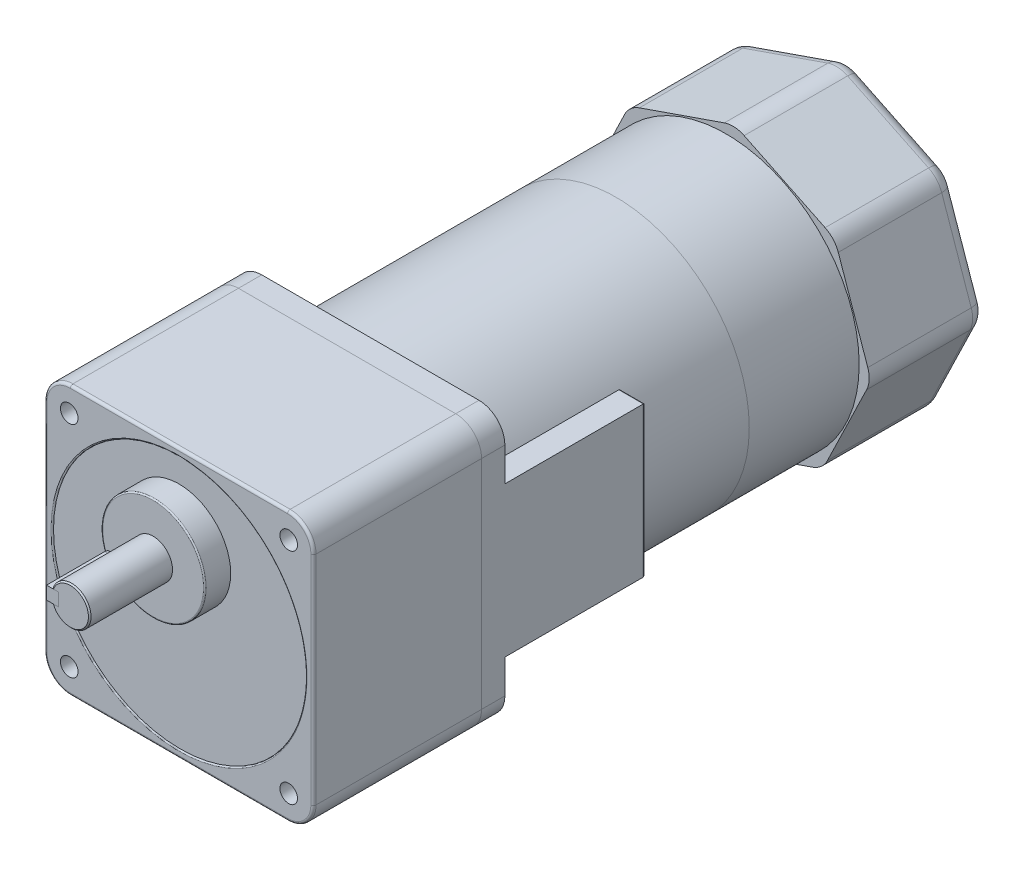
ISO-10303-21;
HEADER;
FILE_DESCRIPTION(('STEP AP214'),'2;1');
FILE_NAME('part.step','',(''),(''),'','','');
FILE_SCHEMA(('AUTOMOTIVE_DESIGN { 1 0 10303 214 1 1 1 1 }'));
ENDSEC;
DATA;
#1=APPLICATION_CONTEXT('core data for automotive mechanical design processes');
#2=APPLICATION_PROTOCOL_DEFINITION('international standard','automotive_design',2000,#1);
#3=PRODUCT_CONTEXT('',#1,'mechanical');
#4=PRODUCT('Part','Part','',(#3));
#5=PRODUCT_RELATED_PRODUCT_CATEGORY('part','',(#4));
#6=PRODUCT_DEFINITION_FORMATION('','',#4);
#7=PRODUCT_DEFINITION_CONTEXT('part definition',#1,'design');
#8=PRODUCT_DEFINITION('design','',#6,#7);
#9=PRODUCT_DEFINITION_SHAPE('','',#8);
#10=(LENGTH_UNIT() NAMED_UNIT(*) SI_UNIT(.MILLI.,.METRE.));
#11=(NAMED_UNIT(*) PLANE_ANGLE_UNIT() SI_UNIT($,.RADIAN.));
#12=(NAMED_UNIT(*) SI_UNIT($,.STERADIAN.) SOLID_ANGLE_UNIT());
#13=UNCERTAINTY_MEASURE_WITH_UNIT(LENGTH_MEASURE(1.E-05),#10,'distance_accuracy_value','');
#14=(GEOMETRIC_REPRESENTATION_CONTEXT(3) GLOBAL_UNCERTAINTY_ASSIGNED_CONTEXT((#13)) GLOBAL_UNIT_ASSIGNED_CONTEXT((#10,
#11,#12)) REPRESENTATION_CONTEXT('',''));
#15=CARTESIAN_POINT('',(0.,0.,0.));
#16=DIRECTION('',(0.,0.,1.));
#17=DIRECTION('',(1.,0.,0.));
#18=AXIS2_PLACEMENT_3D('',#15,#16,#17);
#19=CARTESIAN_POINT('',(-9.5,20.,84.5));
#20=DIRECTION('',(1.,0.,0.));
#21=DIRECTION('',(0.,0.,-1.));
#22=AXIS2_PLACEMENT_3D('',#19,#20,#21);
#23=CYLINDRICAL_SURFACE('',#22,2.5);
#24=DIRECTION('',(1.,0.,0.));
#25=VECTOR('',#24,1.);
#26=CARTESIAN_POINT('',(-9.5,17.5,84.5));
#27=LINE('',#26,#25);
#28=CARTESIAN_POINT('',(-9.20000000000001,17.5,84.5));
#29=VERTEX_POINT('',#28);
#30=CARTESIAN_POINT('',(-4.5,17.5,84.5));
#31=VERTEX_POINT('',#30);
#32=EDGE_CURVE('E102',#29,#31,#27,.T.);
#33=ORIENTED_EDGE('',*,*,#32,.F.);
#34=CARTESIAN_POINT('',(-9.20000000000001,20.,84.5));
#35=DIRECTION('',(-1.,0.,0.));
#36=DIRECTION('',(0.,0.,1.));
#37=AXIS2_PLACEMENT_3D('',#34,#35,#36);
#38=CIRCLE('',#37,2.5);
#39=CARTESIAN_POINT('',(-9.20000000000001,22.5,84.5));
#40=VERTEX_POINT('',#39);
#41=EDGE_CURVE('E12',#29,#40,#38,.F.);
#42=ORIENTED_EDGE('',*,*,#41,.T.);
#43=DIRECTION('',(1.,0.,0.));
#44=VECTOR('',#43,1.);
#45=CARTESIAN_POINT('',(-9.5,22.5,84.5));
#46=LINE('',#45,#44);
#47=CARTESIAN_POINT('',(-4.5,22.5,84.5));
#48=VERTEX_POINT('',#47);
#49=EDGE_CURVE('E122',#40,#48,#46,.T.);
#50=ORIENTED_EDGE('',*,*,#49,.T.);
#51=CARTESIAN_POINT('',(-4.5,20.,84.5));
#52=DIRECTION('',(-1.,0.,0.));
#53=DIRECTION('',(0.,0.,1.));
#54=AXIS2_PLACEMENT_3D('',#51,#52,#53);
#55=CIRCLE('',#54,2.5);
#56=EDGE_CURVE('E117',#48,#31,#55,.T.);
#57=ORIENTED_EDGE('',*,*,#56,.T.);
#58=EDGE_LOOP('',(#33,#42,#50,#57));
#59=FACE_BOUND('',#58,.T.);
#60=ADVANCED_FACE('F50',(#59),#23,.T.);
#61=CARTESIAN_POINT('',(-9.5,17.5,107.));
#62=DIRECTION('',(0.,1.,0.));
#63=DIRECTION('',(0.,0.,1.));
#64=AXIS2_PLACEMENT_3D('',#61,#62,#63);
#65=PLANE('',#64);
#66=DIRECTION('',(1.,0.,0.));
#67=VECTOR('',#66,1.);
#68=CARTESIAN_POINT('',(-9.5,17.5,107.));
#69=LINE('',#68,#67);
#70=CARTESIAN_POINT('',(-9.20000000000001,17.5,107.));
#71=VERTEX_POINT('',#70);
#72=CARTESIAN_POINT('',(-4.5,17.5,107.));
#73=VERTEX_POINT('',#72);
#74=EDGE_CURVE('E111',#71,#73,#69,.T.);
#75=ORIENTED_EDGE('',*,*,#74,.F.);
#76=DIRECTION('',(0.,0.,-1.));
#77=VECTOR('',#76,1.);
#78=CARTESIAN_POINT('',(-9.20000000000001,17.5,84.5));
#79=LINE('',#78,#77);
#80=EDGE_CURVE('E59',#71,#29,#79,.T.);
#81=ORIENTED_EDGE('',*,*,#80,.T.);
#82=ORIENTED_EDGE('',*,*,#32,.T.);
#83=DIRECTION('',(0.,0.,1.));
#84=VECTOR('',#83,1.);
#85=CARTESIAN_POINT('',(-4.5,17.5,107.));
#86=LINE('',#85,#84);
#87=EDGE_CURVE('E105',#31,#73,#86,.T.);
#88=ORIENTED_EDGE('',*,*,#87,.T.);
#89=EDGE_LOOP('',(#75,#81,#82,#88));
#90=FACE_BOUND('',#89,.T.);
#91=ADVANCED_FACE('F104',(#90),#65,.F.);
#92=CARTESIAN_POINT('',(-9.5,22.5,107.));
#93=DIRECTION('',(0.,0.,-1.));
#94=DIRECTION('',(-1.,0.,0.));
#95=AXIS2_PLACEMENT_3D('',#92,#93,#94);
#96=PLANE('',#95);
#97=DIRECTION('',(1.,0.,0.));
#98=VECTOR('',#97,1.);
#99=CARTESIAN_POINT('',(-9.5,22.5,107.));
#100=LINE('',#99,#98);
#101=CARTESIAN_POINT('',(-9.20000000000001,22.5,107.));
#102=VERTEX_POINT('',#101);
#103=CARTESIAN_POINT('',(-4.5,22.5,107.));
#104=VERTEX_POINT('',#103);
#105=EDGE_CURVE('E132',#102,#104,#100,.T.);
#106=ORIENTED_EDGE('',*,*,#105,.F.);
#107=DIRECTION('',(0.,-1.,0.));
#108=VECTOR('',#107,1.);
#109=CARTESIAN_POINT('',(-9.20000000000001,17.5,107.));
#110=LINE('',#109,#108);
#111=EDGE_CURVE('E74',#102,#71,#110,.T.);
#112=ORIENTED_EDGE('',*,*,#111,.T.);
#113=ORIENTED_EDGE('',*,*,#74,.T.);
#114=DIRECTION('',(0.,1.,0.));
#115=VECTOR('',#114,1.);
#116=CARTESIAN_POINT('',(-4.5,22.5,107.));
#117=LINE('',#116,#115);
#118=EDGE_CURVE('E119',#73,#104,#117,.T.);
#119=ORIENTED_EDGE('',*,*,#118,.T.);
#120=EDGE_LOOP('',(#106,#112,#113,#119));
#121=FACE_BOUND('',#120,.T.);
#122=ADVANCED_FACE('F170',(#121),#96,.F.);
#123=CARTESIAN_POINT('',(-9.5,22.5,84.5));
#124=DIRECTION('',(0.,-1.,0.));
#125=DIRECTION('',(0.,0.,-1.));
#126=AXIS2_PLACEMENT_3D('',#123,#124,#125);
#127=PLANE('',#126);
#128=ORIENTED_EDGE('',*,*,#49,.F.);
#129=DIRECTION('',(0.,0.,1.));
#130=VECTOR('',#129,1.);
#131=CARTESIAN_POINT('',(-9.20000000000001,22.5,107.));
#132=LINE('',#131,#130);
#133=EDGE_CURVE('E143',#40,#102,#132,.T.);
#134=ORIENTED_EDGE('',*,*,#133,.T.);
#135=ORIENTED_EDGE('',*,*,#105,.T.);
#136=DIRECTION('',(0.,0.,-1.));
#137=VECTOR('',#136,1.);
#138=CARTESIAN_POINT('',(-4.5,22.5,84.5));
#139=LINE('',#138,#137);
#140=EDGE_CURVE('E129',#104,#48,#139,.T.);
#141=ORIENTED_EDGE('',*,*,#140,.T.);
#142=EDGE_LOOP('',(#128,#134,#135,#141));
#143=FACE_BOUND('',#142,.T.);
#144=ADVANCED_FACE('F169',(#143),#127,.F.);
#145=CARTESIAN_POINT('',(-9.5,20.,84.5));
#146=DIRECTION('',(-1.,0.,0.));
#147=DIRECTION('',(0.,0.,1.));
#148=AXIS2_PLACEMENT_3D('',#145,#146,#147);
#149=PLANE('',#148);
#150=DIRECTION('',(0.,1.,0.));
#151=VECTOR('',#150,1.);
#152=CARTESIAN_POINT('',(-9.5,22.5,106.7));
#153=LINE('',#152,#151);
#154=CARTESIAN_POINT('',(-9.5,17.8,106.7));
#155=VERTEX_POINT('',#154);
#156=CARTESIAN_POINT('',(-9.5,22.2,106.7));
#157=VERTEX_POINT('',#156);
#158=EDGE_CURVE('E138',#155,#157,#153,.T.);
#159=ORIENTED_EDGE('',*,*,#158,.T.);
#160=DIRECTION('',(0.,0.,-1.));
#161=VECTOR('',#160,1.);
#162=CARTESIAN_POINT('',(-9.5,22.2,84.5));
#163=LINE('',#162,#161);
#164=CARTESIAN_POINT('',(-9.5,22.2,84.5));
#165=VERTEX_POINT('',#164);
#166=EDGE_CURVE('E140',#157,#165,#163,.T.);
#167=ORIENTED_EDGE('',*,*,#166,.T.);
#168=CARTESIAN_POINT('',(-9.5,20.,84.5));
#169=DIRECTION('',(-1.,0.,0.));
#170=DIRECTION('',(0.,0.,1.));
#171=AXIS2_PLACEMENT_3D('',#168,#169,#170);
#172=CIRCLE('',#171,2.2);
#173=CARTESIAN_POINT('',(-9.5,17.8,84.5));
#174=VERTEX_POINT('',#173);
#175=EDGE_CURVE('E110',#165,#174,#172,.T.);
#176=ORIENTED_EDGE('',*,*,#175,.T.);
#177=DIRECTION('',(0.,0.,1.));
#178=VECTOR('',#177,1.);
#179=CARTESIAN_POINT('',(-9.5,17.8,107.));
#180=LINE('',#179,#178);
#181=EDGE_CURVE('E136',#174,#155,#180,.T.);
#182=ORIENTED_EDGE('',*,*,#181,.T.);
#183=EDGE_LOOP('',(#159,#167,#176,#182));
#184=FACE_BOUND('',#183,.T.);
#185=ADVANCED_FACE('F162',(#184),#149,.T.);
#186=CARTESIAN_POINT('',(-4.5,20.,84.5));
#187=DIRECTION('',(-1.,0.,0.));
#188=DIRECTION('',(0.,0.,1.));
#189=AXIS2_PLACEMENT_3D('',#186,#187,#188);
#190=PLANE('',#189);
#191=ORIENTED_EDGE('',*,*,#56,.F.);
#192=ORIENTED_EDGE('',*,*,#140,.F.);
#193=ORIENTED_EDGE('',*,*,#118,.F.);
#194=ORIENTED_EDGE('',*,*,#87,.F.);
#195=EDGE_LOOP('',(#191,#192,#193,#194));
#196=FACE_BOUND('',#195,.T.);
#197=ADVANCED_FACE('F115',(#196),#190,.F.);
#198=CARTESIAN_POINT('',(-9.5,17.8,84.5));
#199=DIRECTION('',(-0.707106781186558,-0.707106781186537,0.));
#200=DIRECTION('',(0.,0.,-1.));
#201=AXIS2_PLACEMENT_3D('',#198,#199,#200);
#202=PLANE('',#201);
#203=DIRECTION('',(-0.707106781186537,0.707106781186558,0.));
#204=VECTOR('',#203,1.);
#205=CARTESIAN_POINT('',(-9.20000000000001,17.5,84.5));
#206=LINE('',#205,#204);
#207=EDGE_CURVE('E126',#29,#174,#206,.T.);
#208=ORIENTED_EDGE('',*,*,#207,.F.);
#209=ORIENTED_EDGE('',*,*,#80,.F.);
#210=DIRECTION('',(-0.577350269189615,0.577350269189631,-0.577350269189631));
#211=VECTOR('',#210,1.);
#212=CARTESIAN_POINT('',(-16.8999999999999,25.2000000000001,99.2999999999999));
#213=LINE('',#212,#211);
#214=EDGE_CURVE('E54',#155,#71,#213,.F.);
#215=ORIENTED_EDGE('',*,*,#214,.F.);
#216=ORIENTED_EDGE('',*,*,#181,.F.);
#217=EDGE_LOOP('',(#208,#209,#215,#216));
#218=FACE_BOUND('',#217,.T.);
#219=ADVANCED_FACE('F52',(#218),#202,.T.);
#220=CARTESIAN_POINT('',(-9.5,20.,106.7));
#221=DIRECTION('',(-0.707106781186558,0.,0.707106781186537));
#222=DIRECTION('',(0.,-1.,0.));
#223=AXIS2_PLACEMENT_3D('',#220,#221,#222);
#224=PLANE('',#223);
#225=ORIENTED_EDGE('',*,*,#214,.T.);
#226=ORIENTED_EDGE('',*,*,#111,.F.);
#227=DIRECTION('',(-0.577350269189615,-0.577350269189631,-0.577350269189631));
#228=VECTOR('',#227,1.);
#229=CARTESIAN_POINT('',(-10.2333333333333,21.4666666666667,105.966666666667));
#230=LINE('',#229,#228);
#231=EDGE_CURVE('E150',#157,#102,#230,.F.);
#232=ORIENTED_EDGE('',*,*,#231,.F.);
#233=ORIENTED_EDGE('',*,*,#158,.F.);
#234=EDGE_LOOP('',(#225,#226,#232,#233));
#235=FACE_BOUND('',#234,.T.);
#236=ADVANCED_FACE('F187',(#235),#224,.T.);
#237=CARTESIAN_POINT('',(-9.5,20.,84.5));
#238=DIRECTION('',(1.,0.,0.));
#239=DIRECTION('',(0.,0.,-1.));
#240=AXIS2_PLACEMENT_3D('',#237,#238,#239);
#241=CONICAL_SURFACE('',#240,2.2,0.785398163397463);
#242=ORIENTED_EDGE('',*,*,#207,.T.);
#243=ORIENTED_EDGE('',*,*,#175,.F.);
#244=DIRECTION('',(-0.707106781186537,-0.707106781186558,0.));
#245=VECTOR('',#244,1.);
#246=CARTESIAN_POINT('',(-9.20000000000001,22.5,84.5));
#247=LINE('',#246,#245);
#248=EDGE_CURVE('E148',#40,#165,#247,.T.);
#249=ORIENTED_EDGE('',*,*,#248,.F.);
#250=ORIENTED_EDGE('',*,*,#41,.F.);
#251=EDGE_LOOP('',(#242,#243,#249,#250));
#252=FACE_BOUND('',#251,.T.);
#253=ADVANCED_FACE('F155',(#252),#241,.T.);
#254=CARTESIAN_POINT('',(-9.5,22.2,84.5));
#255=DIRECTION('',(-0.707106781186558,0.707106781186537,0.));
#256=DIRECTION('',(0.,0.,1.));
#257=AXIS2_PLACEMENT_3D('',#254,#255,#256);
#258=PLANE('',#257);
#259=ORIENTED_EDGE('',*,*,#231,.T.);
#260=ORIENTED_EDGE('',*,*,#133,.F.);
#261=ORIENTED_EDGE('',*,*,#248,.T.);
#262=ORIENTED_EDGE('',*,*,#166,.F.);
#263=EDGE_LOOP('',(#259,#260,#261,#262));
#264=FACE_BOUND('',#263,.T.);
#265=ADVANCED_FACE('F166',(#264),#258,.T.);
#266=CLOSED_SHELL('',(#60,#91,#122,#144,#185,#197,#219,#236,#253,#265));
#267=MANIFOLD_SOLID_BREP('B2',#266);
#268=CARTESIAN_POINT('',(0.,20.,107.));
#269=DIRECTION('',(0.,0.,-1.));
#270=DIRECTION('',(-1.,0.,0.));
#271=AXIS2_PLACEMENT_3D('',#268,#269,#270);
#272=CYLINDRICAL_SURFACE('',#271,7.5);
#273=CARTESIAN_POINT('',(0.,20.,75.));
#274=DIRECTION('',(0.,0.,1.));
#275=DIRECTION('',(1.,0.,0.));
#276=AXIS2_PLACEMENT_3D('',#273,#274,#275);
#277=CIRCLE('',#276,7.5);
#278=CARTESIAN_POINT('',(7.5,20.,75.));
#279=VERTEX_POINT('',#278);
#280=EDGE_CURVE('E341',#279,#279,#277,.T.);
#281=ORIENTED_EDGE('',*,*,#280,.T.);
#282=EDGE_LOOP('',(#281));
#283=FACE_BOUND('',#282,.T.);
#284=CARTESIAN_POINT('',(-7.07106781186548,22.5,84.5));
#285=CARTESIAN_POINT('',(-7.07105693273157,22.500008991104,84.4317929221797));
#286=CARTESIAN_POINT('',(-7.07205443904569,22.4972088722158,84.3635919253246));
#287=CARTESIAN_POINT('',(-7.07598524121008,22.4860604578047,84.2277189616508));
#288=CARTESIAN_POINT('',(-7.07891801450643,22.477713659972,84.160046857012));
#289=CARTESIAN_POINT('',(-7.08662705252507,22.455574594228,84.0259095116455));
#290=CARTESIAN_POINT('',(-7.09139784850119,22.4417984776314,83.9594412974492));
#291=CARTESIAN_POINT('',(-7.10262619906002,22.4089418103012,83.8279917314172));
#292=CARTESIAN_POINT('',(-7.10908381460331,22.3898610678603,83.7630104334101));
#293=CARTESIAN_POINT('',(-7.13069940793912,22.324915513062,83.5710384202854));
#294=CARTESIAN_POINT('',(-7.14811243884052,22.2713141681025,83.44682084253));
#295=CARTESIAN_POINT('',(-7.1869703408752,22.1451778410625,83.2091231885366));
#296=CARTESIAN_POINT('',(-7.20841768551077,22.0726312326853,83.0956497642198));
#297=CARTESIAN_POINT('',(-7.25386182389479,21.9076299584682,82.8782070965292));
#298=CARTESIAN_POINT('',(-7.27792189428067,21.8145628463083,82.7747148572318));
#299=CARTESIAN_POINT('',(-7.32534626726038,21.6124707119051,82.5844828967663));
#300=CARTESIAN_POINT('',(-7.34871044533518,21.5034428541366,82.497746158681));
#301=CARTESIAN_POINT('',(-7.39284706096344,21.2690092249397,82.3413017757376));
#302=CARTESIAN_POINT('',(-7.41353593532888,21.1432502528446,82.2720976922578));
#303=CARTESIAN_POINT('',(-7.44924021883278,20.8810730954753,82.1560192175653));
#304=CARTESIAN_POINT('',(-7.46425736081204,20.7446581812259,82.1091380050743));
#305=CARTESIAN_POINT('',(-7.48647677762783,20.4700733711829,82.0406607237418));
#306=CARTESIAN_POINT('',(-7.49393272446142,20.3321295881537,82.0182418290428));
#307=CARTESIAN_POINT('',(-7.50109021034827,20.0542474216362,81.9967092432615));
#308=CARTESIAN_POINT('',(-7.50079359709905,19.9143095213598,81.9975899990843));
#309=CARTESIAN_POINT('',(-7.49265096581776,19.6422403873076,82.0221107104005));
#310=CARTESIAN_POINT('',(-7.48510152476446,19.5100182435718,82.0448565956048));
#311=CARTESIAN_POINT('',(-7.46367401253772,19.2513898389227,82.1109829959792));
#312=CARTESIAN_POINT('',(-7.44979559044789,19.1249839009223,82.1543646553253));
#313=CARTESIAN_POINT('',(-7.41689170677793,18.8796184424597,82.2610534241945));
#314=CARTESIAN_POINT('',(-7.39780094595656,18.760778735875,82.3246151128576));
#315=CARTESIAN_POINT('',(-7.35645969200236,18.5351885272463,82.469649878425));
#316=CARTESIAN_POINT('',(-7.33420833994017,18.4284413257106,82.5511278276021));
#317=CARTESIAN_POINT('',(-7.28765679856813,18.2247566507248,82.734177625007));
#318=CARTESIAN_POINT('',(-7.26330946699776,18.128515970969,82.8365138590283));
#319=CARTESIAN_POINT('',(-7.21618726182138,17.9543199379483,83.0561037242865));
#320=CARTESIAN_POINT('',(-7.19341289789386,17.8763704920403,83.1733621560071));
#321=CARTESIAN_POINT('',(-7.15175078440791,17.7399916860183,83.4217004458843));
#322=CARTESIAN_POINT('',(-7.13292537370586,17.6818674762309,83.5529587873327));
#323=CARTESIAN_POINT('',(-7.10202742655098,17.5888494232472,83.8241174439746));
#324=CARTESIAN_POINT('',(-7.08994423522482,17.5539189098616,83.9640037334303));
#325=CARTESIAN_POINT('',(-7.078413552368,17.5208546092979,84.17104659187));
#326=CARTESIAN_POINT('',(-7.07566669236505,17.5130373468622,84.2366034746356));
#327=CARTESIAN_POINT('',(-7.07199258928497,17.502613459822,84.3680951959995));
#328=CARTESIAN_POINT('',(-7.0710629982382,17.5000001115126,84.434029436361));
#329=CARTESIAN_POINT('',(-7.07106781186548,17.5,84.5));
#330=B_SPLINE_CURVE_WITH_KNOTS('',3,(#284,#285,#286,#287,#288,#289,#290,#291,#292,#293,#294,
#295,#296,#297,#298,#299,#300,#301,#302,#303,#304,#305,#306,#307,#308,#309,#310,#311,#312,#313,
#314,#315,#316,#317,#318,#319,#320,#321,#322,#323,#324,#325,#326,#327,#328,#329),.UNSPECIFIED.,
.F.,.F.,(4,2,2,2,2,2,2,2,2,2,2,2,2,2,2,2,2,2,2,2,2,2,4),(0.,0.204546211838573,0.409037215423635,
0.612924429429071,0.816819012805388,1.22401016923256,1.63145179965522,2.05327864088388,
2.47518051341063,2.90809434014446,3.34087579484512,3.75860278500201,4.176230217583,
4.57747647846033,4.97874498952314,5.38529148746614,5.79194868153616,6.2177173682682,
6.643623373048,7.07581676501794,7.50732520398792,7.70536340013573,7.90314555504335),.UNSPECIFIED.);
#331=CARTESIAN_POINT('',(-7.07106781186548,22.5,84.5));
#332=VERTEX_POINT('',#331);
#333=CARTESIAN_POINT('',(-7.07106781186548,17.5,84.5));
#334=VERTEX_POINT('',#333);
#335=EDGE_CURVE('E48',#332,#334,#330,.T.);
#336=ORIENTED_EDGE('',*,*,#335,.F.);
#337=DIRECTION('',(0.,0.,-1.));
#338=VECTOR('',#337,1.);
#339=CARTESIAN_POINT('',(-7.07106781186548,22.5,107.));
#340=LINE('',#339,#338);
#341=CARTESIAN_POINT('',(-7.07106781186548,22.5,106.5));
#342=VERTEX_POINT('',#341);
#343=EDGE_CURVE('E332',#342,#332,#340,.T.);
#344=ORIENTED_EDGE('',*,*,#343,.F.);
#345=CARTESIAN_POINT('',(0.,20.,106.5));
#346=DIRECTION('',(0.,0.,1.));
#347=DIRECTION('',(1.,0.,0.));
#348=AXIS2_PLACEMENT_3D('',#345,#346,#347);
#349=CIRCLE('',#348,7.5);
#350=CARTESIAN_POINT('',(-7.07106781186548,17.5,106.5));
#351=VERTEX_POINT('',#350);
#352=EDGE_CURVE('E347',#342,#351,#349,.F.);
#353=ORIENTED_EDGE('',*,*,#352,.T.);
#354=DIRECTION('',(0.,0.,-1.));
#355=VECTOR('',#354,1.);
#356=CARTESIAN_POINT('',(-7.07106781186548,17.5,107.));
#357=LINE('',#356,#355);
#358=EDGE_CURVE('E282',#334,#351,#357,.F.);
#359=ORIENTED_EDGE('',*,*,#358,.F.);
#360=EDGE_LOOP('',(#336,#344,#353,#359));
#361=FACE_BOUND('',#360,.T.);
#362=ADVANCED_FACE('F262',(#283,#361),#272,.T.);
#363=CARTESIAN_POINT('',(0.,20.,107.));
#364=DIRECTION('',(0.,0.,1.));
#365=DIRECTION('',(1.,0.,0.));
#366=AXIS2_PLACEMENT_3D('',#363,#364,#365);
#367=PLANE('',#366);
#368=CARTESIAN_POINT('',(0.,20.,107.));
#369=DIRECTION('',(0.,0.,1.));
#370=DIRECTION('',(1.,0.,0.));
#371=AXIS2_PLACEMENT_3D('',#368,#369,#370);
#372=CIRCLE('',#371,7.);
#373=CARTESIAN_POINT('',(-6.53834841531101,17.5,107.));
#374=VERTEX_POINT('',#373);
#375=CARTESIAN_POINT('',(-6.53834841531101,22.5,107.));
#376=VERTEX_POINT('',#375);
#377=EDGE_CURVE('E344',#374,#376,#372,.T.);
#378=ORIENTED_EDGE('',*,*,#377,.T.);
#379=DIRECTION('',(-1.,0.,0.));
#380=VECTOR('',#379,1.);
#381=CARTESIAN_POINT('',(-4.5,22.5,107.));
#382=LINE('',#381,#380);
#383=CARTESIAN_POINT('',(-4.5,22.5,107.));
#384=VERTEX_POINT('',#383);
#385=EDGE_CURVE('E333',#384,#376,#382,.T.);
#386=ORIENTED_EDGE('',*,*,#385,.F.);
#387=DIRECTION('',(0.,-1.,0.));
#388=VECTOR('',#387,1.);
#389=CARTESIAN_POINT('',(-4.5,22.5,107.));
#390=LINE('',#389,#388);
#391=CARTESIAN_POINT('',(-4.5,17.5,107.));
#392=VERTEX_POINT('',#391);
#393=EDGE_CURVE('E320',#384,#392,#390,.T.);
#394=ORIENTED_EDGE('',*,*,#393,.T.);
#395=DIRECTION('',(-1.,0.,0.));
#396=VECTOR('',#395,1.);
#397=CARTESIAN_POINT('',(-4.5,17.5,107.));
#398=LINE('',#397,#396);
#399=EDGE_CURVE('E336',#392,#374,#398,.T.);
#400=ORIENTED_EDGE('',*,*,#399,.T.);
#401=EDGE_LOOP('',(#378,#386,#394,#400));
#402=FACE_BOUND('',#401,.T.);
#403=ADVANCED_FACE('F369',(#402),#367,.T.);
#404=CARTESIAN_POINT('',(0.,20.,107.));
#405=DIRECTION('',(0.,0.,-1.));
#406=DIRECTION('',(-1.,0.,0.));
#407=AXIS2_PLACEMENT_3D('',#404,#405,#406);
#408=CONICAL_SURFACE('',#407,7.,0.785398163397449);
#409=ORIENTED_EDGE('',*,*,#352,.F.);
#410=CARTESIAN_POINT('',(-11.0143547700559,22.5,102.705487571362));
#411=CARTESIAN_POINT('',(-10.6798349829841,22.5,103.031669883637));
#412=CARTESIAN_POINT('',(-10.3449877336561,22.5,103.357518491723));
#413=CARTESIAN_POINT('',(-9.67434994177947,22.5,104.008192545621));
#414=CARTESIAN_POINT('',(-9.3385594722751,22.5,104.333018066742));
#415=CARTESIAN_POINT('',(-8.6658920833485,22.5,104.981151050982));
#416=CARTESIAN_POINT('',(-8.32901590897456,22.5,105.304459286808));
#417=CARTESIAN_POINT('',(-7.65344263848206,22.5,105.949228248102));
#418=CARTESIAN_POINT('',(-7.31474539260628,22.5,106.270688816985));
#419=CARTESIAN_POINT('',(-6.80457575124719,22.5,106.750931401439));
#420=CARTESIAN_POINT('',(-6.6340879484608,22.5,106.910759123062));
#421=CARTESIAN_POINT('',(-6.29229590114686,22.5,107.229536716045));
#422=CARTESIAN_POINT('',(-6.12099166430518,22.5,107.38848659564));
#423=CARTESIAN_POINT('',(-5.77739778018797,22.5,107.705248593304));
#424=CARTESIAN_POINT('',(-5.60510833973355,22.5,107.863060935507));
#425=CARTESIAN_POINT('',(-5.25922656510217,22.5,108.177266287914));
#426=CARTESIAN_POINT('',(-5.08563418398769,22.5,108.333659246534));
#427=CARTESIAN_POINT('',(-4.73662813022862,22.5,108.644687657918));
#428=CARTESIAN_POINT('',(-4.56121310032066,22.5,108.799321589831));
#429=CARTESIAN_POINT('',(-4.20817217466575,22.5,109.106020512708));
#430=CARTESIAN_POINT('',(-4.03054650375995,22.5,109.258085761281));
#431=CARTESIAN_POINT('',(-3.76176911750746,22.5,109.483525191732));
#432=CARTESIAN_POINT('',(-3.67175442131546,22.5,109.558254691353));
#433=CARTESIAN_POINT('',(-3.49082532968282,22.5,109.706612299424));
#434=CARTESIAN_POINT('',(-3.399910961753,22.5,109.78024044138));
#435=CARTESIAN_POINT('',(-3.21698494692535,22.5,109.926189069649));
#436=CARTESIAN_POINT('',(-3.12497293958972,22.5,109.998509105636));
#437=CARTESIAN_POINT('',(-2.93965183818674,22.5,110.14148620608));
#438=CARTESIAN_POINT('',(-2.84634260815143,22.5,110.212143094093));
#439=CARTESIAN_POINT('',(-2.75227945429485,22.5,110.281795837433));
#440=B_SPLINE_CURVE_WITH_KNOTS('',3,(#410,#411,#412,#413,#414,#415,#416,#417,#418,#419,#420,
#421,#422,#423,#424,#425,#426,#427,#428,#429,#430,#431,#432,#433,#434,#435,#436,#437,#438,#439),
.UNSPECIFIED.,.F.,.F.,(4,2,2,2,2,2,2,2,2,2,2,2,2,2,4),(0.,1.4016744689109,2.80324322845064,
4.20399722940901,5.60486824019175,6.30593577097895,7.00699671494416,7.70791552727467,
8.40885971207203,9.11036980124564,9.81180911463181,10.1627784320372,10.5137370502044,
10.864814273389,11.2159285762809),.UNSPECIFIED.);
#441=EDGE_CURVE('E275',#342,#376,#440,.T.);
#442=ORIENTED_EDGE('',*,*,#441,.T.);
#443=ORIENTED_EDGE('',*,*,#377,.F.);
#444=CARTESIAN_POINT('',(-2.75227945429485,17.5,110.281795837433));
#445=CARTESIAN_POINT('',(-2.82551522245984,17.5,110.227577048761));
#446=CARTESIAN_POINT('',(-2.89828844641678,17.5,110.172740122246));
#447=CARTESIAN_POINT('',(-3.043018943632,17.5,110.062008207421));
#448=CARTESIAN_POINT('',(-3.11497626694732,17.5,110.006113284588));
#449=CARTESIAN_POINT('',(-3.32976761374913,17.5,109.837125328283));
#450=CARTESIAN_POINT('',(-3.47155558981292,17.5,109.722703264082));
#451=CARTESIAN_POINT('',(-3.75292181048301,17.5,109.491337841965));
#452=CARTESIAN_POINT('',(-3.8925011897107,17.5,109.3743958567));
#453=CARTESIAN_POINT('',(-4.17001061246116,17.5,109.138555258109));
#454=CARTESIAN_POINT('',(-4.30794054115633,17.5,109.019656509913));
#455=CARTESIAN_POINT('',(-4.5823789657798,17.5,108.78045226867));
#456=CARTESIAN_POINT('',(-4.71888850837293,17.5,108.660147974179));
#457=CARTESIAN_POINT('',(-4.99085017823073,17.5,108.418358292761));
#458=CARTESIAN_POINT('',(-5.1263023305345,17.5,108.296872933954));
#459=CARTESIAN_POINT('',(-5.5314179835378,17.5,107.930975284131));
#460=CARTESIAN_POINT('',(-5.79980668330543,17.5,107.685151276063));
#461=CARTESIAN_POINT('',(-6.14300557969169,17.5,107.367828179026));
#462=CARTESIAN_POINT('',(-6.21888659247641,17.5,107.297480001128));
#463=CARTESIAN_POINT('',(-6.37047314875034,17.5,107.156598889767));
#464=CARTESIAN_POINT('',(-6.44617869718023,17.5,107.086065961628));
#465=CARTESIAN_POINT('',(-6.67307720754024,17.5,106.874199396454));
#466=CARTESIAN_POINT('',(-6.8240348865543,17.5,106.732613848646));
#467=CARTESIAN_POINT('',(-7.31490063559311,17.5,106.27054247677));
#468=CARTESIAN_POINT('',(-7.65375215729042,17.5,105.948934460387));
#469=CARTESIAN_POINT('',(-8.32966336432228,17.5,105.30383974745));
#470=CARTESIAN_POINT('',(-8.66672303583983,17.5,104.98035303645));
#471=CARTESIAN_POINT('',(-9.3394195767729,17.5,104.332186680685));
#472=CARTESIAN_POINT('',(-9.67505698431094,17.5,104.00750759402));
#473=CARTESIAN_POINT('',(-10.3453568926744,17.5,103.357159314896));
#474=CARTESIAN_POINT('',(-10.6800194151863,17.5,103.031490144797));
#475=CARTESIAN_POINT('',(-11.0143547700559,17.5,102.705487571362));
#476=B_SPLINE_CURVE_WITH_KNOTS('',3,(#444,#445,#446,#447,#448,#449,#450,#451,#452,#453,#454,
#455,#456,#457,#458,#459,#460,#461,#462,#463,#464,#465,#466,#467,#468,#469,#470,#471,#472,#473,
#474,#475),.UNSPECIFIED.,.F.,.F.,(4,2,2,2,2,2,2,2,2,2,2,2,2,2,2,4),(0.,0.273355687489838,
0.546694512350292,1.09324270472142,1.63950035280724,2.18579581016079,2.73165523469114,
3.27750169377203,4.36933033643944,4.67975144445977,4.99016370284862,5.61105831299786,
7.01256945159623,8.41409138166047,9.81502466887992,11.215926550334),.UNSPECIFIED.);
#477=EDGE_CURVE('E350',#374,#351,#476,.T.);
#478=ORIENTED_EDGE('',*,*,#477,.T.);
#479=EDGE_LOOP('',(#409,#442,#443,#478));
#480=FACE_BOUND('',#479,.T.);
#481=ADVANCED_FACE('F264',(#480),#408,.T.);
#482=CARTESIAN_POINT('',(0.,20.,75.));
#483=DIRECTION('',(0.,0.,1.));
#484=DIRECTION('',(1.,0.,0.));
#485=AXIS2_PLACEMENT_3D('',#482,#483,#484);
#486=PLANE('',#485);
#487=ORIENTED_EDGE('',*,*,#280,.F.);
#488=EDGE_LOOP('',(#487));
#489=FACE_BOUND('',#488,.T.);
#490=ADVANCED_FACE('F368',(#489),#486,.F.);
#491=CARTESIAN_POINT('',(-4.5,20.,84.5));
#492=DIRECTION('',(-1.,0.,0.));
#493=DIRECTION('',(0.,0.,1.));
#494=AXIS2_PLACEMENT_3D('',#491,#492,#493);
#495=CYLINDRICAL_SURFACE('',#494,2.5);
#496=DIRECTION('',(-1.,0.,0.));
#497=VECTOR('',#496,1.);
#498=CARTESIAN_POINT('',(-4.5,22.5,84.5));
#499=LINE('',#498,#497);
#500=CARTESIAN_POINT('',(-4.5,22.5,84.5));
#501=VERTEX_POINT('',#500);
#502=EDGE_CURVE('E328',#501,#332,#499,.T.);
#503=ORIENTED_EDGE('',*,*,#502,.T.);
#504=ORIENTED_EDGE('',*,*,#335,.T.);
#505=DIRECTION('',(-1.,0.,0.));
#506=VECTOR('',#505,1.);
#507=CARTESIAN_POINT('',(-4.5,17.5,84.5));
#508=LINE('',#507,#506);
#509=CARTESIAN_POINT('',(-4.5,17.5,84.5));
#510=VERTEX_POINT('',#509);
#511=EDGE_CURVE('E329',#510,#334,#508,.T.);
#512=ORIENTED_EDGE('',*,*,#511,.F.);
#513=CARTESIAN_POINT('',(-4.5,20.,84.5));
#514=DIRECTION('',(1.,0.,0.));
#515=DIRECTION('',(0.,0.,-1.));
#516=AXIS2_PLACEMENT_3D('',#513,#514,#515);
#517=CIRCLE('',#516,2.5);
#518=EDGE_CURVE('E318',#510,#501,#517,.T.);
#519=ORIENTED_EDGE('',*,*,#518,.T.);
#520=EDGE_LOOP('',(#503,#504,#512,#519));
#521=FACE_BOUND('',#520,.T.);
#522=ADVANCED_FACE('F327',(#521),#495,.F.);
#523=CARTESIAN_POINT('',(-4.5,22.5,84.5));
#524=DIRECTION('',(0.,-1.,0.));
#525=DIRECTION('',(0.,0.,-1.));
#526=AXIS2_PLACEMENT_3D('',#523,#524,#525);
#527=PLANE('',#526);
#528=ORIENTED_EDGE('',*,*,#343,.T.);
#529=ORIENTED_EDGE('',*,*,#502,.F.);
#530=DIRECTION('',(0.,0.,1.));
#531=VECTOR('',#530,1.);
#532=CARTESIAN_POINT('',(-4.5,22.5,84.5));
#533=LINE('',#532,#531);
#534=EDGE_CURVE('E314',#501,#384,#533,.T.);
#535=ORIENTED_EDGE('',*,*,#534,.T.);
#536=ORIENTED_EDGE('',*,*,#385,.T.);
#537=ORIENTED_EDGE('',*,*,#441,.F.);
#538=EDGE_LOOP('',(#528,#529,#535,#536,#537));
#539=FACE_BOUND('',#538,.T.);
#540=ADVANCED_FACE('F331',(#539),#527,.T.);
#541=CARTESIAN_POINT('',(-4.5,17.5,107.));
#542=DIRECTION('',(0.,1.,0.));
#543=DIRECTION('',(0.,0.,1.));
#544=AXIS2_PLACEMENT_3D('',#541,#542,#543);
#545=PLANE('',#544);
#546=ORIENTED_EDGE('',*,*,#358,.T.);
#547=ORIENTED_EDGE('',*,*,#477,.F.);
#548=ORIENTED_EDGE('',*,*,#399,.F.);
#549=DIRECTION('',(0.,0.,-1.));
#550=VECTOR('',#549,1.);
#551=CARTESIAN_POINT('',(-4.5,17.5,107.));
#552=LINE('',#551,#550);
#553=EDGE_CURVE('E383',#392,#510,#552,.T.);
#554=ORIENTED_EDGE('',*,*,#553,.T.);
#555=ORIENTED_EDGE('',*,*,#511,.T.);
#556=EDGE_LOOP('',(#546,#547,#548,#554,#555));
#557=FACE_BOUND('',#556,.T.);
#558=ADVANCED_FACE('F359',(#557),#545,.T.);
#559=CARTESIAN_POINT('',(-4.5,20.,84.5));
#560=DIRECTION('',(1.,0.,0.));
#561=DIRECTION('',(0.,0.,-1.));
#562=AXIS2_PLACEMENT_3D('',#559,#560,#561);
#563=PLANE('',#562);
#564=ORIENTED_EDGE('',*,*,#518,.F.);
#565=ORIENTED_EDGE('',*,*,#553,.F.);
#566=ORIENTED_EDGE('',*,*,#393,.F.);
#567=ORIENTED_EDGE('',*,*,#534,.F.);
#568=EDGE_LOOP('',(#564,#565,#566,#567));
#569=FACE_BOUND('',#568,.T.);
#570=ADVANCED_FACE('F316',(#569),#563,.F.);
#571=CLOSED_SHELL('',(#362,#403,#481,#490,#522,#540,#558,#570));
#572=MANIFOLD_SOLID_BREP('B6',#571);
#573=CARTESIAN_POINT('',(0.,20.,75.));
#574=DIRECTION('',(0.,0.,-1.));
#575=DIRECTION('',(-1.,0.,0.));
#576=AXIS2_PLACEMENT_3D('',#573,#574,#575);
#577=CYLINDRICAL_SURFACE('',#576,20.);
#578=CARTESIAN_POINT('',(0.,20.,74.5));
#579=DIRECTION('',(0.,0.,1.));
#580=DIRECTION('',(1.,0.,0.));
#581=AXIS2_PLACEMENT_3D('',#578,#579,#580);
#582=CIRCLE('',#581,20.);
#583=CARTESIAN_POINT('',(20.,20.,74.5));
#584=VERTEX_POINT('',#583);
#585=EDGE_CURVE('E261',#584,#584,#582,.F.);
#586=ORIENTED_EDGE('',*,*,#585,.T.);
#587=EDGE_LOOP('',(#586));
#588=FACE_BOUND('',#587,.T.);
#589=CARTESIAN_POINT('',(0.,20.,65.));
#590=DIRECTION('',(0.,0.,1.));
#591=DIRECTION('',(1.,0.,0.));
#592=AXIS2_PLACEMENT_3D('',#589,#590,#591);
#593=CIRCLE('',#592,20.);
#594=CARTESIAN_POINT('',(20.,20.,65.));
#595=VERTEX_POINT('',#594);
#596=EDGE_CURVE('E463',#595,#595,#593,.T.);
#597=ORIENTED_EDGE('',*,*,#596,.T.);
#598=EDGE_LOOP('',(#597));
#599=FACE_BOUND('',#598,.T.);
#600=ADVANCED_FACE('F452',(#588,#599),#577,.T.);
#601=CARTESIAN_POINT('',(0.,20.,75.));
#602=DIRECTION('',(0.,0.,1.));
#603=DIRECTION('',(1.,0.,0.));
#604=AXIS2_PLACEMENT_3D('',#601,#602,#603);
#605=PLANE('',#604);
#606=CARTESIAN_POINT('',(0.,20.,75.));
#607=DIRECTION('',(0.,0.,1.));
#608=DIRECTION('',(1.,0.,0.));
#609=AXIS2_PLACEMENT_3D('',#606,#607,#608);
#610=CIRCLE('',#609,19.5);
#611=CARTESIAN_POINT('',(19.5,20.,75.));
#612=VERTEX_POINT('',#611);
#613=EDGE_CURVE('E459',#612,#612,#610,.T.);
#614=ORIENTED_EDGE('',*,*,#613,.T.);
#615=EDGE_LOOP('',(#614));
#616=FACE_BOUND('',#615,.T.);
#617=ADVANCED_FACE('F473',(#616),#605,.T.);
#618=CARTESIAN_POINT('',(0.,20.,65.));
#619=DIRECTION('',(0.,0.,1.));
#620=DIRECTION('',(1.,0.,0.));
#621=AXIS2_PLACEMENT_3D('',#618,#619,#620);
#622=PLANE('',#621);
#623=ORIENTED_EDGE('',*,*,#596,.F.);
#624=EDGE_LOOP('',(#623));
#625=FACE_BOUND('',#624,.T.);
#626=ADVANCED_FACE('F471',(#625),#622,.F.);
#627=CARTESIAN_POINT('',(0.,20.,74.5));
#628=DIRECTION('',(0.,0.,1.));
#629=DIRECTION('',(1.,0.,0.));
#630=AXIS2_PLACEMENT_3D('',#627,#628,#629);
#631=TOROIDAL_SURFACE('',#630,19.5,0.5);
#632=ORIENTED_EDGE('',*,*,#585,.F.);
#633=EDGE_LOOP('',(#632));
#634=FACE_BOUND('',#633,.T.);
#635=ORIENTED_EDGE('',*,*,#613,.F.);
#636=EDGE_LOOP('',(#635));
#637=FACE_BOUND('',#636,.T.);
#638=ADVANCED_FACE('F454',(#634,#637),#631,.T.);
#639=CLOSED_SHELL('',(#600,#617,#626,#638));
#640=MANIFOLD_SOLID_BREP('B42',#639);
#641=CARTESIAN_POINT('',(45.3825112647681,-2.66124468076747,-191.5));
#642=DIRECTION('',(0.,0.,1.));
#643=DIRECTION('',(1.,0.,0.));
#644=AXIS2_PLACEMENT_3D('',#641,#642,#643);
#645=CYLINDRICAL_SURFACE('',#644,10.);
#646=DIRECTION('',(0.,0.,1.));
#647=VECTOR('',#646,1.);
#648=CARTESIAN_POINT('',(54.3814408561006,-7.02235305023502,-191.5));
#649=LINE('',#648,#647);
#650=CARTESIAN_POINT('',(54.3814408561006,-7.02235305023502,-186.5));
#651=VERTEX_POINT('',#650);
#652=CARTESIAN_POINT('',(54.3814408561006,-7.02235305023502,-146.5));
#653=VERTEX_POINT('',#652);
#654=EDGE_CURVE('E676',#651,#653,#649,.T.);
#655=ORIENTED_EDGE('',*,*,#654,.F.);
#656=CARTESIAN_POINT('',(45.3825112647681,-2.66124468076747,-186.5));
#657=DIRECTION('',(0.,0.,-1.));
#658=DIRECTION('',(-1.,0.,0.));
#659=AXIS2_PLACEMENT_3D('',#656,#657,#658);
#660=CIRCLE('',#659,10.);
#661=CARTESIAN_POINT('',(54.8294847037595,0.618190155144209,-186.5));
#662=VERTEX_POINT('',#661);
#663=EDGE_CURVE('E450',#651,#662,#660,.F.);
#664=ORIENTED_EDGE('',*,*,#663,.T.);
#665=DIRECTION('',(0.,0.,1.));
#666=VECTOR('',#665,1.);
#667=CARTESIAN_POINT('',(54.8294847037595,0.618190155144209,-191.5));
#668=LINE('',#667,#666);
#669=CARTESIAN_POINT('',(54.8294847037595,0.618190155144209,-146.5));
#670=VERTEX_POINT('',#669);
#671=EDGE_CURVE('E697',#662,#670,#668,.T.);
#672=ORIENTED_EDGE('',*,*,#671,.T.);
#673=CARTESIAN_POINT('',(45.3825112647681,-2.66124468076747,-146.5));
#674=DIRECTION('',(0.,0.,-1.));
#675=DIRECTION('',(-1.,0.,0.));
#676=AXIS2_PLACEMENT_3D('',#673,#674,#675);
#677=CIRCLE('',#676,10.);
#678=EDGE_CURVE('E691',#670,#653,#677,.T.);
#679=ORIENTED_EDGE('',*,*,#678,.T.);
#680=EDGE_LOOP('',(#655,#664,#672,#679));
#681=FACE_BOUND('',#680,.T.);
#682=ADVANCED_FACE('F516',(#681),#645,.T.);
#683=CARTESIAN_POINT('',(54.3814408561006,-7.02235305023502,-191.5));
#684=DIRECTION('',(-0.899892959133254,0.436110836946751,0.));
#685=DIRECTION('',(-0.436110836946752,-0.899892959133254,0.));
#686=AXIS2_PLACEMENT_3D('',#683,#684,#685);
#687=PLANE('',#686);
#688=DIRECTION('',(0.,0.,1.));
#689=VECTOR('',#688,1.);
#690=CARTESIAN_POINT('',(39.2074268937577,-38.3331739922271,-191.5));
#691=LINE('',#690,#689);
#692=CARTESIAN_POINT('',(39.2074268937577,-38.3331739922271,-186.5));
#693=VERTEX_POINT('',#692);
#694=CARTESIAN_POINT('',(39.2074268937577,-38.3331739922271,-146.5));
#695=VERTEX_POINT('',#694);
#696=EDGE_CURVE('E685',#693,#695,#691,.T.);
#697=ORIENTED_EDGE('',*,*,#696,.F.);
#698=DIRECTION('',(-0.436110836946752,-0.899892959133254,0.));
#699=VECTOR('',#698,1.);
#700=CARTESIAN_POINT('',(54.3814408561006,-7.02235305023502,-186.5));
#701=LINE('',#700,#699);
#702=EDGE_CURVE('E525',#693,#651,#701,.F.);
#703=ORIENTED_EDGE('',*,*,#702,.T.);
#704=ORIENTED_EDGE('',*,*,#654,.T.);
#705=DIRECTION('',(-0.436110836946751,-0.899892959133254,0.));
#706=VECTOR('',#705,1.);
#707=CARTESIAN_POINT('',(54.3814408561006,-7.02235305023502,-146.5));
#708=LINE('',#707,#706);
#709=EDGE_CURVE('E679',#653,#695,#708,.T.);
#710=ORIENTED_EDGE('',*,*,#709,.T.);
#711=EDGE_LOOP('',(#697,#703,#704,#710));
#712=FACE_BOUND('',#711,.T.);
#713=ADVANCED_FACE('F678',(#712),#687,.F.);
#714=CARTESIAN_POINT('',(30.2084973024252,-33.9720656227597,-191.5));
#715=DIRECTION('',(0.,0.,1.));
#716=DIRECTION('',(1.,0.,0.));
#717=AXIS2_PLACEMENT_3D('',#714,#715,#716);
#718=CYLINDRICAL_SURFACE('',#717,10.);
#719=DIRECTION('',(0.,0.,1.));
#720=VECTOR('',#719,1.);
#721=CARTESIAN_POINT('',(33.4879321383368,-43.4190390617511,-191.5));
#722=LINE('',#721,#720);
#723=CARTESIAN_POINT('',(33.4879321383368,-43.4190390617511,-186.5));
#724=VERTEX_POINT('',#723);
#725=CARTESIAN_POINT('',(33.4879321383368,-43.4190390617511,-146.5));
#726=VERTEX_POINT('',#725);
#727=EDGE_CURVE('E767',#724,#726,#722,.T.);
#728=ORIENTED_EDGE('',*,*,#727,.F.);
#729=CARTESIAN_POINT('',(30.2084973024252,-33.9720656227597,-186.5));
#730=DIRECTION('',(0.,0.,-1.));
#731=DIRECTION('',(-1.,0.,0.));
#732=AXIS2_PLACEMENT_3D('',#729,#730,#731);
#733=CIRCLE('',#732,10.);
#734=EDGE_CURVE('E540',#724,#693,#733,.F.);
#735=ORIENTED_EDGE('',*,*,#734,.T.);
#736=ORIENTED_EDGE('',*,*,#696,.T.);
#737=CARTESIAN_POINT('',(30.2084973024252,-33.9720656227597,-146.5));
#738=DIRECTION('',(0.,0.,-1.));
#739=DIRECTION('',(-1.,0.,0.));
#740=AXIS2_PLACEMENT_3D('',#737,#738,#739);
#741=CIRCLE('',#740,10.);
#742=EDGE_CURVE('E694',#695,#726,#741,.T.);
#743=ORIENTED_EDGE('',*,*,#742,.T.);
#744=EDGE_LOOP('',(#728,#735,#736,#743));
#745=FACE_BOUND('',#744,.T.);
#746=ADVANCED_FACE('F1005',(#745),#718,.T.);
#747=CARTESIAN_POINT('',(33.4879321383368,-43.4190390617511,-191.5));
#748=DIRECTION('',(-0.327943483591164,0.944697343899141,0.));
#749=DIRECTION('',(-0.944697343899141,-0.327943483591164,0.));
#750=AXIS2_PLACEMENT_3D('',#747,#748,#749);
#751=PLANE('',#750);
#752=DIRECTION('',(0.,0.,1.));
#753=VECTOR('',#752,1.);
#754=CARTESIAN_POINT('',(0.618190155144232,-54.8294847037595,-191.5));
#755=LINE('',#754,#753);
#756=CARTESIAN_POINT('',(0.618190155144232,-54.8294847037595,-186.5));
#757=VERTEX_POINT('',#756);
#758=CARTESIAN_POINT('',(0.618190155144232,-54.8294847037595,-146.5));
#759=VERTEX_POINT('',#758);
#760=EDGE_CURVE('E765',#757,#759,#755,.T.);
#761=ORIENTED_EDGE('',*,*,#760,.F.);
#762=DIRECTION('',(-0.944697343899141,-0.327943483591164,0.));
#763=VECTOR('',#762,1.);
#764=CARTESIAN_POINT('',(33.4879321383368,-43.4190390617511,-186.5));
#765=LINE('',#764,#763);
#766=EDGE_CURVE('E827',#757,#724,#765,.F.);
#767=ORIENTED_EDGE('',*,*,#766,.T.);
#768=ORIENTED_EDGE('',*,*,#727,.T.);
#769=DIRECTION('',(-0.944697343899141,-0.327943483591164,0.));
#770=VECTOR('',#769,1.);
#771=CARTESIAN_POINT('',(33.4879321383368,-43.4190390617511,-146.5));
#772=LINE('',#771,#770);
#773=EDGE_CURVE('E704',#726,#759,#772,.T.);
#774=ORIENTED_EDGE('',*,*,#773,.T.);
#775=EDGE_LOOP('',(#761,#767,#768,#774));
#776=FACE_BOUND('',#775,.T.);
#777=ADVANCED_FACE('F901',(#776),#751,.F.);
#778=CARTESIAN_POINT('',(-2.66124468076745,-45.3825112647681,-191.5));
#779=DIRECTION('',(0.,0.,1.));
#780=DIRECTION('',(1.,0.,0.));
#781=AXIS2_PLACEMENT_3D('',#778,#779,#780);
#782=CYLINDRICAL_SURFACE('',#781,10.);
#783=DIRECTION('',(0.,0.,1.));
#784=VECTOR('',#783,1.);
#785=CARTESIAN_POINT('',(-7.022353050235,-54.3814408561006,-191.5));
#786=LINE('',#785,#784);
#787=CARTESIAN_POINT('',(-7.022353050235,-54.3814408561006,-186.5));
#788=VERTEX_POINT('',#787);
#789=CARTESIAN_POINT('',(-7.022353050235,-54.3814408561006,-146.5));
#790=VERTEX_POINT('',#789);
#791=EDGE_CURVE('E763',#788,#790,#786,.T.);
#792=ORIENTED_EDGE('',*,*,#791,.F.);
#793=CARTESIAN_POINT('',(-2.66124468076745,-45.3825112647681,-186.5));
#794=DIRECTION('',(0.,0.,-1.));
#795=DIRECTION('',(-1.,0.,0.));
#796=AXIS2_PLACEMENT_3D('',#793,#794,#795);
#797=CIRCLE('',#796,10.);
#798=EDGE_CURVE('E825',#788,#757,#797,.F.);
#799=ORIENTED_EDGE('',*,*,#798,.T.);
#800=ORIENTED_EDGE('',*,*,#760,.T.);
#801=CARTESIAN_POINT('',(-2.66124468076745,-45.3825112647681,-146.5));
#802=DIRECTION('',(0.,0.,-1.));
#803=DIRECTION('',(-1.,0.,0.));
#804=AXIS2_PLACEMENT_3D('',#801,#802,#803);
#805=CIRCLE('',#804,10.);
#806=EDGE_CURVE('E707',#759,#790,#805,.T.);
#807=ORIENTED_EDGE('',*,*,#806,.T.);
#808=EDGE_LOOP('',(#792,#799,#800,#807));
#809=FACE_BOUND('',#808,.T.);
#810=ADVANCED_FACE('F899',(#809),#782,.T.);
#811=CARTESIAN_POINT('',(-7.022353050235,-54.3814408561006,-191.5));
#812=DIRECTION('',(0.436110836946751,0.899892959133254,0.));
#813=DIRECTION('',(-0.899892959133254,0.436110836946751,0.));
#814=AXIS2_PLACEMENT_3D('',#811,#812,#813);
#815=PLANE('',#814);
#816=DIRECTION('',(0.,0.,1.));
#817=VECTOR('',#816,1.);
#818=CARTESIAN_POINT('',(-38.3331739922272,-39.2074268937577,-191.5));
#819=LINE('',#818,#817);
#820=CARTESIAN_POINT('',(-38.3331739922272,-39.2074268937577,-186.5));
#821=VERTEX_POINT('',#820);
#822=CARTESIAN_POINT('',(-38.3331739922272,-39.2074268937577,-146.5));
#823=VERTEX_POINT('',#822);
#824=EDGE_CURVE('E761',#821,#823,#819,.T.);
#825=ORIENTED_EDGE('',*,*,#824,.F.);
#826=DIRECTION('',(-0.899892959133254,0.436110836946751,0.));
#827=VECTOR('',#826,1.);
#828=CARTESIAN_POINT('',(-7.022353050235,-54.3814408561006,-186.5));
#829=LINE('',#828,#827);
#830=EDGE_CURVE('E823',#821,#788,#829,.F.);
#831=ORIENTED_EDGE('',*,*,#830,.T.);
#832=ORIENTED_EDGE('',*,*,#791,.T.);
#833=DIRECTION('',(-0.899892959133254,0.436110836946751,0.));
#834=VECTOR('',#833,1.);
#835=CARTESIAN_POINT('',(-7.022353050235,-54.3814408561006,-146.5));
#836=LINE('',#835,#834);
#837=EDGE_CURVE('E710',#790,#823,#836,.T.);
#838=ORIENTED_EDGE('',*,*,#837,.T.);
#839=EDGE_LOOP('',(#825,#831,#832,#838));
#840=FACE_BOUND('',#839,.T.);
#841=ADVANCED_FACE('F908',(#840),#815,.F.);
#842=CARTESIAN_POINT('',(-33.9720656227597,-30.2084973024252,-191.5));
#843=DIRECTION('',(0.,0.,1.));
#844=DIRECTION('',(1.,0.,0.));
#845=AXIS2_PLACEMENT_3D('',#842,#843,#844);
#846=CYLINDRICAL_SURFACE('',#845,10.);
#847=DIRECTION('',(0.,0.,1.));
#848=VECTOR('',#847,1.);
#849=CARTESIAN_POINT('',(-43.4190390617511,-33.4879321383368,-191.5));
#850=LINE('',#849,#848);
#851=CARTESIAN_POINT('',(-43.4190390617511,-33.4879321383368,-186.5));
#852=VERTEX_POINT('',#851);
#853=CARTESIAN_POINT('',(-43.4190390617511,-33.4879321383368,-146.5));
#854=VERTEX_POINT('',#853);
#855=EDGE_CURVE('E759',#852,#854,#850,.T.);
#856=ORIENTED_EDGE('',*,*,#855,.F.);
#857=CARTESIAN_POINT('',(-33.9720656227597,-30.2084973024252,-186.5));
#858=DIRECTION('',(0.,0.,-1.));
#859=DIRECTION('',(-1.,0.,0.));
#860=AXIS2_PLACEMENT_3D('',#857,#858,#859);
#861=CIRCLE('',#860,10.);
#862=EDGE_CURVE('E821',#852,#821,#861,.F.);
#863=ORIENTED_EDGE('',*,*,#862,.T.);
#864=ORIENTED_EDGE('',*,*,#824,.T.);
#865=CARTESIAN_POINT('',(-33.9720656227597,-30.2084973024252,-146.5));
#866=DIRECTION('',(0.,0.,-1.));
#867=DIRECTION('',(-1.,0.,0.));
#868=AXIS2_PLACEMENT_3D('',#865,#866,#867);
#869=CIRCLE('',#868,10.);
#870=EDGE_CURVE('E713',#823,#854,#869,.T.);
#871=ORIENTED_EDGE('',*,*,#870,.T.);
#872=EDGE_LOOP('',(#856,#863,#864,#871));
#873=FACE_BOUND('',#872,.T.);
#874=ADVANCED_FACE('F911',(#873),#846,.T.);
#875=CARTESIAN_POINT('',(-43.4190390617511,-33.4879321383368,-191.5));
#876=DIRECTION('',(0.944697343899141,0.327943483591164,0.));
#877=DIRECTION('',(-0.327943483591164,0.944697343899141,0.));
#878=AXIS2_PLACEMENT_3D('',#875,#876,#877);
#879=PLANE('',#878);
#880=DIRECTION('',(0.,0.,1.));
#881=VECTOR('',#880,1.);
#882=CARTESIAN_POINT('',(-54.8294847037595,-0.618190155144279,-191.5));
#883=LINE('',#882,#881);
#884=CARTESIAN_POINT('',(-54.8294847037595,-0.618190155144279,-186.5));
#885=VERTEX_POINT('',#884);
#886=CARTESIAN_POINT('',(-54.8294847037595,-0.618190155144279,-146.5));
#887=VERTEX_POINT('',#886);
#888=EDGE_CURVE('E757',#885,#887,#883,.T.);
#889=ORIENTED_EDGE('',*,*,#888,.F.);
#890=DIRECTION('',(-0.327943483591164,0.944697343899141,0.));
#891=VECTOR('',#890,1.);
#892=CARTESIAN_POINT('',(-43.4190390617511,-33.4879321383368,-186.5));
#893=LINE('',#892,#891);
#894=EDGE_CURVE('E819',#885,#852,#893,.F.);
#895=ORIENTED_EDGE('',*,*,#894,.T.);
#896=ORIENTED_EDGE('',*,*,#855,.T.);
#897=DIRECTION('',(-0.327943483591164,0.944697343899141,0.));
#898=VECTOR('',#897,1.);
#899=CARTESIAN_POINT('',(-43.4190390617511,-33.4879321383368,-146.5));
#900=LINE('',#899,#898);
#901=EDGE_CURVE('E716',#854,#887,#900,.T.);
#902=ORIENTED_EDGE('',*,*,#901,.T.);
#903=EDGE_LOOP('',(#889,#895,#896,#902));
#904=FACE_BOUND('',#903,.T.);
#905=ADVANCED_FACE('F914',(#904),#879,.F.);
#906=CARTESIAN_POINT('',(-45.3825112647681,2.6612446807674,-191.5));
#907=DIRECTION('',(0.,0.,1.));
#908=DIRECTION('',(1.,0.,0.));
#909=AXIS2_PLACEMENT_3D('',#906,#907,#908);
#910=CYLINDRICAL_SURFACE('',#909,10.);
#911=DIRECTION('',(0.,0.,1.));
#912=VECTOR('',#911,1.);
#913=CARTESIAN_POINT('',(-54.3814408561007,7.02235305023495,-191.5));
#914=LINE('',#913,#912);
#915=CARTESIAN_POINT('',(-54.3814408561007,7.02235305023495,-186.5));
#916=VERTEX_POINT('',#915);
#917=CARTESIAN_POINT('',(-54.3814408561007,7.02235305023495,-146.5));
#918=VERTEX_POINT('',#917);
#919=EDGE_CURVE('E755',#916,#918,#914,.T.);
#920=ORIENTED_EDGE('',*,*,#919,.F.);
#921=CARTESIAN_POINT('',(-45.3825112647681,2.6612446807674,-186.5));
#922=DIRECTION('',(0.,0.,-1.));
#923=DIRECTION('',(-1.,0.,0.));
#924=AXIS2_PLACEMENT_3D('',#921,#922,#923);
#925=CIRCLE('',#924,10.);
#926=EDGE_CURVE('E817',#916,#885,#925,.F.);
#927=ORIENTED_EDGE('',*,*,#926,.T.);
#928=ORIENTED_EDGE('',*,*,#888,.T.);
#929=CARTESIAN_POINT('',(-45.3825112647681,2.6612446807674,-146.5));
#930=DIRECTION('',(0.,0.,-1.));
#931=DIRECTION('',(-1.,0.,0.));
#932=AXIS2_PLACEMENT_3D('',#929,#930,#931);
#933=CIRCLE('',#932,10.);
#934=EDGE_CURVE('E719',#887,#918,#933,.T.);
#935=ORIENTED_EDGE('',*,*,#934,.T.);
#936=EDGE_LOOP('',(#920,#927,#928,#935));
#937=FACE_BOUND('',#936,.T.);
#938=ADVANCED_FACE('F918',(#937),#910,.T.);
#939=CARTESIAN_POINT('',(-54.3814408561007,7.02235305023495,-191.5));
#940=DIRECTION('',(0.899892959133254,-0.436110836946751,0.));
#941=DIRECTION('',(0.436110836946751,0.899892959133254,0.));
#942=AXIS2_PLACEMENT_3D('',#939,#940,#941);
#943=PLANE('',#942);
#944=DIRECTION('',(0.,0.,1.));
#945=VECTOR('',#944,1.);
#946=CARTESIAN_POINT('',(-39.2074268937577,38.3331739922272,-191.5));
#947=LINE('',#946,#945);
#948=CARTESIAN_POINT('',(-39.2074268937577,38.3331739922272,-186.5));
#949=VERTEX_POINT('',#948);
#950=CARTESIAN_POINT('',(-39.2074268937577,38.3331739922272,-146.5));
#951=VERTEX_POINT('',#950);
#952=EDGE_CURVE('E753',#949,#951,#947,.T.);
#953=ORIENTED_EDGE('',*,*,#952,.F.);
#954=DIRECTION('',(0.436110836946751,0.899892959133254,0.));
#955=VECTOR('',#954,1.);
#956=CARTESIAN_POINT('',(-54.3814408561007,7.02235305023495,-186.5));
#957=LINE('',#956,#955);
#958=EDGE_CURVE('E815',#949,#916,#957,.F.);
#959=ORIENTED_EDGE('',*,*,#958,.T.);
#960=ORIENTED_EDGE('',*,*,#919,.T.);
#961=DIRECTION('',(0.436110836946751,0.899892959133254,0.));
#962=VECTOR('',#961,1.);
#963=CARTESIAN_POINT('',(-54.3814408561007,7.02235305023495,-146.5));
#964=LINE('',#963,#962);
#965=EDGE_CURVE('E722',#918,#951,#964,.T.);
#966=ORIENTED_EDGE('',*,*,#965,.T.);
#967=EDGE_LOOP('',(#953,#959,#960,#966));
#968=FACE_BOUND('',#967,.T.);
#969=ADVANCED_FACE('F991',(#968),#943,.F.);
#970=CARTESIAN_POINT('',(-30.2084973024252,33.9720656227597,-191.5));
#971=DIRECTION('',(0.,0.,1.));
#972=DIRECTION('',(1.,0.,0.));
#973=AXIS2_PLACEMENT_3D('',#970,#971,#972);
#974=CYLINDRICAL_SURFACE('',#973,9.99999999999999);
#975=DIRECTION('',(0.,0.,1.));
#976=VECTOR('',#975,1.);
#977=CARTESIAN_POINT('',(-33.4879321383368,43.4190390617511,-191.5));
#978=LINE('',#977,#976);
#979=CARTESIAN_POINT('',(-33.4879321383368,43.4190390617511,-186.5));
#980=VERTEX_POINT('',#979);
#981=CARTESIAN_POINT('',(-33.4879321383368,43.4190390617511,-146.5));
#982=VERTEX_POINT('',#981);
#983=EDGE_CURVE('E751',#980,#982,#978,.T.);
#984=ORIENTED_EDGE('',*,*,#983,.F.);
#985=CARTESIAN_POINT('',(-30.2084973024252,33.9720656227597,-186.5));
#986=DIRECTION('',(0.,0.,-1.));
#987=DIRECTION('',(-1.,0.,0.));
#988=AXIS2_PLACEMENT_3D('',#985,#986,#987);
#989=CIRCLE('',#988,9.99999999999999);
#990=EDGE_CURVE('E813',#980,#949,#989,.F.);
#991=ORIENTED_EDGE('',*,*,#990,.T.);
#992=ORIENTED_EDGE('',*,*,#952,.T.);
#993=CARTESIAN_POINT('',(-30.2084973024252,33.9720656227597,-146.5));
#994=DIRECTION('',(0.,0.,-1.));
#995=DIRECTION('',(-1.,0.,0.));
#996=AXIS2_PLACEMENT_3D('',#993,#994,#995);
#997=CIRCLE('',#996,9.99999999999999);
#998=EDGE_CURVE('E725',#951,#982,#997,.T.);
#999=ORIENTED_EDGE('',*,*,#998,.T.);
#1000=EDGE_LOOP('',(#984,#991,#992,#999));
#1001=FACE_BOUND('',#1000,.T.);
#1002=ADVANCED_FACE('F988',(#1001),#974,.T.);
#1003=CARTESIAN_POINT('',(-33.4879321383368,43.4190390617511,-191.5));
#1004=DIRECTION('',(0.327943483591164,-0.944697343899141,0.));
#1005=DIRECTION('',(0.944697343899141,0.327943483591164,0.));
#1006=AXIS2_PLACEMENT_3D('',#1003,#1004,#1005);
#1007=PLANE('',#1006);
#1008=DIRECTION('',(0.,0.,1.));
#1009=VECTOR('',#1008,1.);
#1010=CARTESIAN_POINT('',(-0.618190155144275,54.8294847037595,-191.5));
#1011=LINE('',#1010,#1009);
#1012=CARTESIAN_POINT('',(-0.618190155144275,54.8294847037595,-186.5));
#1013=VERTEX_POINT('',#1012);
#1014=CARTESIAN_POINT('',(-0.618190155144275,54.8294847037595,-146.5));
#1015=VERTEX_POINT('',#1014);
#1016=EDGE_CURVE('E749',#1013,#1015,#1011,.T.);
#1017=ORIENTED_EDGE('',*,*,#1016,.F.);
#1018=DIRECTION('',(0.944697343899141,0.327943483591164,0.));
#1019=VECTOR('',#1018,1.);
#1020=CARTESIAN_POINT('',(-33.4879321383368,43.4190390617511,-186.5));
#1021=LINE('',#1020,#1019);
#1022=EDGE_CURVE('E811',#1013,#980,#1021,.F.);
#1023=ORIENTED_EDGE('',*,*,#1022,.T.);
#1024=ORIENTED_EDGE('',*,*,#983,.T.);
#1025=DIRECTION('',(0.944697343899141,0.327943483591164,0.));
#1026=VECTOR('',#1025,1.);
#1027=CARTESIAN_POINT('',(-33.4879321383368,43.4190390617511,-146.5));
#1028=LINE('',#1027,#1026);
#1029=EDGE_CURVE('E728',#982,#1015,#1028,.T.);
#1030=ORIENTED_EDGE('',*,*,#1029,.T.);
#1031=EDGE_LOOP('',(#1017,#1023,#1024,#1030));
#1032=FACE_BOUND('',#1031,.T.);
#1033=ADVANCED_FACE('F985',(#1032),#1007,.F.);
#1034=CARTESIAN_POINT('',(2.66124468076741,45.3825112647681,-191.5));
#1035=DIRECTION('',(0.,0.,1.));
#1036=DIRECTION('',(1.,0.,0.));
#1037=AXIS2_PLACEMENT_3D('',#1034,#1035,#1036);
#1038=CYLINDRICAL_SURFACE('',#1037,9.99999999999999);
#1039=DIRECTION('',(0.,0.,1.));
#1040=VECTOR('',#1039,1.);
#1041=CARTESIAN_POINT('',(7.02235305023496,54.3814408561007,-191.5));
#1042=LINE('',#1041,#1040);
#1043=CARTESIAN_POINT('',(7.02235305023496,54.3814408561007,-186.5));
#1044=VERTEX_POINT('',#1043);
#1045=CARTESIAN_POINT('',(7.02235305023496,54.3814408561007,-146.5));
#1046=VERTEX_POINT('',#1045);
#1047=EDGE_CURVE('E747',#1044,#1046,#1042,.T.);
#1048=ORIENTED_EDGE('',*,*,#1047,.F.);
#1049=CARTESIAN_POINT('',(2.66124468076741,45.3825112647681,-186.5));
#1050=DIRECTION('',(0.,0.,-1.));
#1051=DIRECTION('',(-1.,0.,0.));
#1052=AXIS2_PLACEMENT_3D('',#1049,#1050,#1051);
#1053=CIRCLE('',#1052,9.99999999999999);
#1054=EDGE_CURVE('E809',#1044,#1013,#1053,.F.);
#1055=ORIENTED_EDGE('',*,*,#1054,.T.);
#1056=ORIENTED_EDGE('',*,*,#1016,.T.);
#1057=CARTESIAN_POINT('',(2.66124468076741,45.3825112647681,-146.5));
#1058=DIRECTION('',(0.,0.,-1.));
#1059=DIRECTION('',(1.,0.,0.));
#1060=AXIS2_PLACEMENT_3D('',#1057,#1058,#1059);
#1061=CIRCLE('',#1060,9.99999999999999);
#1062=EDGE_CURVE('E731',#1015,#1046,#1061,.T.);
#1063=ORIENTED_EDGE('',*,*,#1062,.T.);
#1064=EDGE_LOOP('',(#1048,#1055,#1056,#1063));
#1065=FACE_BOUND('',#1064,.T.);
#1066=ADVANCED_FACE('F980',(#1065),#1038,.T.);
#1067=CARTESIAN_POINT('',(7.02235305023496,54.3814408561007,-191.5));
#1068=DIRECTION('',(-0.436110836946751,-0.899892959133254,0.));
#1069=DIRECTION('',(0.899892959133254,-0.436110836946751,0.));
#1070=AXIS2_PLACEMENT_3D('',#1067,#1068,#1069);
#1071=PLANE('',#1070);
#1072=DIRECTION('',(0.,0.,1.));
#1073=VECTOR('',#1072,1.);
#1074=CARTESIAN_POINT('',(38.3331739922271,39.2074268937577,-191.5));
#1075=LINE('',#1074,#1073);
#1076=CARTESIAN_POINT('',(38.3331739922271,39.2074268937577,-186.5));
#1077=VERTEX_POINT('',#1076);
#1078=CARTESIAN_POINT('',(38.3331739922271,39.2074268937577,-146.5));
#1079=VERTEX_POINT('',#1078);
#1080=EDGE_CURVE('E745',#1077,#1079,#1075,.T.);
#1081=ORIENTED_EDGE('',*,*,#1080,.F.);
#1082=DIRECTION('',(0.899892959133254,-0.436110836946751,0.));
#1083=VECTOR('',#1082,1.);
#1084=CARTESIAN_POINT('',(7.02235305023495,54.3814408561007,-186.5));
#1085=LINE('',#1084,#1083);
#1086=EDGE_CURVE('E807',#1077,#1044,#1085,.F.);
#1087=ORIENTED_EDGE('',*,*,#1086,.T.);
#1088=ORIENTED_EDGE('',*,*,#1047,.T.);
#1089=DIRECTION('',(0.899892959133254,-0.436110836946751,0.));
#1090=VECTOR('',#1089,1.);
#1091=CARTESIAN_POINT('',(7.02235305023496,54.3814408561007,-146.5));
#1092=LINE('',#1091,#1090);
#1093=EDGE_CURVE('E734',#1046,#1079,#1092,.T.);
#1094=ORIENTED_EDGE('',*,*,#1093,.T.);
#1095=EDGE_LOOP('',(#1081,#1087,#1088,#1094));
#1096=FACE_BOUND('',#1095,.T.);
#1097=ADVANCED_FACE('F977',(#1096),#1071,.F.);
#1098=CARTESIAN_POINT('',(33.9720656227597,30.2084973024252,-191.5));
#1099=DIRECTION('',(0.,0.,1.));
#1100=DIRECTION('',(1.,0.,0.));
#1101=AXIS2_PLACEMENT_3D('',#1098,#1099,#1100);
#1102=CYLINDRICAL_SURFACE('',#1101,10.);
#1103=DIRECTION('',(0.,0.,1.));
#1104=VECTOR('',#1103,1.);
#1105=CARTESIAN_POINT('',(43.4190390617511,33.4879321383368,-191.5));
#1106=LINE('',#1105,#1104);
#1107=CARTESIAN_POINT('',(43.4190390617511,33.4879321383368,-186.5));
#1108=VERTEX_POINT('',#1107);
#1109=CARTESIAN_POINT('',(43.4190390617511,33.4879321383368,-146.5));
#1110=VERTEX_POINT('',#1109);
#1111=EDGE_CURVE('E743',#1108,#1110,#1106,.T.);
#1112=ORIENTED_EDGE('',*,*,#1111,.F.);
#1113=CARTESIAN_POINT('',(33.9720656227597,30.2084973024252,-186.5));
#1114=DIRECTION('',(0.,0.,-1.));
#1115=DIRECTION('',(-1.,0.,0.));
#1116=AXIS2_PLACEMENT_3D('',#1113,#1114,#1115);
#1117=CIRCLE('',#1116,10.);
#1118=EDGE_CURVE('E805',#1108,#1077,#1117,.F.);
#1119=ORIENTED_EDGE('',*,*,#1118,.T.);
#1120=ORIENTED_EDGE('',*,*,#1080,.T.);
#1121=CARTESIAN_POINT('',(33.9720656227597,30.2084973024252,-146.5));
#1122=DIRECTION('',(0.,0.,-1.));
#1123=DIRECTION('',(-1.,0.,0.));
#1124=AXIS2_PLACEMENT_3D('',#1121,#1122,#1123);
#1125=CIRCLE('',#1124,10.);
#1126=EDGE_CURVE('E737',#1079,#1110,#1125,.T.);
#1127=ORIENTED_EDGE('',*,*,#1126,.T.);
#1128=EDGE_LOOP('',(#1112,#1119,#1120,#1127));
#1129=FACE_BOUND('',#1128,.T.);
#1130=ADVANCED_FACE('F974',(#1129),#1102,.T.);
#1131=CARTESIAN_POINT('',(43.4190390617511,33.4879321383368,-191.5));
#1132=DIRECTION('',(-0.944697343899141,-0.327943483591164,0.));
#1133=DIRECTION('',(0.327943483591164,-0.944697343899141,0.));
#1134=AXIS2_PLACEMENT_3D('',#1131,#1132,#1133);
#1135=PLANE('',#1134);
#1136=ORIENTED_EDGE('',*,*,#671,.F.);
#1137=DIRECTION('',(0.327943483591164,-0.944697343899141,0.));
#1138=VECTOR('',#1137,1.);
#1139=CARTESIAN_POINT('',(43.4190390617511,33.4879321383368,-186.5));
#1140=LINE('',#1139,#1138);
#1141=EDGE_CURVE('E802',#662,#1108,#1140,.F.);
#1142=ORIENTED_EDGE('',*,*,#1141,.T.);
#1143=ORIENTED_EDGE('',*,*,#1111,.T.);
#1144=DIRECTION('',(0.327943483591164,-0.944697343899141,0.));
#1145=VECTOR('',#1144,1.);
#1146=CARTESIAN_POINT('',(43.4190390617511,33.4879321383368,-146.5));
#1147=LINE('',#1146,#1145);
#1148=EDGE_CURVE('E740',#1110,#670,#1147,.T.);
#1149=ORIENTED_EDGE('',*,*,#1148,.T.);
#1150=EDGE_LOOP('',(#1136,#1142,#1143,#1149));
#1151=FACE_BOUND('',#1150,.T.);
#1152=ADVANCED_FACE('F968',(#1151),#1135,.F.);
#1153=CARTESIAN_POINT('',(45.3825112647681,-2.66124468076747,-191.5));
#1154=DIRECTION('',(0.,0.,-1.));
#1155=DIRECTION('',(-1.,0.,0.));
#1156=AXIS2_PLACEMENT_3D('',#1153,#1154,#1155);
#1157=PLANE('',#1156);
#1158=CARTESIAN_POINT('',(33.9720656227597,30.2084973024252,-191.5));
#1159=DIRECTION('',(0.,0.,-1.));
#1160=DIRECTION('',(-1.,0.,0.));
#1161=AXIS2_PLACEMENT_3D('',#1158,#1159,#1160);
#1162=CIRCLE('',#1161,5.);
#1163=CARTESIAN_POINT('',(36.1526198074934,34.7079620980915,-191.5));
#1164=VERTEX_POINT('',#1163);
#1165=CARTESIAN_POINT('',(38.6955523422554,31.8482147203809,-191.5));
#1166=VERTEX_POINT('',#1165);
#1167=EDGE_CURVE('E797',#1164,#1166,#1162,.T.);
#1168=ORIENTED_EDGE('',*,*,#1167,.T.);
#1169=DIRECTION('',(0.327943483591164,-0.944697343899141,0.));
#1170=VECTOR('',#1169,1.);
#1171=CARTESIAN_POINT('',(50.1059979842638,-1.02152726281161,-191.5));
#1172=LINE('',#1171,#1170);
#1173=CARTESIAN_POINT('',(50.1059979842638,-1.02152726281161,-191.5));
#1174=VERTEX_POINT('',#1173);
#1175=EDGE_CURVE('E799',#1166,#1174,#1172,.T.);
#1176=ORIENTED_EDGE('',*,*,#1175,.T.);
#1177=CARTESIAN_POINT('',(45.3825112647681,-2.66124468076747,-191.5));
#1178=DIRECTION('',(0.,0.,-1.));
#1179=DIRECTION('',(-1.,0.,0.));
#1180=AXIS2_PLACEMENT_3D('',#1177,#1178,#1179);
#1181=CIRCLE('',#1180,5.);
#1182=CARTESIAN_POINT('',(49.8819760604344,-4.84179886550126,-191.5));
#1183=VERTEX_POINT('',#1182);
#1184=EDGE_CURVE('E684',#1174,#1183,#1181,.T.);
#1185=ORIENTED_EDGE('',*,*,#1184,.T.);
#1186=DIRECTION('',(-0.436110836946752,-0.899892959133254,0.));
#1187=VECTOR('',#1186,1.);
#1188=CARTESIAN_POINT('',(34.7079620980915,-36.1526198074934,-191.5));
#1189=LINE('',#1188,#1187);
#1190=CARTESIAN_POINT('',(34.7079620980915,-36.1526198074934,-191.5));
#1191=VERTEX_POINT('',#1190);
#1192=EDGE_CURVE('E771',#1183,#1191,#1189,.T.);
#1193=ORIENTED_EDGE('',*,*,#1192,.T.);
#1194=CARTESIAN_POINT('',(30.2084973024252,-33.9720656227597,-191.5));
#1195=DIRECTION('',(0.,0.,-1.));
#1196=DIRECTION('',(-1.,0.,0.));
#1197=AXIS2_PLACEMENT_3D('',#1194,#1195,#1196);
#1198=CIRCLE('',#1197,5.);
#1199=CARTESIAN_POINT('',(31.848214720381,-38.6955523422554,-191.5));
#1200=VERTEX_POINT('',#1199);
#1201=EDGE_CURVE('E773',#1191,#1200,#1198,.T.);
#1202=ORIENTED_EDGE('',*,*,#1201,.T.);
#1203=DIRECTION('',(-0.944697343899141,-0.327943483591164,0.));
#1204=VECTOR('',#1203,1.);
#1205=CARTESIAN_POINT('',(-1.02152726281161,-50.1059979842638,-191.5));
#1206=LINE('',#1205,#1204);
#1207=CARTESIAN_POINT('',(-1.02152726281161,-50.1059979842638,-191.5));
#1208=VERTEX_POINT('',#1207);
#1209=EDGE_CURVE('E775',#1200,#1208,#1206,.T.);
#1210=ORIENTED_EDGE('',*,*,#1209,.T.);
#1211=CARTESIAN_POINT('',(-2.66124468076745,-45.3825112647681,-191.5));
#1212=DIRECTION('',(0.,0.,-1.));
#1213=DIRECTION('',(-1.,0.,0.));
#1214=AXIS2_PLACEMENT_3D('',#1211,#1212,#1213);
#1215=CIRCLE('',#1214,5.);
#1216=CARTESIAN_POINT('',(-4.84179886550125,-49.8819760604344,-191.5));
#1217=VERTEX_POINT('',#1216);
#1218=EDGE_CURVE('E777',#1208,#1217,#1215,.T.);
#1219=ORIENTED_EDGE('',*,*,#1218,.T.);
#1220=DIRECTION('',(-0.899892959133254,0.436110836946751,0.));
#1221=VECTOR('',#1220,1.);
#1222=CARTESIAN_POINT('',(-36.1526198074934,-34.7079620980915,-191.5));
#1223=LINE('',#1222,#1221);
#1224=CARTESIAN_POINT('',(-36.1526198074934,-34.7079620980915,-191.5));
#1225=VERTEX_POINT('',#1224);
#1226=EDGE_CURVE('E779',#1217,#1225,#1223,.T.);
#1227=ORIENTED_EDGE('',*,*,#1226,.T.);
#1228=CARTESIAN_POINT('',(-33.9720656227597,-30.2084973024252,-191.5));
#1229=DIRECTION('',(0.,0.,-1.));
#1230=DIRECTION('',(-1.,0.,0.));
#1231=AXIS2_PLACEMENT_3D('',#1228,#1229,#1230);
#1232=CIRCLE('',#1231,5.);
#1233=CARTESIAN_POINT('',(-38.6955523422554,-31.848214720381,-191.5));
#1234=VERTEX_POINT('',#1233);
#1235=EDGE_CURVE('E781',#1225,#1234,#1232,.T.);
#1236=ORIENTED_EDGE('',*,*,#1235,.T.);
#1237=DIRECTION('',(-0.327943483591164,0.944697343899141,0.));
#1238=VECTOR('',#1237,1.);
#1239=CARTESIAN_POINT('',(-50.1059979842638,1.02152726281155,-191.5));
#1240=LINE('',#1239,#1238);
#1241=CARTESIAN_POINT('',(-50.1059979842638,1.02152726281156,-191.5));
#1242=VERTEX_POINT('',#1241);
#1243=EDGE_CURVE('E783',#1234,#1242,#1240,.T.);
#1244=ORIENTED_EDGE('',*,*,#1243,.T.);
#1245=CARTESIAN_POINT('',(-45.3825112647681,2.6612446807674,-191.5));
#1246=DIRECTION('',(0.,0.,-1.));
#1247=DIRECTION('',(-1.,0.,0.));
#1248=AXIS2_PLACEMENT_3D('',#1245,#1246,#1247);
#1249=CIRCLE('',#1248,5.);
#1250=CARTESIAN_POINT('',(-49.8819760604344,4.84179886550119,-191.5));
#1251=VERTEX_POINT('',#1250);
#1252=EDGE_CURVE('E785',#1242,#1251,#1249,.T.);
#1253=ORIENTED_EDGE('',*,*,#1252,.T.);
#1254=DIRECTION('',(0.436110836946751,0.899892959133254,0.));
#1255=VECTOR('',#1254,1.);
#1256=CARTESIAN_POINT('',(-34.7079620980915,36.1526198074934,-191.5));
#1257=LINE('',#1256,#1255);
#1258=CARTESIAN_POINT('',(-34.7079620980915,36.1526198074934,-191.5));
#1259=VERTEX_POINT('',#1258);
#1260=EDGE_CURVE('E787',#1251,#1259,#1257,.T.);
#1261=ORIENTED_EDGE('',*,*,#1260,.T.);
#1262=CARTESIAN_POINT('',(-30.2084973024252,33.9720656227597,-191.5));
#1263=DIRECTION('',(0.,0.,-1.));
#1264=DIRECTION('',(-1.,0.,0.));
#1265=AXIS2_PLACEMENT_3D('',#1262,#1263,#1264);
#1266=CIRCLE('',#1265,4.99999999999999);
#1267=CARTESIAN_POINT('',(-31.848214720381,38.6955523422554,-191.5));
#1268=VERTEX_POINT('',#1267);
#1269=EDGE_CURVE('E789',#1259,#1268,#1266,.T.);
#1270=ORIENTED_EDGE('',*,*,#1269,.T.);
#1271=DIRECTION('',(0.944697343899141,0.327943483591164,0.));
#1272=VECTOR('',#1271,1.);
#1273=CARTESIAN_POINT('',(1.02152726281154,50.1059979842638,-191.5));
#1274=LINE('',#1273,#1272);
#1275=CARTESIAN_POINT('',(1.02152726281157,50.1059979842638,-191.5));
#1276=VERTEX_POINT('',#1275);
#1277=EDGE_CURVE('E791',#1268,#1276,#1274,.T.);
#1278=ORIENTED_EDGE('',*,*,#1277,.T.);
#1279=CARTESIAN_POINT('',(2.66124468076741,45.3825112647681,-191.5));
#1280=DIRECTION('',(0.,0.,-1.));
#1281=DIRECTION('',(-1.,0.,0.));
#1282=AXIS2_PLACEMENT_3D('',#1279,#1280,#1281);
#1283=CIRCLE('',#1282,4.99999999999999);
#1284=CARTESIAN_POINT('',(4.8417988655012,49.8819760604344,-191.5));
#1285=VERTEX_POINT('',#1284);
#1286=EDGE_CURVE('E793',#1276,#1285,#1283,.T.);
#1287=ORIENTED_EDGE('',*,*,#1286,.T.);
#1288=DIRECTION('',(0.899892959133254,-0.436110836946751,0.));
#1289=VECTOR('',#1288,1.);
#1290=CARTESIAN_POINT('',(36.1526198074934,34.7079620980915,-191.5));
#1291=LINE('',#1290,#1289);
#1292=EDGE_CURVE('E795',#1285,#1164,#1291,.T.);
#1293=ORIENTED_EDGE('',*,*,#1292,.T.);
#1294=EDGE_LOOP('',(#1168,#1176,#1185,#1193,#1202,#1210,#1219,#1227,#1236,#1244,#1253,#1261,
#1270,#1278,#1287,#1293));
#1295=FACE_BOUND('',#1294,.T.);
#1296=ADVANCED_FACE('F883',(#1295),#1157,.T.);
#1297=CARTESIAN_POINT('',(45.3825112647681,-2.66124468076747,-146.5));
#1298=DIRECTION('',(0.,0.,-1.));
#1299=DIRECTION('',(-1.,0.,0.));
#1300=AXIS2_PLACEMENT_3D('',#1297,#1298,#1299);
#1301=PLANE('',#1300);
#1302=ORIENTED_EDGE('',*,*,#678,.F.);
#1303=ORIENTED_EDGE('',*,*,#1148,.F.);
#1304=ORIENTED_EDGE('',*,*,#1126,.F.);
#1305=ORIENTED_EDGE('',*,*,#1093,.F.);
#1306=ORIENTED_EDGE('',*,*,#1062,.F.);
#1307=ORIENTED_EDGE('',*,*,#1029,.F.);
#1308=ORIENTED_EDGE('',*,*,#998,.F.);
#1309=ORIENTED_EDGE('',*,*,#965,.F.);
#1310=ORIENTED_EDGE('',*,*,#934,.F.);
#1311=ORIENTED_EDGE('',*,*,#901,.F.);
#1312=ORIENTED_EDGE('',*,*,#870,.F.);
#1313=ORIENTED_EDGE('',*,*,#837,.F.);
#1314=ORIENTED_EDGE('',*,*,#806,.F.);
#1315=ORIENTED_EDGE('',*,*,#773,.F.);
#1316=ORIENTED_EDGE('',*,*,#742,.F.);
#1317=ORIENTED_EDGE('',*,*,#709,.F.);
#1318=EDGE_LOOP('',(#1302,#1303,#1304,#1305,#1306,#1307,#1308,#1309,#1310,#1311,#1312,#1313,
#1314,#1315,#1316,#1317));
#1319=FACE_BOUND('',#1318,.T.);
#1320=ADVANCED_FACE('F689',(#1319),#1301,.F.);
#1321=CARTESIAN_POINT('',(-38.6955523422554,-31.8482147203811,-186.5));
#1322=DIRECTION('',(0.327943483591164,-0.944697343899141,0.));
#1323=DIRECTION('',(0.944697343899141,0.327943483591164,0.));
#1324=AXIS2_PLACEMENT_3D('',#1321,#1322,#1323);
#1325=CYLINDRICAL_SURFACE('',#1324,5.);
#1326=CARTESIAN_POINT('',(-38.6955523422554,-31.848214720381,-186.5));
#1327=DIRECTION('',(0.327943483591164,-0.944697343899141,0.));
#1328=DIRECTION('',(0.944697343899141,0.327943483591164,0.));
#1329=AXIS2_PLACEMENT_3D('',#1326,#1327,#1328);
#1330=CIRCLE('',#1329,5.);
#1331=EDGE_CURVE('E701',#852,#1234,#1330,.T.);
#1332=ORIENTED_EDGE('',*,*,#1331,.F.);
#1333=ORIENTED_EDGE('',*,*,#894,.F.);
#1334=CARTESIAN_POINT('',(-50.1059979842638,1.02152726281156,-186.5));
#1335=DIRECTION('',(-0.327943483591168,0.94469734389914,0.));
#1336=DIRECTION('',(-0.94469734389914,-0.327943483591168,0.));
#1337=AXIS2_PLACEMENT_3D('',#1334,#1335,#1336);
#1338=CIRCLE('',#1337,5.);
#1339=EDGE_CURVE('E520',#1242,#885,#1338,.T.);
#1340=ORIENTED_EDGE('',*,*,#1339,.F.);
#1341=ORIENTED_EDGE('',*,*,#1243,.F.);
#1342=EDGE_LOOP('',(#1332,#1333,#1340,#1341));
#1343=FACE_BOUND('',#1342,.T.);
#1344=ADVANCED_FACE('F518',(#1343),#1325,.T.);
#1345=CARTESIAN_POINT('',(-45.3825112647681,2.6612446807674,-186.5));
#1346=DIRECTION('',(0.,0.,-1.));
#1347=DIRECTION('',(-1.,0.,0.));
#1348=AXIS2_PLACEMENT_3D('',#1345,#1346,#1347);
#1349=TOROIDAL_SURFACE('',#1348,5.,5.);
#1350=ORIENTED_EDGE('',*,*,#1339,.T.);
#1351=ORIENTED_EDGE('',*,*,#926,.F.);
#1352=CARTESIAN_POINT('',(-49.8819760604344,4.84179886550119,-186.5));
#1353=DIRECTION('',(0.436110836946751,0.899892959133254,0.));
#1354=DIRECTION('',(-0.899892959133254,0.436110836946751,0.));
#1355=AXIS2_PLACEMENT_3D('',#1352,#1353,#1354);
#1356=CIRCLE('',#1355,5.);
#1357=EDGE_CURVE('E868',#1251,#916,#1356,.T.);
#1358=ORIENTED_EDGE('',*,*,#1357,.F.);
#1359=ORIENTED_EDGE('',*,*,#1252,.F.);
#1360=EDGE_LOOP('',(#1350,#1351,#1358,#1359));
#1361=FACE_BOUND('',#1360,.T.);
#1362=ADVANCED_FACE('F922',(#1361),#1349,.T.);
#1363=CARTESIAN_POINT('',(-33.9720656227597,-30.2084973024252,-186.5));
#1364=DIRECTION('',(0.,0.,-1.));
#1365=DIRECTION('',(-1.,0.,0.));
#1366=AXIS2_PLACEMENT_3D('',#1363,#1364,#1365);
#1367=DEGENERATE_TOROIDAL_SURFACE('',#1366,5.,5.,.T.);
#1368=ORIENTED_EDGE('',*,*,#1331,.T.);
#1369=ORIENTED_EDGE('',*,*,#1235,.F.);
#1370=CARTESIAN_POINT('',(-36.1526198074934,-34.7079620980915,-186.5));
#1371=DIRECTION('',(0.899892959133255,-0.436110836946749,0.));
#1372=DIRECTION('',(0.436110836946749,0.899892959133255,0.));
#1373=AXIS2_PLACEMENT_3D('',#1370,#1371,#1372);
#1374=CIRCLE('',#1373,5.);
#1375=EDGE_CURVE('E865',#821,#1225,#1374,.T.);
#1376=ORIENTED_EDGE('',*,*,#1375,.F.);
#1377=ORIENTED_EDGE('',*,*,#862,.F.);
#1378=EDGE_LOOP('',(#1368,#1369,#1376,#1377));
#1379=FACE_BOUND('',#1378,.T.);
#1380=ADVANCED_FACE('F875',(#1379),#1367,.T.);
#1381=CARTESIAN_POINT('',(-34.7079620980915,36.1526198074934,-186.5));
#1382=DIRECTION('',(-0.436110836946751,-0.899892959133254,0.));
#1383=DIRECTION('',(0.899892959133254,-0.436110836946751,0.));
#1384=AXIS2_PLACEMENT_3D('',#1381,#1382,#1383);
#1385=CYLINDRICAL_SURFACE('',#1384,5.);
#1386=ORIENTED_EDGE('',*,*,#1357,.T.);
#1387=ORIENTED_EDGE('',*,*,#958,.F.);
#1388=CARTESIAN_POINT('',(-34.7079620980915,36.1526198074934,-186.5));
#1389=DIRECTION('',(0.436110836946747,0.899892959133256,0.));
#1390=DIRECTION('',(-0.899892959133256,0.436110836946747,0.));
#1391=AXIS2_PLACEMENT_3D('',#1388,#1389,#1390);
#1392=CIRCLE('',#1391,5.);
#1393=EDGE_CURVE('E862',#1259,#949,#1392,.T.);
#1394=ORIENTED_EDGE('',*,*,#1393,.F.);
#1395=ORIENTED_EDGE('',*,*,#1260,.F.);
#1396=EDGE_LOOP('',(#1386,#1387,#1394,#1395));
#1397=FACE_BOUND('',#1396,.T.);
#1398=ADVANCED_FACE('F926',(#1397),#1385,.T.);
#1399=CARTESIAN_POINT('',(17.2982949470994,-60.6116242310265,-186.5));
#1400=DIRECTION('',(0.899892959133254,-0.436110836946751,0.));
#1401=DIRECTION('',(0.436110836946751,0.899892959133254,0.));
#1402=AXIS2_PLACEMENT_3D('',#1399,#1400,#1401);
#1403=CYLINDRICAL_SURFACE('',#1402,5.);
#1404=ORIENTED_EDGE('',*,*,#1375,.T.);
#1405=ORIENTED_EDGE('',*,*,#1226,.F.);
#1406=CARTESIAN_POINT('',(-4.84179886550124,-49.8819760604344,-186.5));
#1407=DIRECTION('',(0.899892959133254,-0.436110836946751,0.));
#1408=DIRECTION('',(0.436110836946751,0.899892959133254,0.));
#1409=AXIS2_PLACEMENT_3D('',#1406,#1407,#1408);
#1410=CIRCLE('',#1409,5.);
#1411=EDGE_CURVE('E859',#788,#1217,#1410,.T.);
#1412=ORIENTED_EDGE('',*,*,#1411,.F.);
#1413=ORIENTED_EDGE('',*,*,#830,.F.);
#1414=EDGE_LOOP('',(#1404,#1405,#1412,#1413));
#1415=FACE_BOUND('',#1414,.T.);
#1416=ADVANCED_FACE('F889',(#1415),#1403,.T.);
#1417=CARTESIAN_POINT('',(-30.2084973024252,33.9720656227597,-186.5));
#1418=DIRECTION('',(0.,0.,-1.));
#1419=DIRECTION('',(-1.,0.,0.));
#1420=AXIS2_PLACEMENT_3D('',#1417,#1418,#1419);
#1421=DEGENERATE_TOROIDAL_SURFACE('',#1420,4.99999999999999,5.,.T.);
#1422=ORIENTED_EDGE('',*,*,#1393,.T.);
#1423=ORIENTED_EDGE('',*,*,#990,.F.);
#1424=CARTESIAN_POINT('',(-31.848214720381,38.6955523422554,-186.5));
#1425=DIRECTION('',(0.944697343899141,0.327943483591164,0.));
#1426=DIRECTION('',(-0.327943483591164,0.944697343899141,0.));
#1427=AXIS2_PLACEMENT_3D('',#1424,#1425,#1426);
#1428=CIRCLE('',#1427,5.);
#1429=EDGE_CURVE('E856',#1268,#980,#1428,.T.);
#1430=ORIENTED_EDGE('',*,*,#1429,.F.);
#1431=ORIENTED_EDGE('',*,*,#1269,.F.);
#1432=EDGE_LOOP('',(#1422,#1423,#1430,#1431));
#1433=FACE_BOUND('',#1432,.T.);
#1434=ADVANCED_FACE('F934',(#1433),#1421,.T.);
#1435=CARTESIAN_POINT('',(-2.66124468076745,-45.3825112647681,-186.5));
#1436=DIRECTION('',(0.,0.,-1.));
#1437=DIRECTION('',(-1.,0.,0.));
#1438=AXIS2_PLACEMENT_3D('',#1435,#1436,#1437);
#1439=TOROIDAL_SURFACE('',#1438,5.,5.);
#1440=ORIENTED_EDGE('',*,*,#1411,.T.);
#1441=ORIENTED_EDGE('',*,*,#1218,.F.);
#1442=CARTESIAN_POINT('',(-1.02152726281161,-50.1059979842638,-186.5));
#1443=DIRECTION('',(0.94469734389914,0.327943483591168,0.));
#1444=DIRECTION('',(-0.327943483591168,0.94469734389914,0.));
#1445=AXIS2_PLACEMENT_3D('',#1442,#1443,#1444);
#1446=CIRCLE('',#1445,5.);
#1447=EDGE_CURVE('E853',#757,#1208,#1446,.T.);
#1448=ORIENTED_EDGE('',*,*,#1447,.F.);
#1449=ORIENTED_EDGE('',*,*,#798,.F.);
#1450=EDGE_LOOP('',(#1440,#1441,#1448,#1449));
#1451=FACE_BOUND('',#1450,.T.);
#1452=ADVANCED_FACE('F893',(#1451),#1439,.T.);
#1453=CARTESIAN_POINT('',(24.2639447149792,58.1744014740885,-186.5));
#1454=DIRECTION('',(-0.944697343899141,-0.327943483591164,0.));
#1455=DIRECTION('',(0.327943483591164,-0.944697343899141,0.));
#1456=AXIS2_PLACEMENT_3D('',#1453,#1454,#1455);
#1457=CYLINDRICAL_SURFACE('',#1456,5.);
#1458=ORIENTED_EDGE('',*,*,#1429,.T.);
#1459=ORIENTED_EDGE('',*,*,#1022,.F.);
#1460=CARTESIAN_POINT('',(1.02152726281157,50.1059979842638,-186.5));
#1461=DIRECTION('',(0.94469734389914,0.327943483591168,0.));
#1462=DIRECTION('',(-0.327943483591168,0.94469734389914,0.));
#1463=AXIS2_PLACEMENT_3D('',#1460,#1461,#1462);
#1464=CIRCLE('',#1463,5.);
#1465=EDGE_CURVE('E850',#1276,#1013,#1464,.T.);
#1466=ORIENTED_EDGE('',*,*,#1465,.F.);
#1467=ORIENTED_EDGE('',*,*,#1277,.F.);
#1468=EDGE_LOOP('',(#1458,#1459,#1466,#1467));
#1469=FACE_BOUND('',#1468,.T.);
#1470=ADVANCED_FACE('F937',(#1469),#1457,.T.);
#1471=CARTESIAN_POINT('',(55.0906321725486,-30.6271488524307,-186.5));
#1472=DIRECTION('',(0.944697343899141,0.327943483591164,0.));
#1473=DIRECTION('',(-0.327943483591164,0.944697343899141,0.));
#1474=AXIS2_PLACEMENT_3D('',#1471,#1472,#1473);
#1475=CYLINDRICAL_SURFACE('',#1474,5.);
#1476=ORIENTED_EDGE('',*,*,#1447,.T.);
#1477=ORIENTED_EDGE('',*,*,#1209,.F.);
#1478=CARTESIAN_POINT('',(31.848214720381,-38.6955523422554,-186.5));
#1479=DIRECTION('',(0.944697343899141,0.327943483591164,0.));
#1480=DIRECTION('',(-0.327943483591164,0.944697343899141,0.));
#1481=AXIS2_PLACEMENT_3D('',#1478,#1479,#1480);
#1482=CIRCLE('',#1481,5.);
#1483=EDGE_CURVE('E847',#724,#1200,#1482,.T.);
#1484=ORIENTED_EDGE('',*,*,#1483,.F.);
#1485=ORIENTED_EDGE('',*,*,#766,.F.);
#1486=EDGE_LOOP('',(#1476,#1477,#1484,#1485));
#1487=FACE_BOUND('',#1486,.T.);
#1488=ADVANCED_FACE('F1025',(#1487),#1475,.T.);
#1489=CARTESIAN_POINT('',(2.66124468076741,45.3825112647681,-186.5));
#1490=DIRECTION('',(0.,0.,-1.));
#1491=DIRECTION('',(-1.,0.,0.));
#1492=AXIS2_PLACEMENT_3D('',#1489,#1490,#1491);
#1493=DEGENERATE_TOROIDAL_SURFACE('',#1492,4.99999999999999,5.,.T.);
#1494=ORIENTED_EDGE('',*,*,#1465,.T.);
#1495=ORIENTED_EDGE('',*,*,#1054,.F.);
#1496=CARTESIAN_POINT('',(4.8417988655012,49.8819760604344,-186.5));
#1497=DIRECTION('',(0.899892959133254,-0.436110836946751,0.));
#1498=DIRECTION('',(0.436110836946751,0.899892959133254,0.));
#1499=AXIS2_PLACEMENT_3D('',#1496,#1497,#1498);
#1500=CIRCLE('',#1499,5.);
#1501=EDGE_CURVE('E844',#1285,#1044,#1500,.T.);
#1502=ORIENTED_EDGE('',*,*,#1501,.F.);
#1503=ORIENTED_EDGE('',*,*,#1286,.F.);
#1504=EDGE_LOOP('',(#1494,#1495,#1502,#1503));
#1505=FACE_BOUND('',#1504,.T.);
#1506=ADVANCED_FACE('F942',(#1505),#1493,.T.);
#1507=CARTESIAN_POINT('',(30.2084973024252,-33.9720656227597,-186.5));
#1508=DIRECTION('',(0.,0.,-1.));
#1509=DIRECTION('',(-1.,0.,0.));
#1510=AXIS2_PLACEMENT_3D('',#1507,#1508,#1509);
#1511=DEGENERATE_TOROIDAL_SURFACE('',#1510,5.,5.,.T.);
#1512=ORIENTED_EDGE('',*,*,#1483,.T.);
#1513=ORIENTED_EDGE('',*,*,#1201,.F.);
#1514=CARTESIAN_POINT('',(34.7079620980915,-36.1526198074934,-186.5));
#1515=DIRECTION('',(0.436110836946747,0.899892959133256,0.));
#1516=DIRECTION('',(-0.899892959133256,0.436110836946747,0.));
#1517=AXIS2_PLACEMENT_3D('',#1514,#1515,#1516);
#1518=CIRCLE('',#1517,5.);
#1519=EDGE_CURVE('E841',#693,#1191,#1518,.T.);
#1520=ORIENTED_EDGE('',*,*,#1519,.F.);
#1521=ORIENTED_EDGE('',*,*,#734,.F.);
#1522=EDGE_LOOP('',(#1512,#1513,#1520,#1521));
#1523=FACE_BOUND('',#1522,.T.);
#1524=ADVANCED_FACE('F1019',(#1523),#1511,.T.);
#1525=CARTESIAN_POINT('',(58.292713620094,23.9783139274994,-186.5));
#1526=DIRECTION('',(-0.899892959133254,0.436110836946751,0.));
#1527=DIRECTION('',(-0.436110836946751,-0.899892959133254,0.));
#1528=AXIS2_PLACEMENT_3D('',#1525,#1526,#1527);
#1529=CYLINDRICAL_SURFACE('',#1528,5.);
#1530=ORIENTED_EDGE('',*,*,#1501,.T.);
#1531=ORIENTED_EDGE('',*,*,#1086,.F.);
#1532=CARTESIAN_POINT('',(36.1526198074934,34.7079620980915,-186.5));
#1533=DIRECTION('',(0.899892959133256,-0.436110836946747,0.));
#1534=DIRECTION('',(0.436110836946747,0.899892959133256,0.));
#1535=AXIS2_PLACEMENT_3D('',#1532,#1533,#1534);
#1536=CIRCLE('',#1535,5.);
#1537=EDGE_CURVE('E838',#1164,#1077,#1536,.T.);
#1538=ORIENTED_EDGE('',*,*,#1537,.F.);
#1539=ORIENTED_EDGE('',*,*,#1292,.F.);
#1540=EDGE_LOOP('',(#1530,#1531,#1538,#1539));
#1541=FACE_BOUND('',#1540,.T.);
#1542=ADVANCED_FACE('F949',(#1541),#1529,.T.);
#1543=CARTESIAN_POINT('',(49.8819760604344,-4.84179886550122,-186.5));
#1544=DIRECTION('',(0.436110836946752,0.899892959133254,0.));
#1545=DIRECTION('',(-0.899892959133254,0.436110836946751,0.));
#1546=AXIS2_PLACEMENT_3D('',#1543,#1544,#1545);
#1547=CYLINDRICAL_SURFACE('',#1546,5.);
#1548=ORIENTED_EDGE('',*,*,#1519,.T.);
#1549=ORIENTED_EDGE('',*,*,#1192,.F.);
#1550=CARTESIAN_POINT('',(49.8819760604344,-4.84179886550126,-186.5));
#1551=DIRECTION('',(0.436110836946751,0.899892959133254,0.));
#1552=DIRECTION('',(-0.899892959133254,0.436110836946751,0.));
#1553=AXIS2_PLACEMENT_3D('',#1550,#1551,#1552);
#1554=CIRCLE('',#1553,5.);
#1555=EDGE_CURVE('E835',#651,#1183,#1554,.T.);
#1556=ORIENTED_EDGE('',*,*,#1555,.F.);
#1557=ORIENTED_EDGE('',*,*,#702,.F.);
#1558=EDGE_LOOP('',(#1548,#1549,#1556,#1557));
#1559=FACE_BOUND('',#1558,.T.);
#1560=ADVANCED_FACE('F963',(#1559),#1547,.T.);
#1561=CARTESIAN_POINT('',(33.9720656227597,30.2084973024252,-186.5));
#1562=DIRECTION('',(0.,0.,-1.));
#1563=DIRECTION('',(-1.,0.,0.));
#1564=AXIS2_PLACEMENT_3D('',#1561,#1562,#1563);
#1565=TOROIDAL_SURFACE('',#1564,5.,5.);
#1566=ORIENTED_EDGE('',*,*,#1537,.T.);
#1567=ORIENTED_EDGE('',*,*,#1118,.F.);
#1568=CARTESIAN_POINT('',(38.6955523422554,31.8482147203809,-186.5));
#1569=DIRECTION('',(0.327943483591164,-0.944697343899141,0.));
#1570=DIRECTION('',(0.944697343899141,0.327943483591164,0.));
#1571=AXIS2_PLACEMENT_3D('',#1568,#1569,#1570);
#1572=CIRCLE('',#1571,5.);
#1573=EDGE_CURVE('E833',#1166,#1108,#1572,.T.);
#1574=ORIENTED_EDGE('',*,*,#1573,.F.);
#1575=ORIENTED_EDGE('',*,*,#1167,.F.);
#1576=EDGE_LOOP('',(#1566,#1567,#1574,#1575));
#1577=FACE_BOUND('',#1576,.T.);
#1578=ADVANCED_FACE('F952',(#1577),#1565,.T.);
#1579=CARTESIAN_POINT('',(45.3825112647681,-2.66124468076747,-186.5));
#1580=DIRECTION('',(0.,0.,-1.));
#1581=DIRECTION('',(-1.,0.,0.));
#1582=AXIS2_PLACEMENT_3D('',#1579,#1580,#1581);
#1583=TOROIDAL_SURFACE('',#1582,5.,5.);
#1584=ORIENTED_EDGE('',*,*,#1555,.T.);
#1585=ORIENTED_EDGE('',*,*,#1184,.F.);
#1586=CARTESIAN_POINT('',(50.1059979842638,-1.02152726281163,-186.5));
#1587=DIRECTION('',(-0.327943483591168,0.94469734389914,0.));
#1588=DIRECTION('',(-0.94469734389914,-0.327943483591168,0.));
#1589=AXIS2_PLACEMENT_3D('',#1586,#1587,#1588);
#1590=CIRCLE('',#1589,5.);
#1591=EDGE_CURVE('E831',#662,#1174,#1590,.T.);
#1592=ORIENTED_EDGE('',*,*,#1591,.F.);
#1593=ORIENTED_EDGE('',*,*,#663,.F.);
#1594=EDGE_LOOP('',(#1584,#1585,#1592,#1593));
#1595=FACE_BOUND('',#1594,.T.);
#1596=ADVANCED_FACE('F966',(#1595),#1583,.T.);
#1597=CARTESIAN_POINT('',(50.1059979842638,-1.02152726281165,-186.5));
#1598=DIRECTION('',(-0.327943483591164,0.944697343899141,0.));
#1599=DIRECTION('',(-0.944697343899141,-0.327943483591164,0.));
#1600=AXIS2_PLACEMENT_3D('',#1597,#1598,#1599);
#1601=CYLINDRICAL_SURFACE('',#1600,5.);
#1602=ORIENTED_EDGE('',*,*,#1573,.T.);
#1603=ORIENTED_EDGE('',*,*,#1141,.F.);
#1604=ORIENTED_EDGE('',*,*,#1591,.T.);
#1605=ORIENTED_EDGE('',*,*,#1175,.F.);
#1606=EDGE_LOOP('',(#1602,#1603,#1604,#1605));
#1607=FACE_BOUND('',#1606,.T.);
#1608=ADVANCED_FACE('F956',(#1607),#1601,.T.);
#1609=CLOSED_SHELL('',(#682,#713,#746,#777,#810,#841,#874,#905,#938,#969,#1002,#1033,#1066,
#1097,#1130,#1152,#1296,#1320,#1344,#1362,#1380,#1398,#1416,#1434,#1452,#1470,#1488,#1506,#1524,
#1542,#1560,#1578,#1596,#1608));
#1610=MANIFOLD_SOLID_BREP('B256',#1609);
#1611=CARTESIAN_POINT('',(0.,0.,-146.5));
#1612=DIRECTION('',(0.,0.,1.));
#1613=DIRECTION('',(1.,0.,0.));
#1614=AXIS2_PLACEMENT_3D('',#1611,#1612,#1613);
#1615=CYLINDRICAL_SURFACE('',#1614,51.5);
#1616=CARTESIAN_POINT('',(0.,0.,-146.5));
#1617=DIRECTION('',(0.,0.,-1.));
#1618=DIRECTION('',(-1.,0.,0.));
#1619=AXIS2_PLACEMENT_3D('',#1616,#1617,#1618);
#1620=CIRCLE('',#1619,51.5);
#1621=CARTESIAN_POINT('',(-51.5,0.,-146.5));
#1622=VERTEX_POINT('',#1621);
#1623=EDGE_CURVE('E515',#1622,#1622,#1620,.T.);
#1624=ORIENTED_EDGE('',*,*,#1623,.F.);
#1625=EDGE_LOOP('',(#1624));
#1626=FACE_BOUND('',#1625,.T.);
#1627=CARTESIAN_POINT('',(0.,0.,-104.));
#1628=DIRECTION('',(0.,0.,-1.));
#1629=DIRECTION('',(-1.,0.,0.));
#1630=AXIS2_PLACEMENT_3D('',#1627,#1628,#1629);
#1631=CIRCLE('',#1630,51.5);
#1632=CARTESIAN_POINT('',(-51.5,0.,-104.));
#1633=VERTEX_POINT('',#1632);
#1634=EDGE_CURVE('E1283',#1633,#1633,#1631,.T.);
#1635=ORIENTED_EDGE('',*,*,#1634,.T.);
#1636=EDGE_LOOP('',(#1635));
#1637=FACE_BOUND('',#1636,.T.);
#1638=ADVANCED_FACE('F1280',(#1626,#1637),#1615,.T.);
#1639=CARTESIAN_POINT('',(0.,0.,-146.5));
#1640=DIRECTION('',(0.,0.,-1.));
#1641=DIRECTION('',(-1.,0.,0.));
#1642=AXIS2_PLACEMENT_3D('',#1639,#1640,#1641);
#1643=PLANE('',#1642);
#1644=ORIENTED_EDGE('',*,*,#1623,.T.);
#1645=EDGE_LOOP('',(#1644));
#1646=FACE_BOUND('',#1645,.T.);
#1647=ADVANCED_FACE('F1295',(#1646),#1643,.T.);
#1648=CARTESIAN_POINT('',(0.,0.,-104.));
#1649=DIRECTION('',(0.,0.,-1.));
#1650=DIRECTION('',(-1.,0.,0.));
#1651=AXIS2_PLACEMENT_3D('',#1648,#1649,#1650);
#1652=PLANE('',#1651);
#1653=ORIENTED_EDGE('',*,*,#1634,.F.);
#1654=EDGE_LOOP('',(#1653));
#1655=FACE_BOUND('',#1654,.T.);
#1656=ADVANCED_FACE('F1293',(#1655),#1652,.F.);
#1657=CLOSED_SHELL('',(#1638,#1647,#1656));
#1658=MANIFOLD_SOLID_BREP('B444',#1657);
#1659=CARTESIAN_POINT('',(0.,0.,-104.));
#1660=DIRECTION('',(0.,0.,1.));
#1661=DIRECTION('',(1.,0.,0.));
#1662=AXIS2_PLACEMENT_3D('',#1659,#1660,#1661);
#1663=CYLINDRICAL_SURFACE('',#1662,51.5);
#1664=CARTESIAN_POINT('',(0.,0.,-104.));
#1665=DIRECTION('',(0.,0.,-1.));
#1666=DIRECTION('',(-1.,0.,0.));
#1667=AXIS2_PLACEMENT_3D('',#1664,#1665,#1666);
#1668=CIRCLE('',#1667,51.5);
#1669=CARTESIAN_POINT('',(-51.5,0.,-104.));
#1670=VERTEX_POINT('',#1669);
#1671=EDGE_CURVE('E1279',#1670,#1670,#1668,.T.);
#1672=ORIENTED_EDGE('',*,*,#1671,.F.);
#1673=EDGE_LOOP('',(#1672));
#1674=FACE_BOUND('',#1673,.T.);
#1675=CARTESIAN_POINT('',(0.,0.,-9.));
#1676=DIRECTION('',(0.,0.,-1.));
#1677=DIRECTION('',(-1.,0.,0.));
#1678=AXIS2_PLACEMENT_3D('',#1675,#1676,#1677);
#1679=CIRCLE('',#1678,51.5);
#1680=CARTESIAN_POINT('',(-51.5,0.,-9.));
#1681=VERTEX_POINT('',#1680);
#1682=EDGE_CURVE('E1334',#1681,#1681,#1679,.T.);
#1683=ORIENTED_EDGE('',*,*,#1682,.T.);
#1684=EDGE_LOOP('',(#1683));
#1685=FACE_BOUND('',#1684,.T.);
#1686=ADVANCED_FACE('F1331',(#1674,#1685),#1663,.T.);
#1687=CARTESIAN_POINT('',(0.,0.,-104.));
#1688=DIRECTION('',(0.,0.,-1.));
#1689=DIRECTION('',(-1.,0.,0.));
#1690=AXIS2_PLACEMENT_3D('',#1687,#1688,#1689);
#1691=PLANE('',#1690);
#1692=ORIENTED_EDGE('',*,*,#1671,.T.);
#1693=EDGE_LOOP('',(#1692));
#1694=FACE_BOUND('',#1693,.T.);
#1695=ADVANCED_FACE('F1346',(#1694),#1691,.T.);
#1696=CARTESIAN_POINT('',(0.,0.,-9.));
#1697=DIRECTION('',(0.,0.,-1.));
#1698=DIRECTION('',(-1.,0.,0.));
#1699=AXIS2_PLACEMENT_3D('',#1696,#1697,#1698);
#1700=PLANE('',#1699);
#1701=ORIENTED_EDGE('',*,*,#1682,.F.);
#1702=EDGE_LOOP('',(#1701));
#1703=FACE_BOUND('',#1702,.T.);
#1704=ADVANCED_FACE('F1344',(#1703),#1700,.F.);
#1705=CLOSED_SHELL('',(#1686,#1695,#1704));
#1706=MANIFOLD_SOLID_BREP('B510',#1705);
#1707=CARTESIAN_POINT('',(-42.,-42.,-9.));
#1708=DIRECTION('',(0.,0.,1.));
#1709=DIRECTION('',(1.,0.,0.));
#1710=AXIS2_PLACEMENT_3D('',#1707,#1708,#1709);
#1711=CYLINDRICAL_SURFACE('',#1710,10.);
#1712=CARTESIAN_POINT('',(-42.,-42.,0.));
#1713=DIRECTION('',(0.,0.,-1.));
#1714=DIRECTION('',(-1.,0.,0.));
#1715=AXIS2_PLACEMENT_3D('',#1712,#1713,#1714);
#1716=CIRCLE('',#1715,10.);
#1717=CARTESIAN_POINT('',(-41.9999999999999,-52.,0.));
#1718=VERTEX_POINT('',#1717);
#1719=CARTESIAN_POINT('',(-52.,-41.9999999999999,0.));
#1720=VERTEX_POINT('',#1719);
#1721=EDGE_CURVE('E1523',#1718,#1720,#1716,.T.);
#1722=ORIENTED_EDGE('',*,*,#1721,.T.);
#1723=DIRECTION('',(0.,0.,1.));
#1724=VECTOR('',#1723,1.);
#1725=CARTESIAN_POINT('',(-52.,-41.9999999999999,-9.));
#1726=LINE('',#1725,#1724);
#1727=CARTESIAN_POINT('',(-52.,-41.9999999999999,-9.));
#1728=VERTEX_POINT('',#1727);
#1729=EDGE_CURVE('E1534',#1728,#1720,#1726,.T.);
#1730=ORIENTED_EDGE('',*,*,#1729,.F.);
#1731=CARTESIAN_POINT('',(-42.,-42.,-9.));
#1732=DIRECTION('',(0.,0.,-1.));
#1733=DIRECTION('',(-1.,0.,0.));
#1734=AXIS2_PLACEMENT_3D('',#1731,#1732,#1733);
#1735=CIRCLE('',#1734,10.);
#1736=CARTESIAN_POINT('',(-41.9999999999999,-52.,-9.));
#1737=VERTEX_POINT('',#1736);
#1738=EDGE_CURVE('E1661',#1737,#1728,#1735,.T.);
#1739=ORIENTED_EDGE('',*,*,#1738,.F.);
#1740=DIRECTION('',(0.,0.,1.));
#1741=VECTOR('',#1740,1.);
#1742=CARTESIAN_POINT('',(-41.9999999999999,-52.,-9.));
#1743=LINE('',#1742,#1741);
#1744=EDGE_CURVE('E1699',#1737,#1718,#1743,.T.);
#1745=ORIENTED_EDGE('',*,*,#1744,.T.);
#1746=EDGE_LOOP('',(#1722,#1730,#1739,#1745));
#1747=FACE_BOUND('',#1746,.T.);
#1748=ADVANCED_FACE('F1381',(#1747),#1711,.T.);
#1749=CARTESIAN_POINT('',(-52.,41.9999999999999,-9.));
#1750=DIRECTION('',(1.,0.,0.));
#1751=DIRECTION('',(0.,0.,-1.));
#1752=AXIS2_PLACEMENT_3D('',#1749,#1750,#1751);
#1753=PLANE('',#1752);
#1754=DIRECTION('',(0.,1.,0.));
#1755=VECTOR('',#1754,1.);
#1756=CARTESIAN_POINT('',(-52.,41.9999999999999,0.));
#1757=LINE('',#1756,#1755);
#1758=CARTESIAN_POINT('',(-52.,41.9999999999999,0.));
#1759=VERTEX_POINT('',#1758);
#1760=EDGE_CURVE('E1714',#1720,#1759,#1757,.T.);
#1761=ORIENTED_EDGE('',*,*,#1760,.T.);
#1762=DIRECTION('',(0.,0.,1.));
#1763=VECTOR('',#1762,1.);
#1764=CARTESIAN_POINT('',(-52.,41.9999999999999,-9.));
#1765=LINE('',#1764,#1763);
#1766=CARTESIAN_POINT('',(-52.,41.9999999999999,-9.));
#1767=VERTEX_POINT('',#1766);
#1768=EDGE_CURVE('E1681',#1767,#1759,#1765,.T.);
#1769=ORIENTED_EDGE('',*,*,#1768,.F.);
#1770=DIRECTION('',(0.,1.,0.));
#1771=VECTOR('',#1770,1.);
#1772=CARTESIAN_POINT('',(-52.,41.9999999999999,-9.));
#1773=LINE('',#1772,#1771);
#1774=EDGE_CURVE('E1664',#1728,#1767,#1773,.T.);
#1775=ORIENTED_EDGE('',*,*,#1774,.F.);
#1776=ORIENTED_EDGE('',*,*,#1729,.T.);
#1777=EDGE_LOOP('',(#1761,#1769,#1775,#1776));
#1778=FACE_BOUND('',#1777,.T.);
#1779=ADVANCED_FACE('F1569',(#1778),#1753,.F.);
#1780=CARTESIAN_POINT('',(-42.,42.,-9.));
#1781=DIRECTION('',(0.,0.,1.));
#1782=DIRECTION('',(1.,0.,0.));
#1783=AXIS2_PLACEMENT_3D('',#1780,#1781,#1782);
#1784=CYLINDRICAL_SURFACE('',#1783,10.);
#1785=CARTESIAN_POINT('',(-42.,42.,0.));
#1786=DIRECTION('',(0.,0.,-1.));
#1787=DIRECTION('',(1.,0.,0.));
#1788=AXIS2_PLACEMENT_3D('',#1785,#1786,#1787);
#1789=CIRCLE('',#1788,10.);
#1790=CARTESIAN_POINT('',(-41.9999999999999,52.,0.));
#1791=VERTEX_POINT('',#1790);
#1792=EDGE_CURVE('E1712',#1759,#1791,#1789,.T.);
#1793=ORIENTED_EDGE('',*,*,#1792,.T.);
#1794=DIRECTION('',(0.,0.,1.));
#1795=VECTOR('',#1794,1.);
#1796=CARTESIAN_POINT('',(-41.9999999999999,52.,-9.));
#1797=LINE('',#1796,#1795);
#1798=CARTESIAN_POINT('',(-41.9999999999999,52.,-9.));
#1799=VERTEX_POINT('',#1798);
#1800=EDGE_CURVE('E1684',#1799,#1791,#1797,.T.);
#1801=ORIENTED_EDGE('',*,*,#1800,.F.);
#1802=CARTESIAN_POINT('',(-42.,42.,-9.));
#1803=DIRECTION('',(0.,0.,-1.));
#1804=DIRECTION('',(1.,0.,0.));
#1805=AXIS2_PLACEMENT_3D('',#1802,#1803,#1804);
#1806=CIRCLE('',#1805,10.);
#1807=EDGE_CURVE('E1667',#1767,#1799,#1806,.T.);
#1808=ORIENTED_EDGE('',*,*,#1807,.F.);
#1809=ORIENTED_EDGE('',*,*,#1768,.T.);
#1810=EDGE_LOOP('',(#1793,#1801,#1808,#1809));
#1811=FACE_BOUND('',#1810,.T.);
#1812=ADVANCED_FACE('F1574',(#1811),#1784,.T.);
#1813=CARTESIAN_POINT('',(41.9999999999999,52.,-9.));
#1814=DIRECTION('',(0.,-1.,0.));
#1815=DIRECTION('',(0.,0.,-1.));
#1816=AXIS2_PLACEMENT_3D('',#1813,#1814,#1815);
#1817=PLANE('',#1816);
#1818=DIRECTION('',(1.,0.,0.));
#1819=VECTOR('',#1818,1.);
#1820=CARTESIAN_POINT('',(41.9999999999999,52.,0.));
#1821=LINE('',#1820,#1819);
#1822=CARTESIAN_POINT('',(41.9999999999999,52.,0.));
#1823=VERTEX_POINT('',#1822);
#1824=EDGE_CURVE('E1710',#1791,#1823,#1821,.T.);
#1825=ORIENTED_EDGE('',*,*,#1824,.T.);
#1826=DIRECTION('',(0.,0.,1.));
#1827=VECTOR('',#1826,1.);
#1828=CARTESIAN_POINT('',(41.9999999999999,52.,-9.));
#1829=LINE('',#1828,#1827);
#1830=CARTESIAN_POINT('',(41.9999999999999,52.,-9.));
#1831=VERTEX_POINT('',#1830);
#1832=EDGE_CURVE('E1687',#1831,#1823,#1829,.T.);
#1833=ORIENTED_EDGE('',*,*,#1832,.F.);
#1834=DIRECTION('',(1.,0.,0.));
#1835=VECTOR('',#1834,1.);
#1836=CARTESIAN_POINT('',(41.9999999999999,52.,-9.));
#1837=LINE('',#1836,#1835);
#1838=EDGE_CURVE('E1669',#1799,#1831,#1837,.T.);
#1839=ORIENTED_EDGE('',*,*,#1838,.F.);
#1840=ORIENTED_EDGE('',*,*,#1800,.T.);
#1841=EDGE_LOOP('',(#1825,#1833,#1839,#1840));
#1842=FACE_BOUND('',#1841,.T.);
#1843=ADVANCED_FACE('F1581',(#1842),#1817,.F.);
#1844=CARTESIAN_POINT('',(42.,42.,-9.));
#1845=DIRECTION('',(0.,0.,1.));
#1846=DIRECTION('',(1.,0.,0.));
#1847=AXIS2_PLACEMENT_3D('',#1844,#1845,#1846);
#1848=CYLINDRICAL_SURFACE('',#1847,10.);
#1849=CARTESIAN_POINT('',(42.,42.,0.));
#1850=DIRECTION('',(0.,0.,-1.));
#1851=DIRECTION('',(-1.,0.,0.));
#1852=AXIS2_PLACEMENT_3D('',#1849,#1850,#1851);
#1853=CIRCLE('',#1852,10.);
#1854=CARTESIAN_POINT('',(52.,41.9999999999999,0.));
#1855=VERTEX_POINT('',#1854);
#1856=EDGE_CURVE('E1708',#1823,#1855,#1853,.T.);
#1857=ORIENTED_EDGE('',*,*,#1856,.T.);
#1858=DIRECTION('',(0.,0.,1.));
#1859=VECTOR('',#1858,1.);
#1860=CARTESIAN_POINT('',(52.,41.9999999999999,-9.));
#1861=LINE('',#1860,#1859);
#1862=CARTESIAN_POINT('',(52.,41.9999999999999,-9.));
#1863=VERTEX_POINT('',#1862);
#1864=EDGE_CURVE('E1690',#1863,#1855,#1861,.T.);
#1865=ORIENTED_EDGE('',*,*,#1864,.F.);
#1866=CARTESIAN_POINT('',(42.,42.,-9.));
#1867=DIRECTION('',(0.,0.,-1.));
#1868=DIRECTION('',(-1.,0.,0.));
#1869=AXIS2_PLACEMENT_3D('',#1866,#1867,#1868);
#1870=CIRCLE('',#1869,10.);
#1871=EDGE_CURVE('E1671',#1831,#1863,#1870,.T.);
#1872=ORIENTED_EDGE('',*,*,#1871,.F.);
#1873=ORIENTED_EDGE('',*,*,#1832,.T.);
#1874=EDGE_LOOP('',(#1857,#1865,#1872,#1873));
#1875=FACE_BOUND('',#1874,.T.);
#1876=ADVANCED_FACE('F1585',(#1875),#1848,.T.);
#1877=CARTESIAN_POINT('',(52.,41.9999999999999,-9.));
#1878=DIRECTION('',(-1.,0.,0.));
#1879=DIRECTION('',(0.,0.,1.));
#1880=AXIS2_PLACEMENT_3D('',#1877,#1878,#1879);
#1881=PLANE('',#1880);
#1882=DIRECTION('',(0.,0.,1.));
#1883=VECTOR('',#1882,1.);
#1884=CARTESIAN_POINT('',(52.,-29.,-63.));
#1885=LINE('',#1884,#1883);
#1886=CARTESIAN_POINT('',(52.,-29.,-62.5));
#1887=VERTEX_POINT('',#1886);
#1888=CARTESIAN_POINT('',(52.,-29.,-9.));
#1889=VERTEX_POINT('',#1888);
#1890=EDGE_CURVE('E1490',#1887,#1889,#1885,.T.);
#1891=ORIENTED_EDGE('',*,*,#1890,.F.);
#1892=DIRECTION('',(0.,-1.,0.));
#1893=VECTOR('',#1892,1.);
#1894=CARTESIAN_POINT('',(52.,41.9999999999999,-62.5));
#1895=LINE('',#1894,#1893);
#1896=CARTESIAN_POINT('',(52.,29.,-62.5));
#1897=VERTEX_POINT('',#1896);
#1898=EDGE_CURVE('E1329',#1887,#1897,#1895,.F.);
#1899=ORIENTED_EDGE('',*,*,#1898,.T.);
#1900=DIRECTION('',(0.,0.,1.));
#1901=VECTOR('',#1900,1.);
#1902=CARTESIAN_POINT('',(52.,29.,-63.));
#1903=LINE('',#1902,#1901);
#1904=CARTESIAN_POINT('',(52.,29.,-9.));
#1905=VERTEX_POINT('',#1904);
#1906=EDGE_CURVE('E1526',#1897,#1905,#1903,.T.);
#1907=ORIENTED_EDGE('',*,*,#1906,.T.);
#1908=DIRECTION('',(0.,-1.,0.));
#1909=VECTOR('',#1908,1.);
#1910=CARTESIAN_POINT('',(52.,41.9999999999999,-9.));
#1911=LINE('',#1910,#1909);
#1912=EDGE_CURVE('E1677',#1863,#1905,#1911,.T.);
#1913=ORIENTED_EDGE('',*,*,#1912,.F.);
#1914=ORIENTED_EDGE('',*,*,#1864,.T.);
#1915=DIRECTION('',(0.,-1.,0.));
#1916=VECTOR('',#1915,1.);
#1917=CARTESIAN_POINT('',(52.,41.9999999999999,0.));
#1918=LINE('',#1917,#1916);
#1919=CARTESIAN_POINT('',(52.,-41.9999999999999,0.));
#1920=VERTEX_POINT('',#1919);
#1921=EDGE_CURVE('E1706',#1855,#1920,#1918,.T.);
#1922=ORIENTED_EDGE('',*,*,#1921,.T.);
#1923=DIRECTION('',(0.,0.,1.));
#1924=VECTOR('',#1923,1.);
#1925=CARTESIAN_POINT('',(52.,-41.9999999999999,-9.));
#1926=LINE('',#1925,#1924);
#1927=CARTESIAN_POINT('',(52.,-41.9999999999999,-9.));
#1928=VERTEX_POINT('',#1927);
#1929=EDGE_CURVE('E1693',#1928,#1920,#1926,.T.);
#1930=ORIENTED_EDGE('',*,*,#1929,.F.);
#1931=EDGE_CURVE('E1511',#1889,#1928,#1911,.T.);
#1932=ORIENTED_EDGE('',*,*,#1931,.F.);
#1933=EDGE_LOOP('',(#1891,#1899,#1907,#1913,#1914,#1922,#1930,#1932));
#1934=FACE_BOUND('',#1933,.T.);
#1935=ADVANCED_FACE('F1589',(#1934),#1881,.F.);
#1936=CARTESIAN_POINT('',(42.,-42.,-9.));
#1937=DIRECTION('',(0.,0.,1.));
#1938=DIRECTION('',(1.,0.,0.));
#1939=AXIS2_PLACEMENT_3D('',#1936,#1937,#1938);
#1940=CYLINDRICAL_SURFACE('',#1939,10.);
#1941=CARTESIAN_POINT('',(42.,-42.,0.));
#1942=DIRECTION('',(0.,0.,-1.));
#1943=DIRECTION('',(-1.,0.,0.));
#1944=AXIS2_PLACEMENT_3D('',#1941,#1942,#1943);
#1945=CIRCLE('',#1944,10.);
#1946=CARTESIAN_POINT('',(41.9999999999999,-52.,0.));
#1947=VERTEX_POINT('',#1946);
#1948=EDGE_CURVE('E1704',#1920,#1947,#1945,.T.);
#1949=ORIENTED_EDGE('',*,*,#1948,.T.);
#1950=DIRECTION('',(0.,0.,1.));
#1951=VECTOR('',#1950,1.);
#1952=CARTESIAN_POINT('',(41.9999999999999,-52.,-9.));
#1953=LINE('',#1952,#1951);
#1954=CARTESIAN_POINT('',(41.9999999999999,-52.,-9.));
#1955=VERTEX_POINT('',#1954);
#1956=EDGE_CURVE('E1696',#1955,#1947,#1953,.T.);
#1957=ORIENTED_EDGE('',*,*,#1956,.F.);
#1958=CARTESIAN_POINT('',(42.,-42.,-9.));
#1959=DIRECTION('',(0.,0.,-1.));
#1960=DIRECTION('',(-1.,0.,0.));
#1961=AXIS2_PLACEMENT_3D('',#1958,#1959,#1960);
#1962=CIRCLE('',#1961,10.);
#1963=EDGE_CURVE('E1674',#1928,#1955,#1962,.T.);
#1964=ORIENTED_EDGE('',*,*,#1963,.F.);
#1965=ORIENTED_EDGE('',*,*,#1929,.T.);
#1966=EDGE_LOOP('',(#1949,#1957,#1964,#1965));
#1967=FACE_BOUND('',#1966,.T.);
#1968=ADVANCED_FACE('F1593',(#1967),#1940,.T.);
#1969=CARTESIAN_POINT('',(41.9999999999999,-52.,-9.));
#1970=DIRECTION('',(0.,1.,0.));
#1971=DIRECTION('',(0.,0.,1.));
#1972=AXIS2_PLACEMENT_3D('',#1969,#1970,#1971);
#1973=PLANE('',#1972);
#1974=DIRECTION('',(-1.,0.,0.));
#1975=VECTOR('',#1974,1.);
#1976=CARTESIAN_POINT('',(41.9999999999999,-52.,0.));
#1977=LINE('',#1976,#1975);
#1978=EDGE_CURVE('E1665',#1947,#1718,#1977,.T.);
#1979=ORIENTED_EDGE('',*,*,#1978,.T.);
#1980=ORIENTED_EDGE('',*,*,#1744,.F.);
#1981=DIRECTION('',(-1.,0.,0.));
#1982=VECTOR('',#1981,1.);
#1983=CARTESIAN_POINT('',(41.9999999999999,-52.,-9.));
#1984=LINE('',#1983,#1982);
#1985=EDGE_CURVE('E1702',#1955,#1737,#1984,.T.);
#1986=ORIENTED_EDGE('',*,*,#1985,.F.);
#1987=ORIENTED_EDGE('',*,*,#1956,.T.);
#1988=EDGE_LOOP('',(#1979,#1980,#1986,#1987));
#1989=FACE_BOUND('',#1988,.T.);
#1990=ADVANCED_FACE('F1596',(#1989),#1973,.F.);
#1991=CARTESIAN_POINT('',(-42.,-42.,-9.));
#1992=DIRECTION('',(0.,0.,-1.));
#1993=DIRECTION('',(-1.,0.,0.));
#1994=AXIS2_PLACEMENT_3D('',#1991,#1992,#1993);
#1995=PLANE('',#1994);
#1996=CARTESIAN_POINT('',(42.4264068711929,-42.4264068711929,-9.));
#1997=DIRECTION('',(0.,0.,-1.));
#1998=DIRECTION('',(-1.,0.,0.));
#1999=AXIS2_PLACEMENT_3D('',#1996,#1997,#1998);
#2000=CIRCLE('',#1999,4.5);
#2001=CARTESIAN_POINT('',(37.9264068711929,-42.4264068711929,-9.));
#2002=VERTEX_POINT('',#2001);
#2003=EDGE_CURVE('E1633',#2002,#2002,#2000,.T.);
#2004=ORIENTED_EDGE('',*,*,#2003,.F.);
#2005=EDGE_LOOP('',(#2004));
#2006=FACE_BOUND('',#2005,.T.);
#2007=CARTESIAN_POINT('',(-42.4264068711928,-42.4264068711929,-9.));
#2008=DIRECTION('',(0.,0.,-1.));
#2009=DIRECTION('',(-1.,0.,0.));
#2010=AXIS2_PLACEMENT_3D('',#2007,#2008,#2009);
#2011=CIRCLE('',#2010,4.5);
#2012=CARTESIAN_POINT('',(-46.9264068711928,-42.4264068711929,-9.));
#2013=VERTEX_POINT('',#2012);
#2014=EDGE_CURVE('E1648',#2013,#2013,#2011,.T.);
#2015=ORIENTED_EDGE('',*,*,#2014,.F.);
#2016=EDGE_LOOP('',(#2015));
#2017=FACE_BOUND('',#2016,.T.);
#2018=CARTESIAN_POINT('',(42.4264068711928,42.4264068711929,-9.));
#2019=DIRECTION('',(0.,0.,-1.));
#2020=DIRECTION('',(-1.,0.,0.));
#2021=AXIS2_PLACEMENT_3D('',#2018,#2019,#2020);
#2022=CIRCLE('',#2021,4.5);
#2023=CARTESIAN_POINT('',(37.9264068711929,42.4264068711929,-9.));
#2024=VERTEX_POINT('',#2023);
#2025=EDGE_CURVE('E1651',#2024,#2024,#2022,.T.);
#2026=ORIENTED_EDGE('',*,*,#2025,.F.);
#2027=EDGE_LOOP('',(#2026));
#2028=FACE_BOUND('',#2027,.T.);
#2029=CARTESIAN_POINT('',(-42.4264068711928,42.4264068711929,-9.));
#2030=DIRECTION('',(0.,0.,-1.));
#2031=DIRECTION('',(-1.,0.,0.));
#2032=AXIS2_PLACEMENT_3D('',#2029,#2030,#2031);
#2033=CIRCLE('',#2032,4.5);
#2034=CARTESIAN_POINT('',(-46.9264068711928,42.4264068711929,-9.));
#2035=VERTEX_POINT('',#2034);
#2036=EDGE_CURVE('E1656',#2035,#2035,#2033,.T.);
#2037=ORIENTED_EDGE('',*,*,#2036,.F.);
#2038=EDGE_LOOP('',(#2037));
#2039=FACE_BOUND('',#2038,.T.);
#2040=DIRECTION('',(1.,0.,0.));
#2041=VECTOR('',#2040,1.);
#2042=CARTESIAN_POINT('',(0.,29.,-9.));
#2043=LINE('',#2042,#2041);
#2044=CARTESIAN_POINT('',(0.,29.,-9.));
#2045=VERTEX_POINT('',#2044);
#2046=EDGE_CURVE('E1501',#2045,#1905,#2043,.T.);
#2047=ORIENTED_EDGE('',*,*,#2046,.F.);
#2048=DIRECTION('',(0.,1.,0.));
#2049=VECTOR('',#2048,1.);
#2050=CARTESIAN_POINT('',(0.,29.,-9.));
#2051=LINE('',#2050,#2049);
#2052=CARTESIAN_POINT('',(0.,-29.,-9.));
#2053=VERTEX_POINT('',#2052);
#2054=EDGE_CURVE('E1487',#2053,#2045,#2051,.T.);
#2055=ORIENTED_EDGE('',*,*,#2054,.F.);
#2056=DIRECTION('',(-1.,0.,0.));
#2057=VECTOR('',#2056,1.);
#2058=CARTESIAN_POINT('',(0.,-29.,-9.));
#2059=LINE('',#2058,#2057);
#2060=EDGE_CURVE('E1497',#1889,#2053,#2059,.T.);
#2061=ORIENTED_EDGE('',*,*,#2060,.F.);
#2062=ORIENTED_EDGE('',*,*,#1931,.T.);
#2063=ORIENTED_EDGE('',*,*,#1963,.T.);
#2064=ORIENTED_EDGE('',*,*,#1985,.T.);
#2065=ORIENTED_EDGE('',*,*,#1738,.T.);
#2066=ORIENTED_EDGE('',*,*,#1774,.T.);
#2067=ORIENTED_EDGE('',*,*,#1807,.T.);
#2068=ORIENTED_EDGE('',*,*,#1838,.T.);
#2069=ORIENTED_EDGE('',*,*,#1871,.T.);
#2070=ORIENTED_EDGE('',*,*,#1912,.T.);
#2071=EDGE_LOOP('',(#2047,#2055,#2061,#2062,#2063,#2064,#2065,#2066,#2067,#2068,#2069,#2070));
#2072=FACE_BOUND('',#2071,.T.);
#2073=ADVANCED_FACE('F1496',(#2006,#2017,#2028,#2039,#2072),#1995,.T.);
#2074=CARTESIAN_POINT('',(-42.,-42.,0.));
#2075=DIRECTION('',(0.,0.,-1.));
#2076=DIRECTION('',(-1.,0.,0.));
#2077=AXIS2_PLACEMENT_3D('',#2074,#2075,#2076);
#2078=PLANE('',#2077);
#2079=CARTESIAN_POINT('',(42.4264068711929,-42.4264068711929,0.));
#2080=DIRECTION('',(0.,0.,-1.));
#2081=DIRECTION('',(-1.,0.,0.));
#2082=AXIS2_PLACEMENT_3D('',#2079,#2080,#2081);
#2083=CIRCLE('',#2082,4.5);
#2084=CARTESIAN_POINT('',(37.9264068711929,-42.4264068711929,0.));
#2085=VERTEX_POINT('',#2084);
#2086=EDGE_CURVE('E1385',#2085,#2085,#2083,.T.);
#2087=ORIENTED_EDGE('',*,*,#2086,.T.);
#2088=EDGE_LOOP('',(#2087));
#2089=FACE_BOUND('',#2088,.T.);
#2090=CARTESIAN_POINT('',(-42.4264068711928,-42.4264068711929,0.));
#2091=DIRECTION('',(0.,0.,-1.));
#2092=DIRECTION('',(-1.,0.,0.));
#2093=AXIS2_PLACEMENT_3D('',#2090,#2091,#2092);
#2094=CIRCLE('',#2093,4.5);
#2095=CARTESIAN_POINT('',(-46.9264068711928,-42.4264068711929,0.));
#2096=VERTEX_POINT('',#2095);
#2097=EDGE_CURVE('E1636',#2096,#2096,#2094,.T.);
#2098=ORIENTED_EDGE('',*,*,#2097,.T.);
#2099=EDGE_LOOP('',(#2098));
#2100=FACE_BOUND('',#2099,.T.);
#2101=CARTESIAN_POINT('',(42.4264068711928,42.4264068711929,0.));
#2102=DIRECTION('',(0.,0.,-1.));
#2103=DIRECTION('',(-1.,0.,0.));
#2104=AXIS2_PLACEMENT_3D('',#2101,#2102,#2103);
#2105=CIRCLE('',#2104,4.5);
#2106=CARTESIAN_POINT('',(37.9264068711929,42.4264068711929,0.));
#2107=VERTEX_POINT('',#2106);
#2108=EDGE_CURVE('E1638',#2107,#2107,#2105,.T.);
#2109=ORIENTED_EDGE('',*,*,#2108,.T.);
#2110=EDGE_LOOP('',(#2109));
#2111=FACE_BOUND('',#2110,.T.);
#2112=CARTESIAN_POINT('',(-42.4264068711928,42.4264068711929,0.));
#2113=DIRECTION('',(0.,0.,-1.));
#2114=DIRECTION('',(-1.,0.,0.));
#2115=AXIS2_PLACEMENT_3D('',#2112,#2113,#2114);
#2116=CIRCLE('',#2115,4.5);
#2117=CARTESIAN_POINT('',(-46.9264068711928,42.4264068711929,0.));
#2118=VERTEX_POINT('',#2117);
#2119=EDGE_CURVE('E1642',#2118,#2118,#2116,.T.);
#2120=ORIENTED_EDGE('',*,*,#2119,.T.);
#2121=EDGE_LOOP('',(#2120));
#2122=FACE_BOUND('',#2121,.T.);
#2123=ORIENTED_EDGE('',*,*,#1721,.F.);
#2124=ORIENTED_EDGE('',*,*,#1978,.F.);
#2125=ORIENTED_EDGE('',*,*,#1948,.F.);
#2126=ORIENTED_EDGE('',*,*,#1921,.F.);
#2127=ORIENTED_EDGE('',*,*,#1856,.F.);
#2128=ORIENTED_EDGE('',*,*,#1824,.F.);
#2129=ORIENTED_EDGE('',*,*,#1792,.F.);
#2130=ORIENTED_EDGE('',*,*,#1760,.F.);
#2131=EDGE_LOOP('',(#2123,#2124,#2125,#2126,#2127,#2128,#2129,#2130));
#2132=FACE_BOUND('',#2131,.T.);
#2133=ADVANCED_FACE('F1601',(#2089,#2100,#2111,#2122,#2132),#2078,.F.);
#2134=CARTESIAN_POINT('',(0.,-29.,-63.));
#2135=DIRECTION('',(0.,1.,0.));
#2136=DIRECTION('',(0.,0.,1.));
#2137=AXIS2_PLACEMENT_3D('',#2134,#2135,#2136);
#2138=PLANE('',#2137);
#2139=DIRECTION('',(0.,0.,1.));
#2140=VECTOR('',#2139,1.);
#2141=CARTESIAN_POINT('',(0.,-29.,-63.));
#2142=LINE('',#2141,#2140);
#2143=CARTESIAN_POINT('',(0.,-29.,-62.5));
#2144=VERTEX_POINT('',#2143);
#2145=EDGE_CURVE('E1482',#2144,#2053,#2142,.T.);
#2146=ORIENTED_EDGE('',*,*,#2145,.F.);
#2147=DIRECTION('',(-1.,0.,0.));
#2148=VECTOR('',#2147,1.);
#2149=CARTESIAN_POINT('',(0.,-29.,-62.5));
#2150=LINE('',#2149,#2148);
#2151=EDGE_CURVE('E1404',#2144,#1887,#2150,.F.);
#2152=ORIENTED_EDGE('',*,*,#2151,.T.);
#2153=ORIENTED_EDGE('',*,*,#1890,.T.);
#2154=ORIENTED_EDGE('',*,*,#2060,.T.);
#2155=EDGE_LOOP('',(#2146,#2152,#2153,#2154));
#2156=FACE_BOUND('',#2155,.T.);
#2157=ADVANCED_FACE('F1503',(#2156),#2138,.F.);
#2158=CARTESIAN_POINT('',(0.,29.,-63.));
#2159=DIRECTION('',(1.,0.,0.));
#2160=DIRECTION('',(0.,0.,-1.));
#2161=AXIS2_PLACEMENT_3D('',#2158,#2159,#2160);
#2162=PLANE('',#2161);
#2163=DIRECTION('',(0.,1.,0.));
#2164=VECTOR('',#2163,1.);
#2165=CARTESIAN_POINT('',(0.,29.,-63.));
#2166=LINE('',#2165,#2164);
#2167=CARTESIAN_POINT('',(0.,-28.5,-63.));
#2168=VERTEX_POINT('',#2167);
#2169=CARTESIAN_POINT('',(0.,28.5,-63.));
#2170=VERTEX_POINT('',#2169);
#2171=EDGE_CURVE('E1528',#2168,#2170,#2166,.T.);
#2172=ORIENTED_EDGE('',*,*,#2171,.F.);
#2173=CARTESIAN_POINT('',(0.,-28.5,-62.5));
#2174=DIRECTION('',(1.,0.,0.));
#2175=DIRECTION('',(0.,0.,-1.));
#2176=AXIS2_PLACEMENT_3D('',#2173,#2174,#2175);
#2177=CIRCLE('',#2176,0.5);
#2178=EDGE_CURVE('E1488',#2168,#2144,#2177,.F.);
#2179=ORIENTED_EDGE('',*,*,#2178,.T.);
#2180=ORIENTED_EDGE('',*,*,#2145,.T.);
#2181=ORIENTED_EDGE('',*,*,#2054,.T.);
#2182=DIRECTION('',(0.,0.,1.));
#2183=VECTOR('',#2182,1.);
#2184=CARTESIAN_POINT('',(0.,29.,-63.));
#2185=LINE('',#2184,#2183);
#2186=CARTESIAN_POINT('',(0.,29.,-62.5));
#2187=VERTEX_POINT('',#2186);
#2188=EDGE_CURVE('E1491',#2187,#2045,#2185,.T.);
#2189=ORIENTED_EDGE('',*,*,#2188,.F.);
#2190=CARTESIAN_POINT('',(0.,28.5,-62.5));
#2191=DIRECTION('',(1.,0.,0.));
#2192=DIRECTION('',(0.,0.,-1.));
#2193=AXIS2_PLACEMENT_3D('',#2190,#2191,#2192);
#2194=CIRCLE('',#2193,0.5);
#2195=EDGE_CURVE('E1538',#2187,#2170,#2194,.F.);
#2196=ORIENTED_EDGE('',*,*,#2195,.T.);
#2197=EDGE_LOOP('',(#2172,#2179,#2180,#2181,#2189,#2196));
#2198=FACE_BOUND('',#2197,.T.);
#2199=ADVANCED_FACE('F1485',(#2198),#2162,.F.);
#2200=CARTESIAN_POINT('',(0.,29.,-63.));
#2201=DIRECTION('',(0.,-1.,0.));
#2202=DIRECTION('',(0.,0.,-1.));
#2203=AXIS2_PLACEMENT_3D('',#2200,#2201,#2202);
#2204=PLANE('',#2203);
#2205=ORIENTED_EDGE('',*,*,#1906,.F.);
#2206=DIRECTION('',(1.,0.,0.));
#2207=VECTOR('',#2206,1.);
#2208=CARTESIAN_POINT('',(0.,29.,-62.5));
#2209=LINE('',#2208,#2207);
#2210=EDGE_CURVE('E1390',#1897,#2187,#2209,.F.);
#2211=ORIENTED_EDGE('',*,*,#2210,.T.);
#2212=ORIENTED_EDGE('',*,*,#2188,.T.);
#2213=ORIENTED_EDGE('',*,*,#2046,.T.);
#2214=EDGE_LOOP('',(#2205,#2211,#2212,#2213));
#2215=FACE_BOUND('',#2214,.T.);
#2216=ADVANCED_FACE('F1612',(#2215),#2204,.F.);
#2217=CARTESIAN_POINT('',(0.,0.,-63.));
#2218=DIRECTION('',(0.,0.,1.));
#2219=DIRECTION('',(1.,0.,0.));
#2220=AXIS2_PLACEMENT_3D('',#2217,#2218,#2219);
#2221=PLANE('',#2220);
#2222=DIRECTION('',(0.,-1.,0.));
#2223=VECTOR('',#2222,1.);
#2224=CARTESIAN_POINT('',(51.5,0.,-63.));
#2225=LINE('',#2224,#2223);
#2226=CARTESIAN_POINT('',(51.5,28.5,-63.));
#2227=VERTEX_POINT('',#2226);
#2228=CARTESIAN_POINT('',(51.5,-28.5,-63.));
#2229=VERTEX_POINT('',#2228);
#2230=EDGE_CURVE('E1531',#2227,#2229,#2225,.T.);
#2231=ORIENTED_EDGE('',*,*,#2230,.T.);
#2232=DIRECTION('',(-1.,0.,0.));
#2233=VECTOR('',#2232,1.);
#2234=CARTESIAN_POINT('',(0.,-28.5,-63.));
#2235=LINE('',#2234,#2233);
#2236=EDGE_CURVE('E1536',#2229,#2168,#2235,.T.);
#2237=ORIENTED_EDGE('',*,*,#2236,.T.);
#2238=ORIENTED_EDGE('',*,*,#2171,.T.);
#2239=DIRECTION('',(1.,0.,0.));
#2240=VECTOR('',#2239,1.);
#2241=CARTESIAN_POINT('',(0.,28.5,-63.));
#2242=LINE('',#2241,#2240);
#2243=EDGE_CURVE('E1533',#2170,#2227,#2242,.T.);
#2244=ORIENTED_EDGE('',*,*,#2243,.T.);
#2245=EDGE_LOOP('',(#2231,#2237,#2238,#2244));
#2246=FACE_BOUND('',#2245,.T.);
#2247=ADVANCED_FACE('F1545',(#2246),#2221,.F.);
#2248=CARTESIAN_POINT('',(0.,28.5,-62.5));
#2249=DIRECTION('',(1.,0.,0.));
#2250=DIRECTION('',(0.,0.,-1.));
#2251=AXIS2_PLACEMENT_3D('',#2248,#2249,#2250);
#2252=CYLINDRICAL_SURFACE('',#2251,0.5);
#2253=ORIENTED_EDGE('',*,*,#2195,.F.);
#2254=ORIENTED_EDGE('',*,*,#2210,.F.);
#2255=CARTESIAN_POINT('',(51.5,28.5,-62.5));
#2256=DIRECTION('',(0.707106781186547,-0.707106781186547,0.));
#2257=DIRECTION('',(-0.707106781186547,-0.707106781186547,0.));
#2258=AXIS2_PLACEMENT_3D('',#2255,#2256,#2257);
#2259=ELLIPSE('',#2258,0.707106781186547,0.5);
#2260=EDGE_CURVE('E1504',#2227,#1897,#2259,.T.);
#2261=ORIENTED_EDGE('',*,*,#2260,.F.);
#2262=ORIENTED_EDGE('',*,*,#2243,.F.);
#2263=EDGE_LOOP('',(#2253,#2254,#2261,#2262));
#2264=FACE_BOUND('',#2263,.T.);
#2265=ADVANCED_FACE('F1383',(#2264),#2252,.T.);
#2266=CARTESIAN_POINT('',(51.5,0.,-62.5));
#2267=DIRECTION('',(0.,-1.,0.));
#2268=DIRECTION('',(0.,0.,-1.));
#2269=AXIS2_PLACEMENT_3D('',#2266,#2267,#2268);
#2270=CYLINDRICAL_SURFACE('',#2269,0.5);
#2271=ORIENTED_EDGE('',*,*,#2260,.T.);
#2272=ORIENTED_EDGE('',*,*,#1898,.F.);
#2273=CARTESIAN_POINT('',(51.5,-28.5,-62.5));
#2274=DIRECTION('',(-0.707106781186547,-0.707106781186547,0.));
#2275=DIRECTION('',(0.707106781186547,-0.707106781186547,0.));
#2276=AXIS2_PLACEMENT_3D('',#2273,#2274,#2275);
#2277=ELLIPSE('',#2276,0.707106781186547,0.5);
#2278=EDGE_CURVE('E1507',#2229,#1887,#2277,.T.);
#2279=ORIENTED_EDGE('',*,*,#2278,.F.);
#2280=ORIENTED_EDGE('',*,*,#2230,.F.);
#2281=EDGE_LOOP('',(#2271,#2272,#2279,#2280));
#2282=FACE_BOUND('',#2281,.T.);
#2283=ADVANCED_FACE('F1552',(#2282),#2270,.T.);
#2284=CARTESIAN_POINT('',(0.,-28.5,-62.5));
#2285=DIRECTION('',(-1.,0.,0.));
#2286=DIRECTION('',(0.,0.,1.));
#2287=AXIS2_PLACEMENT_3D('',#2284,#2285,#2286);
#2288=CYLINDRICAL_SURFACE('',#2287,0.5);
#2289=ORIENTED_EDGE('',*,*,#2278,.T.);
#2290=ORIENTED_EDGE('',*,*,#2151,.F.);
#2291=ORIENTED_EDGE('',*,*,#2178,.F.);
#2292=ORIENTED_EDGE('',*,*,#2236,.F.);
#2293=EDGE_LOOP('',(#2289,#2290,#2291,#2292));
#2294=FACE_BOUND('',#2293,.T.);
#2295=ADVANCED_FACE('F1556',(#2294),#2288,.T.);
#2296=CARTESIAN_POINT('',(-42.4264068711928,42.4264068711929,42.75));
#2297=DIRECTION('',(0.,0.,-1.));
#2298=DIRECTION('',(-1.,0.,0.));
#2299=AXIS2_PLACEMENT_3D('',#2296,#2297,#2298);
#2300=CYLINDRICAL_SURFACE('',#2299,4.5);
#2301=ORIENTED_EDGE('',*,*,#2036,.T.);
#2302=EDGE_LOOP('',(#2301));
#2303=FACE_BOUND('',#2302,.T.);
#2304=ORIENTED_EDGE('',*,*,#2119,.F.);
#2305=EDGE_LOOP('',(#2304));
#2306=FACE_BOUND('',#2305,.T.);
#2307=ADVANCED_FACE('F1558',(#2303,#2306),#2300,.F.);
#2308=CARTESIAN_POINT('',(42.4264068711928,42.4264068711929,42.75));
#2309=DIRECTION('',(0.,0.,-1.));
#2310=DIRECTION('',(-1.,0.,0.));
#2311=AXIS2_PLACEMENT_3D('',#2308,#2309,#2310);
#2312=CYLINDRICAL_SURFACE('',#2311,4.5);
#2313=ORIENTED_EDGE('',*,*,#2025,.T.);
#2314=EDGE_LOOP('',(#2313));
#2315=FACE_BOUND('',#2314,.T.);
#2316=ORIENTED_EDGE('',*,*,#2108,.F.);
#2317=EDGE_LOOP('',(#2316));
#2318=FACE_BOUND('',#2317,.T.);
#2319=ADVANCED_FACE('F1564',(#2315,#2318),#2312,.F.);
#2320=CARTESIAN_POINT('',(-42.4264068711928,-42.4264068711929,42.75));
#2321=DIRECTION('',(0.,0.,-1.));
#2322=DIRECTION('',(-1.,0.,0.));
#2323=AXIS2_PLACEMENT_3D('',#2320,#2321,#2322);
#2324=CYLINDRICAL_SURFACE('',#2323,4.5);
#2325=ORIENTED_EDGE('',*,*,#2014,.T.);
#2326=EDGE_LOOP('',(#2325));
#2327=FACE_BOUND('',#2326,.T.);
#2328=ORIENTED_EDGE('',*,*,#2097,.F.);
#2329=EDGE_LOOP('',(#2328));
#2330=FACE_BOUND('',#2329,.T.);
#2331=ADVANCED_FACE('F1620',(#2327,#2330),#2324,.F.);
#2332=CARTESIAN_POINT('',(42.4264068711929,-42.4264068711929,42.75));
#2333=DIRECTION('',(0.,0.,-1.));
#2334=DIRECTION('',(-1.,0.,0.));
#2335=AXIS2_PLACEMENT_3D('',#2332,#2333,#2334);
#2336=CYLINDRICAL_SURFACE('',#2335,4.5);
#2337=ORIENTED_EDGE('',*,*,#2003,.T.);
#2338=EDGE_LOOP('',(#2337));
#2339=FACE_BOUND('',#2338,.T.);
#2340=ORIENTED_EDGE('',*,*,#2086,.F.);
#2341=EDGE_LOOP('',(#2340));
#2342=FACE_BOUND('',#2341,.T.);
#2343=ADVANCED_FACE('F1624',(#2339,#2342),#2336,.F.);
#2344=CLOSED_SHELL('',(#1748,#1779,#1812,#1843,#1876,#1935,#1968,#1990,#2073,#2133,#2157,#2199,
#2216,#2247,#2265,#2283,#2295,#2307,#2319,#2331,#2343));
#2345=MANIFOLD_SOLID_BREP('B1274',#2344);
#2346=CARTESIAN_POINT('',(-42.,-42.,65.));
#2347=DIRECTION('',(0.,0.,-1.));
#2348=DIRECTION('',(-1.,0.,0.));
#2349=AXIS2_PLACEMENT_3D('',#2346,#2347,#2348);
#2350=CYLINDRICAL_SURFACE('',#2349,10.);
#2351=DIRECTION('',(0.,0.,-1.));
#2352=VECTOR('',#2351,1.);
#2353=CARTESIAN_POINT('',(-41.9999999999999,-52.,65.));
#2354=LINE('',#2353,#2352);
#2355=CARTESIAN_POINT('',(-41.9999999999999,-52.,64.));
#2356=VERTEX_POINT('',#2355);
#2357=CARTESIAN_POINT('',(-41.9999999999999,-52.,0.));
#2358=VERTEX_POINT('',#2357);
#2359=EDGE_CURVE('E1965',#2356,#2358,#2354,.T.);
#2360=ORIENTED_EDGE('',*,*,#2359,.F.);
#2361=CARTESIAN_POINT('',(-42.,-42.,64.));
#2362=DIRECTION('',(0.,0.,-1.));
#2363=DIRECTION('',(-1.,0.,0.));
#2364=AXIS2_PLACEMENT_3D('',#2361,#2362,#2363);
#2365=CIRCLE('',#2364,10.);
#2366=CARTESIAN_POINT('',(-52.,-41.9999999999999,64.));
#2367=VERTEX_POINT('',#2366);
#2368=EDGE_CURVE('E1885',#2356,#2367,#2365,.T.);
#2369=ORIENTED_EDGE('',*,*,#2368,.T.);
#2370=DIRECTION('',(0.,0.,-1.));
#2371=VECTOR('',#2370,1.);
#2372=CARTESIAN_POINT('',(-52.,-41.9999999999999,65.));
#2373=LINE('',#2372,#2371);
#2374=CARTESIAN_POINT('',(-52.,-41.9999999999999,0.));
#2375=VERTEX_POINT('',#2374);
#2376=EDGE_CURVE('E1986',#2367,#2375,#2373,.T.);
#2377=ORIENTED_EDGE('',*,*,#2376,.T.);
#2378=CARTESIAN_POINT('',(-42.,-42.,0.));
#2379=DIRECTION('',(0.,0.,1.));
#2380=DIRECTION('',(-1.,0.,0.));
#2381=AXIS2_PLACEMENT_3D('',#2378,#2379,#2380);
#2382=CIRCLE('',#2381,10.);
#2383=EDGE_CURVE('E1980',#2375,#2358,#2382,.T.);
#2384=ORIENTED_EDGE('',*,*,#2383,.T.);
#2385=EDGE_LOOP('',(#2360,#2369,#2377,#2384));
#2386=FACE_BOUND('',#2385,.T.);
#2387=ADVANCED_FACE('F1877',(#2386),#2350,.T.);
#2388=CARTESIAN_POINT('',(-41.9999999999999,-52.,65.));
#2389=DIRECTION('',(0.,1.,0.));
#2390=DIRECTION('',(0.,0.,1.));
#2391=AXIS2_PLACEMENT_3D('',#2388,#2389,#2390);
#2392=PLANE('',#2391);
#2393=DIRECTION('',(0.,0.,-1.));
#2394=VECTOR('',#2393,1.);
#2395=CARTESIAN_POINT('',(41.9999999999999,-52.,65.));
#2396=LINE('',#2395,#2394);
#2397=CARTESIAN_POINT('',(41.9999999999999,-52.,64.));
#2398=VERTEX_POINT('',#2397);
#2399=CARTESIAN_POINT('',(41.9999999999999,-52.,0.));
#2400=VERTEX_POINT('',#2399);
#2401=EDGE_CURVE('E1974',#2398,#2400,#2396,.T.);
#2402=ORIENTED_EDGE('',*,*,#2401,.F.);
#2403=DIRECTION('',(1.,0.,0.));
#2404=VECTOR('',#2403,1.);
#2405=CARTESIAN_POINT('',(-41.9999999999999,-52.,64.));
#2406=LINE('',#2405,#2404);
#2407=EDGE_CURVE('E1892',#2398,#2356,#2406,.F.);
#2408=ORIENTED_EDGE('',*,*,#2407,.T.);
#2409=ORIENTED_EDGE('',*,*,#2359,.T.);
#2410=DIRECTION('',(1.,0.,0.));
#2411=VECTOR('',#2410,1.);
#2412=CARTESIAN_POINT('',(-41.9999999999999,-52.,0.));
#2413=LINE('',#2412,#2411);
#2414=EDGE_CURVE('E1968',#2358,#2400,#2413,.T.);
#2415=ORIENTED_EDGE('',*,*,#2414,.T.);
#2416=EDGE_LOOP('',(#2402,#2408,#2409,#2415));
#2417=FACE_BOUND('',#2416,.T.);
#2418=ADVANCED_FACE('F1967',(#2417),#2392,.F.);
#2419=CARTESIAN_POINT('',(42.,-42.,65.));
#2420=DIRECTION('',(0.,0.,-1.));
#2421=DIRECTION('',(-1.,0.,0.));
#2422=AXIS2_PLACEMENT_3D('',#2419,#2420,#2421);
#2423=CYLINDRICAL_SURFACE('',#2422,10.);
#2424=DIRECTION('',(0.,0.,-1.));
#2425=VECTOR('',#2424,1.);
#2426=CARTESIAN_POINT('',(52.,-41.9999999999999,65.));
#2427=LINE('',#2426,#2425);
#2428=CARTESIAN_POINT('',(52.,-41.9999999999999,64.));
#2429=VERTEX_POINT('',#2428);
#2430=CARTESIAN_POINT('',(52.,-41.9999999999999,0.));
#2431=VERTEX_POINT('',#2430);
#2432=EDGE_CURVE('E2021',#2429,#2431,#2427,.T.);
#2433=ORIENTED_EDGE('',*,*,#2432,.F.);
#2434=CARTESIAN_POINT('',(42.,-42.,64.));
#2435=DIRECTION('',(0.,0.,-1.));
#2436=DIRECTION('',(-1.,0.,0.));
#2437=AXIS2_PLACEMENT_3D('',#2434,#2435,#2436);
#2438=CIRCLE('',#2437,10.);
#2439=EDGE_CURVE('E1900',#2429,#2398,#2438,.T.);
#2440=ORIENTED_EDGE('',*,*,#2439,.T.);
#2441=ORIENTED_EDGE('',*,*,#2401,.T.);
#2442=CARTESIAN_POINT('',(42.,-42.,0.));
#2443=DIRECTION('',(0.,0.,1.));
#2444=DIRECTION('',(1.,0.,0.));
#2445=AXIS2_PLACEMENT_3D('',#2442,#2443,#2444);
#2446=CIRCLE('',#2445,10.);
#2447=EDGE_CURVE('E1983',#2400,#2431,#2446,.T.);
#2448=ORIENTED_EDGE('',*,*,#2447,.T.);
#2449=EDGE_LOOP('',(#2433,#2440,#2441,#2448));
#2450=FACE_BOUND('',#2449,.T.);
#2451=ADVANCED_FACE('F2147',(#2450),#2423,.T.);
#2452=CARTESIAN_POINT('',(52.,-41.9999999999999,65.));
#2453=DIRECTION('',(-1.,0.,0.));
#2454=DIRECTION('',(0.,0.,1.));
#2455=AXIS2_PLACEMENT_3D('',#2452,#2453,#2454);
#2456=PLANE('',#2455);
#2457=DIRECTION('',(0.,0.,-1.));
#2458=VECTOR('',#2457,1.);
#2459=CARTESIAN_POINT('',(52.,41.9999999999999,65.));
#2460=LINE('',#2459,#2458);
#2461=CARTESIAN_POINT('',(52.,41.9999999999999,64.));
#2462=VERTEX_POINT('',#2461);
#2463=CARTESIAN_POINT('',(52.,41.9999999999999,0.));
#2464=VERTEX_POINT('',#2463);
#2465=EDGE_CURVE('E2019',#2462,#2464,#2460,.T.);
#2466=ORIENTED_EDGE('',*,*,#2465,.F.);
#2467=DIRECTION('',(0.,1.,0.));
#2468=VECTOR('',#2467,1.);
#2469=CARTESIAN_POINT('',(52.,-41.9999999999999,64.));
#2470=LINE('',#2469,#2468);
#2471=EDGE_CURVE('E2049',#2462,#2429,#2470,.F.);
#2472=ORIENTED_EDGE('',*,*,#2471,.T.);
#2473=ORIENTED_EDGE('',*,*,#2432,.T.);
#2474=DIRECTION('',(0.,1.,0.));
#2475=VECTOR('',#2474,1.);
#2476=CARTESIAN_POINT('',(52.,-41.9999999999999,0.));
#2477=LINE('',#2476,#2475);
#2478=EDGE_CURVE('E1998',#2431,#2464,#2477,.T.);
#2479=ORIENTED_EDGE('',*,*,#2478,.T.);
#2480=EDGE_LOOP('',(#2466,#2472,#2473,#2479));
#2481=FACE_BOUND('',#2480,.T.);
#2482=ADVANCED_FACE('F2217',(#2481),#2456,.F.);
#2483=CARTESIAN_POINT('',(42.,42.,65.));
#2484=DIRECTION('',(0.,0.,-1.));
#2485=DIRECTION('',(-1.,0.,0.));
#2486=AXIS2_PLACEMENT_3D('',#2483,#2484,#2485);
#2487=CYLINDRICAL_SURFACE('',#2486,10.);
#2488=DIRECTION('',(0.,0.,-1.));
#2489=VECTOR('',#2488,1.);
#2490=CARTESIAN_POINT('',(41.9999999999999,52.,65.));
#2491=LINE('',#2490,#2489);
#2492=CARTESIAN_POINT('',(41.9999999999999,52.,64.));
#2493=VERTEX_POINT('',#2492);
#2494=CARTESIAN_POINT('',(41.9999999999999,52.,0.));
#2495=VERTEX_POINT('',#2494);
#2496=EDGE_CURVE('E2017',#2493,#2495,#2491,.T.);
#2497=ORIENTED_EDGE('',*,*,#2496,.F.);
#2498=CARTESIAN_POINT('',(42.,42.,64.));
#2499=DIRECTION('',(0.,0.,-1.));
#2500=DIRECTION('',(-1.,0.,0.));
#2501=AXIS2_PLACEMENT_3D('',#2498,#2499,#2500);
#2502=CIRCLE('',#2501,10.);
#2503=EDGE_CURVE('E2047',#2493,#2462,#2502,.T.);
#2504=ORIENTED_EDGE('',*,*,#2503,.T.);
#2505=ORIENTED_EDGE('',*,*,#2465,.T.);
#2506=CARTESIAN_POINT('',(42.,42.,0.));
#2507=DIRECTION('',(0.,0.,1.));
#2508=DIRECTION('',(-1.,0.,0.));
#2509=AXIS2_PLACEMENT_3D('',#2506,#2507,#2508);
#2510=CIRCLE('',#2509,10.);
#2511=EDGE_CURVE('E2001',#2464,#2495,#2510,.T.);
#2512=ORIENTED_EDGE('',*,*,#2511,.T.);
#2513=EDGE_LOOP('',(#2497,#2504,#2505,#2512));
#2514=FACE_BOUND('',#2513,.T.);
#2515=ADVANCED_FACE('F2215',(#2514),#2487,.T.);
#2516=CARTESIAN_POINT('',(-41.9999999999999,52.,65.));
#2517=DIRECTION('',(0.,-1.,0.));
#2518=DIRECTION('',(0.,0.,-1.));
#2519=AXIS2_PLACEMENT_3D('',#2516,#2517,#2518);
#2520=PLANE('',#2519);
#2521=DIRECTION('',(0.,0.,-1.));
#2522=VECTOR('',#2521,1.);
#2523=CARTESIAN_POINT('',(-41.9999999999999,52.,65.));
#2524=LINE('',#2523,#2522);
#2525=CARTESIAN_POINT('',(-41.9999999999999,52.,64.));
#2526=VERTEX_POINT('',#2525);
#2527=CARTESIAN_POINT('',(-41.9999999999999,52.,0.));
#2528=VERTEX_POINT('',#2527);
#2529=EDGE_CURVE('E2015',#2526,#2528,#2524,.T.);
#2530=ORIENTED_EDGE('',*,*,#2529,.F.);
#2531=DIRECTION('',(-1.,0.,0.));
#2532=VECTOR('',#2531,1.);
#2533=CARTESIAN_POINT('',(-41.9999999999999,52.,64.));
#2534=LINE('',#2533,#2532);
#2535=EDGE_CURVE('E2045',#2526,#2493,#2534,.F.);
#2536=ORIENTED_EDGE('',*,*,#2535,.T.);
#2537=ORIENTED_EDGE('',*,*,#2496,.T.);
#2538=DIRECTION('',(-1.,0.,0.));
#2539=VECTOR('',#2538,1.);
#2540=CARTESIAN_POINT('',(-41.9999999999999,52.,0.));
#2541=LINE('',#2540,#2539);
#2542=EDGE_CURVE('E2004',#2495,#2528,#2541,.T.);
#2543=ORIENTED_EDGE('',*,*,#2542,.T.);
#2544=EDGE_LOOP('',(#2530,#2536,#2537,#2543));
#2545=FACE_BOUND('',#2544,.T.);
#2546=ADVANCED_FACE('F2205',(#2545),#2520,.F.);
#2547=CARTESIAN_POINT('',(-42.,42.,65.));
#2548=DIRECTION('',(0.,0.,-1.));
#2549=DIRECTION('',(-1.,0.,0.));
#2550=AXIS2_PLACEMENT_3D('',#2547,#2548,#2549);
#2551=CYLINDRICAL_SURFACE('',#2550,10.);
#2552=DIRECTION('',(0.,0.,-1.));
#2553=VECTOR('',#2552,1.);
#2554=CARTESIAN_POINT('',(-52.,41.9999999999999,65.));
#2555=LINE('',#2554,#2553);
#2556=CARTESIAN_POINT('',(-52.,41.9999999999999,64.));
#2557=VERTEX_POINT('',#2556);
#2558=CARTESIAN_POINT('',(-52.,41.9999999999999,0.));
#2559=VERTEX_POINT('',#2558);
#2560=EDGE_CURVE('E2013',#2557,#2559,#2555,.T.);
#2561=ORIENTED_EDGE('',*,*,#2560,.F.);
#2562=CARTESIAN_POINT('',(-42.,42.,64.));
#2563=DIRECTION('',(0.,0.,-1.));
#2564=DIRECTION('',(-1.,0.,0.));
#2565=AXIS2_PLACEMENT_3D('',#2562,#2563,#2564);
#2566=CIRCLE('',#2565,10.);
#2567=EDGE_CURVE('E2043',#2557,#2526,#2566,.T.);
#2568=ORIENTED_EDGE('',*,*,#2567,.T.);
#2569=ORIENTED_EDGE('',*,*,#2529,.T.);
#2570=CARTESIAN_POINT('',(-42.,42.,0.));
#2571=DIRECTION('',(0.,0.,1.));
#2572=DIRECTION('',(-1.,0.,0.));
#2573=AXIS2_PLACEMENT_3D('',#2570,#2571,#2572);
#2574=CIRCLE('',#2573,10.);
#2575=EDGE_CURVE('E2007',#2528,#2559,#2574,.T.);
#2576=ORIENTED_EDGE('',*,*,#2575,.T.);
#2577=EDGE_LOOP('',(#2561,#2568,#2569,#2576));
#2578=FACE_BOUND('',#2577,.T.);
#2579=ADVANCED_FACE('F2202',(#2578),#2551,.T.);
#2580=CARTESIAN_POINT('',(-52.,-41.9999999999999,65.));
#2581=DIRECTION('',(1.,0.,0.));
#2582=DIRECTION('',(0.,0.,-1.));
#2583=AXIS2_PLACEMENT_3D('',#2580,#2581,#2582);
#2584=PLANE('',#2583);
#2585=ORIENTED_EDGE('',*,*,#2376,.F.);
#2586=DIRECTION('',(0.,-1.,0.));
#2587=VECTOR('',#2586,1.);
#2588=CARTESIAN_POINT('',(-52.,-41.9999999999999,64.));
#2589=LINE('',#2588,#2587);
#2590=EDGE_CURVE('E2040',#2367,#2557,#2589,.F.);
#2591=ORIENTED_EDGE('',*,*,#2590,.T.);
#2592=ORIENTED_EDGE('',*,*,#2560,.T.);
#2593=DIRECTION('',(0.,-1.,0.));
#2594=VECTOR('',#2593,1.);
#2595=CARTESIAN_POINT('',(-52.,-41.9999999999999,0.));
#2596=LINE('',#2595,#2594);
#2597=EDGE_CURVE('E2010',#2559,#2375,#2596,.T.);
#2598=ORIENTED_EDGE('',*,*,#2597,.T.);
#2599=EDGE_LOOP('',(#2585,#2591,#2592,#2598));
#2600=FACE_BOUND('',#2599,.T.);
#2601=ADVANCED_FACE('F2193',(#2600),#2584,.F.);
#2602=CARTESIAN_POINT('',(-42.,-42.,65.));
#2603=DIRECTION('',(0.,0.,-1.));
#2604=DIRECTION('',(-1.,0.,0.));
#2605=AXIS2_PLACEMENT_3D('',#2602,#2603,#2604);
#2606=PLANE('',#2605);
#2607=CARTESIAN_POINT('',(0.,0.,65.));
#2608=DIRECTION('',(0.,0.,-1.));
#2609=DIRECTION('',(-1.,0.,0.));
#2610=AXIS2_PLACEMENT_3D('',#2607,#2608,#2609);
#2611=CIRCLE('',#2610,49.5);
#2612=CARTESIAN_POINT('',(-49.5,0.,65.));
#2613=VERTEX_POINT('',#2612);
#2614=EDGE_CURVE('E1379',#2613,#2613,#2611,.T.);
#2615=ORIENTED_EDGE('',*,*,#2614,.T.);
#2616=EDGE_LOOP('',(#2615));
#2617=FACE_BOUND('',#2616,.T.);
#2618=CARTESIAN_POINT('',(-42.426406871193,42.4264068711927,65.));
#2619=DIRECTION('',(0.,0.,1.));
#2620=DIRECTION('',(1.,0.,0.));
#2621=AXIS2_PLACEMENT_3D('',#2618,#2619,#2620);
#2622=CIRCLE('',#2621,3.39999999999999);
#2623=CARTESIAN_POINT('',(-39.026406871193,42.4264068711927,65.));
#2624=VERTEX_POINT('',#2623);
#2625=EDGE_CURVE('E2359',#2624,#2624,#2622,.T.);
#2626=ORIENTED_EDGE('',*,*,#2625,.F.);
#2627=EDGE_LOOP('',(#2626));
#2628=FACE_BOUND('',#2627,.T.);
#2629=CARTESIAN_POINT('',(42.4264068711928,42.4264068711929,65.));
#2630=DIRECTION('',(0.,0.,1.));
#2631=DIRECTION('',(1.,0.,0.));
#2632=AXIS2_PLACEMENT_3D('',#2629,#2630,#2631);
#2633=CIRCLE('',#2632,3.39999999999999);
#2634=CARTESIAN_POINT('',(45.8264068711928,42.4264068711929,65.));
#2635=VERTEX_POINT('',#2634);
#2636=EDGE_CURVE('E2367',#2635,#2635,#2633,.T.);
#2637=ORIENTED_EDGE('',*,*,#2636,.F.);
#2638=EDGE_LOOP('',(#2637));
#2639=FACE_BOUND('',#2638,.T.);
#2640=CARTESIAN_POINT('',(42.4264068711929,-42.4264068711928,65.));
#2641=DIRECTION('',(0.,0.,1.));
#2642=DIRECTION('',(1.,0.,0.));
#2643=AXIS2_PLACEMENT_3D('',#2640,#2641,#2642);
#2644=CIRCLE('',#2643,3.39999999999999);
#2645=CARTESIAN_POINT('',(45.8264068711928,-42.4264068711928,65.));
#2646=VERTEX_POINT('',#2645);
#2647=EDGE_CURVE('E2373',#2646,#2646,#2644,.T.);
#2648=ORIENTED_EDGE('',*,*,#2647,.F.);
#2649=EDGE_LOOP('',(#2648));
#2650=FACE_BOUND('',#2649,.T.);
#2651=CARTESIAN_POINT('',(-42.4264068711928,-42.4264068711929,65.));
#2652=DIRECTION('',(0.,0.,1.));
#2653=DIRECTION('',(1.,0.,0.));
#2654=AXIS2_PLACEMENT_3D('',#2651,#2652,#2653);
#2655=CIRCLE('',#2654,3.39999999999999);
#2656=CARTESIAN_POINT('',(-39.0264068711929,-42.4264068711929,65.));
#2657=VERTEX_POINT('',#2656);
#2658=EDGE_CURVE('E2113',#2657,#2657,#2655,.T.);
#2659=ORIENTED_EDGE('',*,*,#2658,.F.);
#2660=EDGE_LOOP('',(#2659));
#2661=FACE_BOUND('',#2660,.T.);
#2662=CARTESIAN_POINT('',(-42.,42.,65.));
#2663=DIRECTION('',(0.,0.,-1.));
#2664=DIRECTION('',(-1.,0.,0.));
#2665=AXIS2_PLACEMENT_3D('',#2662,#2663,#2664);
#2666=CIRCLE('',#2665,9.);
#2667=CARTESIAN_POINT('',(-41.9999999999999,51.,65.));
#2668=VERTEX_POINT('',#2667);
#2669=CARTESIAN_POINT('',(-51.,41.9999999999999,65.));
#2670=VERTEX_POINT('',#2669);
#2671=EDGE_CURVE('E2035',#2668,#2670,#2666,.F.);
#2672=ORIENTED_EDGE('',*,*,#2671,.T.);
#2673=DIRECTION('',(0.,-1.,0.));
#2674=VECTOR('',#2673,1.);
#2675=CARTESIAN_POINT('',(-51.,-42.,65.));
#2676=LINE('',#2675,#2674);
#2677=CARTESIAN_POINT('',(-51.,-41.9999999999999,65.));
#2678=VERTEX_POINT('',#2677);
#2679=EDGE_CURVE('E2037',#2670,#2678,#2676,.T.);
#2680=ORIENTED_EDGE('',*,*,#2679,.T.);
#2681=CARTESIAN_POINT('',(-42.,-42.,65.));
#2682=DIRECTION('',(0.,0.,-1.));
#2683=DIRECTION('',(-1.,0.,0.));
#2684=AXIS2_PLACEMENT_3D('',#2681,#2682,#2683);
#2685=CIRCLE('',#2684,9.);
#2686=CARTESIAN_POINT('',(-41.9999999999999,-51.,65.));
#2687=VERTEX_POINT('',#2686);
#2688=EDGE_CURVE('E1973',#2678,#2687,#2685,.F.);
#2689=ORIENTED_EDGE('',*,*,#2688,.T.);
#2690=DIRECTION('',(1.,0.,0.));
#2691=VECTOR('',#2690,1.);
#2692=CARTESIAN_POINT('',(-42.,-51.,65.));
#2693=LINE('',#2692,#2691);
#2694=CARTESIAN_POINT('',(41.9999999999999,-51.,65.));
#2695=VERTEX_POINT('',#2694);
#2696=EDGE_CURVE('E2025',#2687,#2695,#2693,.T.);
#2697=ORIENTED_EDGE('',*,*,#2696,.T.);
#2698=CARTESIAN_POINT('',(42.,-42.,65.));
#2699=DIRECTION('',(0.,0.,-1.));
#2700=DIRECTION('',(-1.,0.,0.));
#2701=AXIS2_PLACEMENT_3D('',#2698,#2699,#2700);
#2702=CIRCLE('',#2701,9.);
#2703=CARTESIAN_POINT('',(51.,-41.9999999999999,65.));
#2704=VERTEX_POINT('',#2703);
#2705=EDGE_CURVE('E2027',#2695,#2704,#2702,.F.);
#2706=ORIENTED_EDGE('',*,*,#2705,.T.);
#2707=DIRECTION('',(0.,1.,0.));
#2708=VECTOR('',#2707,1.);
#2709=CARTESIAN_POINT('',(51.,-42.,65.));
#2710=LINE('',#2709,#2708);
#2711=CARTESIAN_POINT('',(51.,41.9999999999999,65.));
#2712=VERTEX_POINT('',#2711);
#2713=EDGE_CURVE('E2029',#2704,#2712,#2710,.T.);
#2714=ORIENTED_EDGE('',*,*,#2713,.T.);
#2715=CARTESIAN_POINT('',(42.,42.,65.));
#2716=DIRECTION('',(0.,0.,-1.));
#2717=DIRECTION('',(-1.,0.,0.));
#2718=AXIS2_PLACEMENT_3D('',#2715,#2716,#2717);
#2719=CIRCLE('',#2718,9.);
#2720=CARTESIAN_POINT('',(41.9999999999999,51.,65.));
#2721=VERTEX_POINT('',#2720);
#2722=EDGE_CURVE('E2031',#2712,#2721,#2719,.F.);
#2723=ORIENTED_EDGE('',*,*,#2722,.T.);
#2724=DIRECTION('',(-1.,0.,0.));
#2725=VECTOR('',#2724,1.);
#2726=CARTESIAN_POINT('',(-42.,51.,65.));
#2727=LINE('',#2726,#2725);
#2728=EDGE_CURVE('E2033',#2721,#2668,#2727,.T.);
#2729=ORIENTED_EDGE('',*,*,#2728,.T.);
#2730=EDGE_LOOP('',(#2672,#2680,#2689,#2697,#2706,#2714,#2723,#2729));
#2731=FACE_BOUND('',#2730,.T.);
#2732=ADVANCED_FACE('F2091',(#2617,#2628,#2639,#2650,#2661,#2731),#2606,.F.);
#2733=CARTESIAN_POINT('',(-42.,-42.,0.));
#2734=DIRECTION('',(0.,0.,-1.));
#2735=DIRECTION('',(-1.,0.,0.));
#2736=AXIS2_PLACEMENT_3D('',#2733,#2734,#2735);
#2737=PLANE('',#2736);
#2738=CARTESIAN_POINT('',(42.4264068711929,-42.4264068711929,0.));
#2739=DIRECTION('',(0.,0.,-1.));
#2740=DIRECTION('',(-1.,0.,0.));
#2741=AXIS2_PLACEMENT_3D('',#2738,#2739,#2740);
#2742=CIRCLE('',#2741,4.5);
#2743=CARTESIAN_POINT('',(37.9264068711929,-42.4264068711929,0.));
#2744=VERTEX_POINT('',#2743);
#2745=EDGE_CURVE('E2057',#2744,#2744,#2742,.T.);
#2746=ORIENTED_EDGE('',*,*,#2745,.F.);
#2747=EDGE_LOOP('',(#2746));
#2748=FACE_BOUND('',#2747,.T.);
#2749=CARTESIAN_POINT('',(-42.4264068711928,-42.4264068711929,0.));
#2750=DIRECTION('',(0.,0.,-1.));
#2751=DIRECTION('',(-1.,0.,0.));
#2752=AXIS2_PLACEMENT_3D('',#2749,#2750,#2751);
#2753=CIRCLE('',#2752,4.5);
#2754=CARTESIAN_POINT('',(-46.9264068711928,-42.4264068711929,0.));
#2755=VERTEX_POINT('',#2754);
#2756=EDGE_CURVE('E2080',#2755,#2755,#2753,.T.);
#2757=ORIENTED_EDGE('',*,*,#2756,.F.);
#2758=EDGE_LOOP('',(#2757));
#2759=FACE_BOUND('',#2758,.T.);
#2760=CARTESIAN_POINT('',(42.4264068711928,42.4264068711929,0.));
#2761=DIRECTION('',(0.,0.,-1.));
#2762=DIRECTION('',(-1.,0.,0.));
#2763=AXIS2_PLACEMENT_3D('',#2760,#2761,#2762);
#2764=CIRCLE('',#2763,4.5);
#2765=CARTESIAN_POINT('',(37.9264068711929,42.4264068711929,0.));
#2766=VERTEX_POINT('',#2765);
#2767=EDGE_CURVE('E2076',#2766,#2766,#2764,.T.);
#2768=ORIENTED_EDGE('',*,*,#2767,.F.);
#2769=EDGE_LOOP('',(#2768));
#2770=FACE_BOUND('',#2769,.T.);
#2771=CARTESIAN_POINT('',(-42.4264068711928,42.4264068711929,0.));
#2772=DIRECTION('',(0.,0.,-1.));
#2773=DIRECTION('',(-1.,0.,0.));
#2774=AXIS2_PLACEMENT_3D('',#2771,#2772,#2773);
#2775=CIRCLE('',#2774,4.5);
#2776=CARTESIAN_POINT('',(-46.9264068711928,42.4264068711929,0.));
#2777=VERTEX_POINT('',#2776);
#2778=EDGE_CURVE('E2073',#2777,#2777,#2775,.T.);
#2779=ORIENTED_EDGE('',*,*,#2778,.F.);
#2780=EDGE_LOOP('',(#2779));
#2781=FACE_BOUND('',#2780,.T.);
#2782=ORIENTED_EDGE('',*,*,#2383,.F.);
#2783=ORIENTED_EDGE('',*,*,#2597,.F.);
#2784=ORIENTED_EDGE('',*,*,#2575,.F.);
#2785=ORIENTED_EDGE('',*,*,#2542,.F.);
#2786=ORIENTED_EDGE('',*,*,#2511,.F.);
#2787=ORIENTED_EDGE('',*,*,#2478,.F.);
#2788=ORIENTED_EDGE('',*,*,#2447,.F.);
#2789=ORIENTED_EDGE('',*,*,#2414,.F.);
#2790=EDGE_LOOP('',(#2782,#2783,#2784,#2785,#2786,#2787,#2788,#2789));
#2791=FACE_BOUND('',#2790,.T.);
#2792=ADVANCED_FACE('F1978',(#2748,#2759,#2770,#2781,#2791),#2737,.T.);
#2793=CARTESIAN_POINT('',(51.,-42.,64.));
#2794=DIRECTION('',(0.,1.,0.));
#2795=DIRECTION('',(0.,0.,1.));
#2796=AXIS2_PLACEMENT_3D('',#2793,#2794,#2795);
#2797=CYLINDRICAL_SURFACE('',#2796,1.);
#2798=CARTESIAN_POINT('',(51.,-41.9999999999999,64.));
#2799=DIRECTION('',(0.,-1.,0.));
#2800=DIRECTION('',(0.,0.,-1.));
#2801=AXIS2_PLACEMENT_3D('',#2798,#2799,#2800);
#2802=CIRCLE('',#2801,1.);
#2803=EDGE_CURVE('E1991',#2429,#2704,#2802,.T.);
#2804=ORIENTED_EDGE('',*,*,#2803,.F.);
#2805=ORIENTED_EDGE('',*,*,#2471,.F.);
#2806=CARTESIAN_POINT('',(51.,41.9999999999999,64.));
#2807=DIRECTION('',(0.,1.,0.));
#2808=DIRECTION('',(-1.,0.,0.));
#2809=AXIS2_PLACEMENT_3D('',#2806,#2807,#2808);
#2810=CIRCLE('',#2809,1.);
#2811=EDGE_CURVE('E1988',#2712,#2462,#2810,.T.);
#2812=ORIENTED_EDGE('',*,*,#2811,.F.);
#2813=ORIENTED_EDGE('',*,*,#2713,.F.);
#2814=EDGE_LOOP('',(#2804,#2805,#2812,#2813));
#2815=FACE_BOUND('',#2814,.T.);
#2816=ADVANCED_FACE('F2090',(#2815),#2797,.T.);
#2817=CARTESIAN_POINT('',(42.,42.,64.));
#2818=DIRECTION('',(0.,0.,-1.));
#2819=DIRECTION('',(-1.,0.,0.));
#2820=AXIS2_PLACEMENT_3D('',#2817,#2818,#2819);
#2821=TOROIDAL_SURFACE('',#2820,9.,1.);
#2822=ORIENTED_EDGE('',*,*,#2811,.T.);
#2823=ORIENTED_EDGE('',*,*,#2503,.F.);
#2824=CARTESIAN_POINT('',(41.9999999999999,51.,64.));
#2825=DIRECTION('',(-1.,0.,0.));
#2826=DIRECTION('',(0.,0.,1.));
#2827=AXIS2_PLACEMENT_3D('',#2824,#2825,#2826);
#2828=CIRCLE('',#2827,1.);
#2829=EDGE_CURVE('E2068',#2721,#2493,#2828,.T.);
#2830=ORIENTED_EDGE('',*,*,#2829,.F.);
#2831=ORIENTED_EDGE('',*,*,#2722,.F.);
#2832=EDGE_LOOP('',(#2822,#2823,#2830,#2831));
#2833=FACE_BOUND('',#2832,.T.);
#2834=ADVANCED_FACE('F2173',(#2833),#2821,.T.);
#2835=CARTESIAN_POINT('',(42.,-42.,64.));
#2836=DIRECTION('',(0.,0.,-1.));
#2837=DIRECTION('',(-1.,0.,0.));
#2838=AXIS2_PLACEMENT_3D('',#2835,#2836,#2837);
#2839=TOROIDAL_SURFACE('',#2838,9.,1.);
#2840=ORIENTED_EDGE('',*,*,#2803,.T.);
#2841=ORIENTED_EDGE('',*,*,#2705,.F.);
#2842=CARTESIAN_POINT('',(41.9999999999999,-51.,64.));
#2843=DIRECTION('',(-1.,0.,0.));
#2844=DIRECTION('',(0.,-1.,0.));
#2845=AXIS2_PLACEMENT_3D('',#2842,#2843,#2844);
#2846=CIRCLE('',#2845,1.);
#2847=EDGE_CURVE('E2065',#2398,#2695,#2846,.T.);
#2848=ORIENTED_EDGE('',*,*,#2847,.F.);
#2849=ORIENTED_EDGE('',*,*,#2439,.F.);
#2850=EDGE_LOOP('',(#2840,#2841,#2848,#2849));
#2851=FACE_BOUND('',#2850,.T.);
#2852=ADVANCED_FACE('F2169',(#2851),#2839,.T.);
#2853=CARTESIAN_POINT('',(-42.,51.,64.));
#2854=DIRECTION('',(-1.,0.,0.));
#2855=DIRECTION('',(0.,0.,1.));
#2856=AXIS2_PLACEMENT_3D('',#2853,#2854,#2855);
#2857=CYLINDRICAL_SURFACE('',#2856,1.);
#2858=ORIENTED_EDGE('',*,*,#2829,.T.);
#2859=ORIENTED_EDGE('',*,*,#2535,.F.);
#2860=CARTESIAN_POINT('',(-41.9999999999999,51.,64.));
#2861=DIRECTION('',(-1.,0.,0.));
#2862=DIRECTION('',(0.,-1.,0.));
#2863=AXIS2_PLACEMENT_3D('',#2860,#2861,#2862);
#2864=CIRCLE('',#2863,1.);
#2865=EDGE_CURVE('E2062',#2668,#2526,#2864,.T.);
#2866=ORIENTED_EDGE('',*,*,#2865,.F.);
#2867=ORIENTED_EDGE('',*,*,#2728,.F.);
#2868=EDGE_LOOP('',(#2858,#2859,#2866,#2867));
#2869=FACE_BOUND('',#2868,.T.);
#2870=ADVANCED_FACE('F2165',(#2869),#2857,.T.);
#2871=CARTESIAN_POINT('',(-42.,-51.,64.));
#2872=DIRECTION('',(1.,0.,0.));
#2873=DIRECTION('',(0.,0.,-1.));
#2874=AXIS2_PLACEMENT_3D('',#2871,#2872,#2873);
#2875=CYLINDRICAL_SURFACE('',#2874,1.);
#2876=ORIENTED_EDGE('',*,*,#2847,.T.);
#2877=ORIENTED_EDGE('',*,*,#2696,.F.);
#2878=CARTESIAN_POINT('',(-41.9999999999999,-51.,64.));
#2879=DIRECTION('',(-1.,0.,0.));
#2880=DIRECTION('',(0.,0.,1.));
#2881=AXIS2_PLACEMENT_3D('',#2878,#2879,#2880);
#2882=CIRCLE('',#2881,1.);
#2883=EDGE_CURVE('E2059',#2356,#2687,#2882,.T.);
#2884=ORIENTED_EDGE('',*,*,#2883,.F.);
#2885=ORIENTED_EDGE('',*,*,#2407,.F.);
#2886=EDGE_LOOP('',(#2876,#2877,#2884,#2885));
#2887=FACE_BOUND('',#2886,.T.);
#2888=ADVANCED_FACE('F2161',(#2887),#2875,.T.);
#2889=CARTESIAN_POINT('',(-42.,42.,64.));
#2890=DIRECTION('',(0.,0.,-1.));
#2891=DIRECTION('',(-1.,0.,0.));
#2892=AXIS2_PLACEMENT_3D('',#2889,#2890,#2891);
#2893=TOROIDAL_SURFACE('',#2892,9.,1.);
#2894=ORIENTED_EDGE('',*,*,#2865,.T.);
#2895=ORIENTED_EDGE('',*,*,#2567,.F.);
#2896=CARTESIAN_POINT('',(-51.,41.9999999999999,64.));
#2897=DIRECTION('',(0.,-1.,0.));
#2898=DIRECTION('',(0.,0.,-1.));
#2899=AXIS2_PLACEMENT_3D('',#2896,#2897,#2898);
#2900=CIRCLE('',#2899,1.);
#2901=EDGE_CURVE('E2056',#2670,#2557,#2900,.T.);
#2902=ORIENTED_EDGE('',*,*,#2901,.F.);
#2903=ORIENTED_EDGE('',*,*,#2671,.F.);
#2904=EDGE_LOOP('',(#2894,#2895,#2902,#2903));
#2905=FACE_BOUND('',#2904,.T.);
#2906=ADVANCED_FACE('F2157',(#2905),#2893,.T.);
#2907=CARTESIAN_POINT('',(-42.,-42.,64.));
#2908=DIRECTION('',(0.,0.,-1.));
#2909=DIRECTION('',(-1.,0.,0.));
#2910=AXIS2_PLACEMENT_3D('',#2907,#2908,#2909);
#2911=TOROIDAL_SURFACE('',#2910,9.,1.);
#2912=ORIENTED_EDGE('',*,*,#2883,.T.);
#2913=ORIENTED_EDGE('',*,*,#2688,.F.);
#2914=CARTESIAN_POINT('',(-51.,-41.9999999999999,64.));
#2915=DIRECTION('',(0.,1.,0.));
#2916=DIRECTION('',(0.,0.,1.));
#2917=AXIS2_PLACEMENT_3D('',#2914,#2915,#2916);
#2918=CIRCLE('',#2917,1.);
#2919=EDGE_CURVE('E2054',#2367,#2678,#2918,.T.);
#2920=ORIENTED_EDGE('',*,*,#2919,.F.);
#2921=ORIENTED_EDGE('',*,*,#2368,.F.);
#2922=EDGE_LOOP('',(#2912,#2913,#2920,#2921));
#2923=FACE_BOUND('',#2922,.T.);
#2924=ADVANCED_FACE('F2153',(#2923),#2911,.T.);
#2925=CARTESIAN_POINT('',(-51.,-42.,64.));
#2926=DIRECTION('',(0.,-1.,0.));
#2927=DIRECTION('',(0.,0.,-1.));
#2928=AXIS2_PLACEMENT_3D('',#2925,#2926,#2927);
#2929=CYLINDRICAL_SURFACE('',#2928,1.);
#2930=ORIENTED_EDGE('',*,*,#2901,.T.);
#2931=ORIENTED_EDGE('',*,*,#2590,.F.);
#2932=ORIENTED_EDGE('',*,*,#2919,.T.);
#2933=ORIENTED_EDGE('',*,*,#2679,.F.);
#2934=EDGE_LOOP('',(#2930,#2931,#2932,#2933));
#2935=FACE_BOUND('',#2934,.T.);
#2936=ADVANCED_FACE('F2103',(#2935),#2929,.T.);
#2937=CARTESIAN_POINT('',(-42.4264068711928,42.4264068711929,42.75));
#2938=DIRECTION('',(0.,0.,-1.));
#2939=DIRECTION('',(-1.,0.,0.));
#2940=AXIS2_PLACEMENT_3D('',#2937,#2938,#2939);
#2941=CYLINDRICAL_SURFACE('',#2940,4.5);
#2942=ORIENTED_EDGE('',*,*,#2778,.T.);
#2943=EDGE_LOOP('',(#2942));
#2944=FACE_BOUND('',#2943,.T.);
#2945=CARTESIAN_POINT('',(-42.4264068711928,42.4264068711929,42.75));
#2946=DIRECTION('',(0.,0.,-1.));
#2947=DIRECTION('',(-1.,0.,0.));
#2948=AXIS2_PLACEMENT_3D('',#2945,#2946,#2947);
#2949=CIRCLE('',#2948,4.5);
#2950=CARTESIAN_POINT('',(-46.9264068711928,42.4264068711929,42.75));
#2951=VERTEX_POINT('',#2950);
#2952=EDGE_CURVE('E1994',#2951,#2951,#2949,.T.);
#2953=ORIENTED_EDGE('',*,*,#2952,.F.);
#2954=EDGE_LOOP('',(#2953));
#2955=FACE_BOUND('',#2954,.T.);
#2956=ADVANCED_FACE('F2099',(#2944,#2955),#2941,.F.);
#2957=CARTESIAN_POINT('',(-42.4264068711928,42.4264068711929,42.75));
#2958=DIRECTION('',(0.,0.,-1.));
#2959=DIRECTION('',(-1.,0.,0.));
#2960=AXIS2_PLACEMENT_3D('',#2957,#2958,#2959);
#2961=PLANE('',#2960);
#2962=CARTESIAN_POINT('',(-42.426406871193,42.4264068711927,42.75));
#2963=DIRECTION('',(0.,0.,1.));
#2964=DIRECTION('',(1.,0.,0.));
#2965=AXIS2_PLACEMENT_3D('',#2962,#2963,#2964);
#2966=CIRCLE('',#2965,3.39999999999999);
#2967=CARTESIAN_POINT('',(-39.026406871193,42.4264068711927,42.75));
#2968=VERTEX_POINT('',#2967);
#2969=EDGE_CURVE('E2362',#2968,#2968,#2966,.T.);
#2970=ORIENTED_EDGE('',*,*,#2969,.T.);
#2971=EDGE_LOOP('',(#2970));
#2972=FACE_BOUND('',#2971,.T.);
#2973=ORIENTED_EDGE('',*,*,#2952,.T.);
#2974=EDGE_LOOP('',(#2973));
#2975=FACE_BOUND('',#2974,.T.);
#2976=ADVANCED_FACE('F2102',(#2972,#2975),#2961,.T.);
#2977=CARTESIAN_POINT('',(42.4264068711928,42.4264068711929,42.75));
#2978=DIRECTION('',(0.,0.,-1.));
#2979=DIRECTION('',(-1.,0.,0.));
#2980=AXIS2_PLACEMENT_3D('',#2977,#2978,#2979);
#2981=CYLINDRICAL_SURFACE('',#2980,4.5);
#2982=ORIENTED_EDGE('',*,*,#2767,.T.);
#2983=EDGE_LOOP('',(#2982));
#2984=FACE_BOUND('',#2983,.T.);
#2985=CARTESIAN_POINT('',(42.4264068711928,42.4264068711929,42.75));
#2986=DIRECTION('',(0.,0.,-1.));
#2987=DIRECTION('',(-1.,0.,0.));
#2988=AXIS2_PLACEMENT_3D('',#2985,#2986,#2987);
#2989=CIRCLE('',#2988,4.5);
#2990=CARTESIAN_POINT('',(37.9264068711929,42.4264068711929,42.75));
#2991=VERTEX_POINT('',#2990);
#2992=EDGE_CURVE('E2108',#2991,#2991,#2989,.T.);
#2993=ORIENTED_EDGE('',*,*,#2992,.F.);
#2994=EDGE_LOOP('',(#2993));
#2995=FACE_BOUND('',#2994,.T.);
#2996=ADVANCED_FACE('F2139',(#2984,#2995),#2981,.F.);
#2997=CARTESIAN_POINT('',(42.4264068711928,42.4264068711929,42.75));
#2998=DIRECTION('',(0.,0.,-1.));
#2999=DIRECTION('',(-1.,0.,0.));
#3000=AXIS2_PLACEMENT_3D('',#2997,#2998,#2999);
#3001=PLANE('',#3000);
#3002=CARTESIAN_POINT('',(42.4264068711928,42.4264068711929,42.75));
#3003=DIRECTION('',(0.,0.,1.));
#3004=DIRECTION('',(1.,0.,0.));
#3005=AXIS2_PLACEMENT_3D('',#3002,#3003,#3004);
#3006=CIRCLE('',#3005,3.39999999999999);
#3007=CARTESIAN_POINT('',(45.8264068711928,42.4264068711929,42.75));
#3008=VERTEX_POINT('',#3007);
#3009=EDGE_CURVE('E2370',#3008,#3008,#3006,.T.);
#3010=ORIENTED_EDGE('',*,*,#3009,.T.);
#3011=EDGE_LOOP('',(#3010));
#3012=FACE_BOUND('',#3011,.T.);
#3013=ORIENTED_EDGE('',*,*,#2992,.T.);
#3014=EDGE_LOOP('',(#3013));
#3015=FACE_BOUND('',#3014,.T.);
#3016=ADVANCED_FACE('F2131',(#3012,#3015),#3001,.T.);
#3017=CARTESIAN_POINT('',(-42.4264068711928,-42.4264068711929,42.75));
#3018=DIRECTION('',(0.,0.,-1.));
#3019=DIRECTION('',(-1.,0.,0.));
#3020=AXIS2_PLACEMENT_3D('',#3017,#3018,#3019);
#3021=CYLINDRICAL_SURFACE('',#3020,4.5);
#3022=ORIENTED_EDGE('',*,*,#2756,.T.);
#3023=EDGE_LOOP('',(#3022));
#3024=FACE_BOUND('',#3023,.T.);
#3025=CARTESIAN_POINT('',(-42.4264068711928,-42.4264068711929,42.75));
#3026=DIRECTION('',(0.,0.,-1.));
#3027=DIRECTION('',(-1.,0.,0.));
#3028=AXIS2_PLACEMENT_3D('',#3025,#3026,#3027);
#3029=CIRCLE('',#3028,4.5);
#3030=CARTESIAN_POINT('',(-46.9264068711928,-42.4264068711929,42.75));
#3031=VERTEX_POINT('',#3030);
#3032=EDGE_CURVE('E2111',#3031,#3031,#3029,.T.);
#3033=ORIENTED_EDGE('',*,*,#3032,.F.);
#3034=EDGE_LOOP('',(#3033));
#3035=FACE_BOUND('',#3034,.T.);
#3036=ADVANCED_FACE('F2129',(#3024,#3035),#3021,.F.);
#3037=CARTESIAN_POINT('',(-42.4264068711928,-42.4264068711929,42.75));
#3038=DIRECTION('',(0.,0.,-1.));
#3039=DIRECTION('',(-1.,0.,0.));
#3040=AXIS2_PLACEMENT_3D('',#3037,#3038,#3039);
#3041=PLANE('',#3040);
#3042=CARTESIAN_POINT('',(-42.4264068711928,-42.4264068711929,42.75));
#3043=DIRECTION('',(0.,0.,1.));
#3044=DIRECTION('',(1.,0.,0.));
#3045=AXIS2_PLACEMENT_3D('',#3042,#3043,#3044);
#3046=CIRCLE('',#3045,3.39999999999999);
#3047=CARTESIAN_POINT('',(-39.0264068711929,-42.4264068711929,42.75));
#3048=VERTEX_POINT('',#3047);
#3049=EDGE_CURVE('E2109',#3048,#3048,#3046,.T.);
#3050=ORIENTED_EDGE('',*,*,#3049,.T.);
#3051=EDGE_LOOP('',(#3050));
#3052=FACE_BOUND('',#3051,.T.);
#3053=ORIENTED_EDGE('',*,*,#3032,.T.);
#3054=EDGE_LOOP('',(#3053));
#3055=FACE_BOUND('',#3054,.T.);
#3056=ADVANCED_FACE('F2127',(#3052,#3055),#3041,.T.);
#3057=CARTESIAN_POINT('',(42.4264068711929,-42.4264068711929,42.75));
#3058=DIRECTION('',(0.,0.,-1.));
#3059=DIRECTION('',(-1.,0.,0.));
#3060=AXIS2_PLACEMENT_3D('',#3057,#3058,#3059);
#3061=CYLINDRICAL_SURFACE('',#3060,4.5);
#3062=ORIENTED_EDGE('',*,*,#2745,.T.);
#3063=EDGE_LOOP('',(#3062));
#3064=FACE_BOUND('',#3063,.T.);
#3065=CARTESIAN_POINT('',(42.4264068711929,-42.4264068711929,42.75));
#3066=DIRECTION('',(0.,0.,-1.));
#3067=DIRECTION('',(-1.,0.,0.));
#3068=AXIS2_PLACEMENT_3D('',#3065,#3066,#3067);
#3069=CIRCLE('',#3068,4.5);
#3070=CARTESIAN_POINT('',(37.9264068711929,-42.4264068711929,42.75));
#3071=VERTEX_POINT('',#3070);
#3072=EDGE_CURVE('E2077',#3071,#3071,#3069,.T.);
#3073=ORIENTED_EDGE('',*,*,#3072,.F.);
#3074=EDGE_LOOP('',(#3073));
#3075=FACE_BOUND('',#3074,.T.);
#3076=ADVANCED_FACE('F2085',(#3064,#3075),#3061,.F.);
#3077=CARTESIAN_POINT('',(42.4264068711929,-42.4264068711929,42.75));
#3078=DIRECTION('',(0.,0.,-1.));
#3079=DIRECTION('',(-1.,0.,0.));
#3080=AXIS2_PLACEMENT_3D('',#3077,#3078,#3079);
#3081=PLANE('',#3080);
#3082=CARTESIAN_POINT('',(42.4264068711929,-42.4264068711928,42.75));
#3083=DIRECTION('',(0.,0.,1.));
#3084=DIRECTION('',(1.,0.,0.));
#3085=AXIS2_PLACEMENT_3D('',#3082,#3083,#3084);
#3086=CIRCLE('',#3085,3.39999999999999);
#3087=CARTESIAN_POINT('',(45.8264068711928,-42.4264068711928,42.75));
#3088=VERTEX_POINT('',#3087);
#3089=EDGE_CURVE('E2118',#3088,#3088,#3086,.T.);
#3090=ORIENTED_EDGE('',*,*,#3089,.T.);
#3091=EDGE_LOOP('',(#3090));
#3092=FACE_BOUND('',#3091,.T.);
#3093=ORIENTED_EDGE('',*,*,#3072,.T.);
#3094=EDGE_LOOP('',(#3093));
#3095=FACE_BOUND('',#3094,.T.);
#3096=ADVANCED_FACE('F2270',(#3092,#3095),#3081,.T.);
#3097=CARTESIAN_POINT('',(-42.4264068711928,-42.4264068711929,65.));
#3098=DIRECTION('',(0.,0.,1.));
#3099=DIRECTION('',(1.,0.,0.));
#3100=AXIS2_PLACEMENT_3D('',#3097,#3098,#3099);
#3101=CYLINDRICAL_SURFACE('',#3100,3.39999999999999);
#3102=ORIENTED_EDGE('',*,*,#3049,.F.);
#3103=EDGE_LOOP('',(#3102));
#3104=FACE_BOUND('',#3103,.T.);
#3105=ORIENTED_EDGE('',*,*,#2658,.T.);
#3106=EDGE_LOOP('',(#3105));
#3107=FACE_BOUND('',#3106,.T.);
#3108=ADVANCED_FACE('F2275',(#3104,#3107),#3101,.F.);
#3109=CARTESIAN_POINT('',(42.4264068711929,-42.4264068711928,65.));
#3110=DIRECTION('',(0.,0.,1.));
#3111=DIRECTION('',(1.,0.,0.));
#3112=AXIS2_PLACEMENT_3D('',#3109,#3110,#3111);
#3113=CYLINDRICAL_SURFACE('',#3112,3.39999999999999);
#3114=ORIENTED_EDGE('',*,*,#3089,.F.);
#3115=EDGE_LOOP('',(#3114));
#3116=FACE_BOUND('',#3115,.T.);
#3117=ORIENTED_EDGE('',*,*,#2647,.T.);
#3118=EDGE_LOOP('',(#3117));
#3119=FACE_BOUND('',#3118,.T.);
#3120=ADVANCED_FACE('F2286',(#3116,#3119),#3113,.F.);
#3121=CARTESIAN_POINT('',(42.4264068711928,42.4264068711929,65.));
#3122=DIRECTION('',(0.,0.,1.));
#3123=DIRECTION('',(1.,0.,0.));
#3124=AXIS2_PLACEMENT_3D('',#3121,#3122,#3123);
#3125=CYLINDRICAL_SURFACE('',#3124,3.39999999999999);
#3126=ORIENTED_EDGE('',*,*,#3009,.F.);
#3127=EDGE_LOOP('',(#3126));
#3128=FACE_BOUND('',#3127,.T.);
#3129=ORIENTED_EDGE('',*,*,#2636,.T.);
#3130=EDGE_LOOP('',(#3129));
#3131=FACE_BOUND('',#3130,.T.);
#3132=ADVANCED_FACE('F2298',(#3128,#3131),#3125,.F.);
#3133=CARTESIAN_POINT('',(-42.426406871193,42.4264068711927,65.));
#3134=DIRECTION('',(0.,0.,1.));
#3135=DIRECTION('',(1.,0.,0.));
#3136=AXIS2_PLACEMENT_3D('',#3133,#3134,#3135);
#3137=CYLINDRICAL_SURFACE('',#3136,3.39999999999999);
#3138=ORIENTED_EDGE('',*,*,#2969,.F.);
#3139=EDGE_LOOP('',(#3138));
#3140=FACE_BOUND('',#3139,.T.);
#3141=ORIENTED_EDGE('',*,*,#2625,.T.);
#3142=EDGE_LOOP('',(#3141));
#3143=FACE_BOUND('',#3142,.T.);
#3144=ADVANCED_FACE('F2310',(#3140,#3143),#3137,.F.);
#3145=CARTESIAN_POINT('',(0.,0.,64.5));
#3146=DIRECTION('',(0.,0.,1.));
#3147=DIRECTION('',(1.,0.,0.));
#3148=AXIS2_PLACEMENT_3D('',#3145,#3146,#3147);
#3149=PLANE('',#3148);
#3150=CARTESIAN_POINT('',(0.,0.,64.5));
#3151=DIRECTION('',(0.,0.,1.));
#3152=DIRECTION('',(1.,0.,0.));
#3153=AXIS2_PLACEMENT_3D('',#3150,#3151,#3152);
#3154=CIRCLE('',#3153,49.);
#3155=CARTESIAN_POINT('',(49.,0.,64.5));
#3156=VERTEX_POINT('',#3155);
#3157=EDGE_CURVE('E2358',#3156,#3156,#3154,.T.);
#3158=ORIENTED_EDGE('',*,*,#3157,.T.);
#3159=EDGE_LOOP('',(#3158));
#3160=FACE_BOUND('',#3159,.T.);
#3161=ADVANCED_FACE('F2322',(#3160),#3149,.T.);
#3162=CARTESIAN_POINT('',(0.,0.,64.5));
#3163=DIRECTION('',(0.,0.,-1.));
#3164=DIRECTION('',(-1.,0.,0.));
#3165=AXIS2_PLACEMENT_3D('',#3162,#3163,#3164);
#3166=TOROIDAL_SURFACE('',#3165,49.5,0.5);
#3167=ORIENTED_EDGE('',*,*,#2614,.F.);
#3168=EDGE_LOOP('',(#3167));
#3169=FACE_BOUND('',#3168,.T.);
#3170=ORIENTED_EDGE('',*,*,#3157,.F.);
#3171=EDGE_LOOP('',(#3170));
#3172=FACE_BOUND('',#3171,.T.);
#3173=ADVANCED_FACE('F1879',(#3169,#3172),#3166,.T.);
#3174=CLOSED_SHELL('',(#2387,#2418,#2451,#2482,#2515,#2546,#2579,#2601,#2732,#2792,#2816,#2834,
#2852,#2870,#2888,#2906,#2924,#2936,#2956,#2976,#2996,#3016,#3036,#3056,#3076,#3096,#3108,#3120,
#3132,#3144,#3161,#3173));
#3175=MANIFOLD_SOLID_BREP('B1323',#3174);
#3176=ADVANCED_BREP_SHAPE_REPRESENTATION('',(#18,#267,#572,#640,#1610,#1658,#1706,#2345,#3175),#14);
#3177=SHAPE_DEFINITION_REPRESENTATION(#9,#3176);
ENDSEC;
END-ISO-10303-21;
